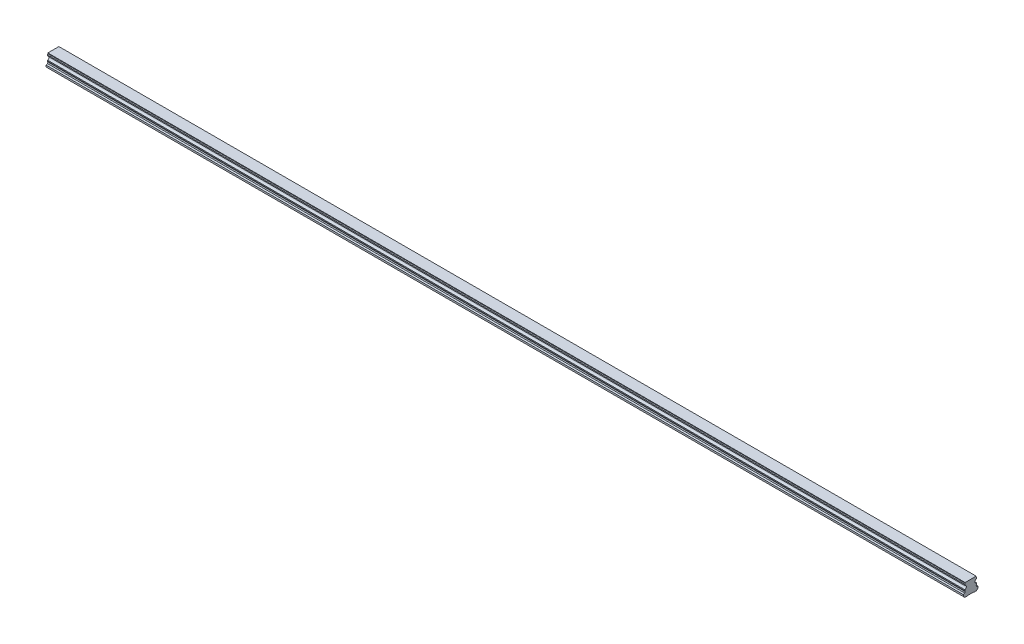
ISO-10303-21;
HEADER;
FILE_DESCRIPTION(('STEP AP214'),'2;1');
FILE_NAME('part.step','',(''),(''),'','','');
FILE_SCHEMA(('AUTOMOTIVE_DESIGN { 1 0 10303 214 1 1 1 1 }'));
ENDSEC;
DATA;
#1=APPLICATION_CONTEXT('core data for automotive mechanical design processes');
#2=APPLICATION_PROTOCOL_DEFINITION('international standard','automotive_design',2000,#1);
#3=PRODUCT_CONTEXT('',#1,'mechanical');
#4=PRODUCT('Part','Part','',(#3));
#5=PRODUCT_RELATED_PRODUCT_CATEGORY('part','',(#4));
#6=PRODUCT_DEFINITION_FORMATION('','',#4);
#7=PRODUCT_DEFINITION_CONTEXT('part definition',#1,'design');
#8=PRODUCT_DEFINITION('design','',#6,#7);
#9=PRODUCT_DEFINITION_SHAPE('','',#8);
#10=(LENGTH_UNIT() NAMED_UNIT(*) SI_UNIT(.MILLI.,.METRE.));
#11=(NAMED_UNIT(*) PLANE_ANGLE_UNIT() SI_UNIT($,.RADIAN.));
#12=(NAMED_UNIT(*) SI_UNIT($,.STERADIAN.) SOLID_ANGLE_UNIT());
#13=UNCERTAINTY_MEASURE_WITH_UNIT(LENGTH_MEASURE(1.E-05),#10,'distance_accuracy_value','');
#14=(GEOMETRIC_REPRESENTATION_CONTEXT(3) GLOBAL_UNCERTAINTY_ASSIGNED_CONTEXT((#13)) GLOBAL_UNIT_ASSIGNED_CONTEXT((#10,
#11,#12)) REPRESENTATION_CONTEXT('',''));
#15=CARTESIAN_POINT('',(0.,0.,0.));
#16=DIRECTION('',(0.,0.,1.));
#17=DIRECTION('',(1.,0.,0.));
#18=AXIS2_PLACEMENT_3D('',#15,#16,#17);
#19=CARTESIAN_POINT('',(1530.,0.499999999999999,0.));
#20=DIRECTION('',(0.,-1.,0.));
#21=DIRECTION('',(0.,0.,-1.));
#22=AXIS2_PLACEMENT_3D('',#19,#20,#21);
#23=CONICAL_SURFACE('',#22,3.5,0.785398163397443);
#24=CARTESIAN_POINT('',(1530.,1.00000000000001,0.));
#25=DIRECTION('',(0.,1.,0.));
#26=DIRECTION('',(0.,0.,1.));
#27=AXIS2_PLACEMENT_3D('',#24,#25,#26);
#28=CIRCLE('',#27,3.);
#29=CARTESIAN_POINT('',(1530.,1.00000000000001,3.));
#30=VERTEX_POINT('',#29);
#31=EDGE_CURVE('E11',#30,#30,#28,.F.);
#32=ORIENTED_EDGE('',*,*,#31,.F.);
#33=EDGE_LOOP('',(#32));
#34=FACE_BOUND('',#33,.T.);
#35=CARTESIAN_POINT('',(1530.,0.499999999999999,0.));
#36=DIRECTION('',(0.,1.,0.));
#37=DIRECTION('',(0.,0.,1.));
#38=AXIS2_PLACEMENT_3D('',#35,#36,#37);
#39=CIRCLE('',#38,3.5);
#40=CARTESIAN_POINT('',(1530.,0.5,3.5));
#41=VERTEX_POINT('',#40);
#42=EDGE_CURVE('E710',#41,#41,#39,.T.);
#43=ORIENTED_EDGE('',*,*,#42,.F.);
#44=EDGE_LOOP('',(#43));
#45=FACE_BOUND('',#44,.T.);
#46=ADVANCED_FACE('F39',(#34,#45),#23,.F.);
#47=CARTESIAN_POINT('',(1530.,12.,0.));
#48=DIRECTION('',(0.,-1.,0.));
#49=DIRECTION('',(0.,0.,-1.));
#50=AXIS2_PLACEMENT_3D('',#47,#48,#49);
#51=CYLINDRICAL_SURFACE('',#50,3.);
#52=ORIENTED_EDGE('',*,*,#31,.T.);
#53=EDGE_LOOP('',(#52));
#54=FACE_BOUND('',#53,.T.);
#55=CARTESIAN_POINT('',(1530.,12.,0.));
#56=DIRECTION('',(0.,-1.,0.));
#57=DIRECTION('',(0.,0.,-1.));
#58=AXIS2_PLACEMENT_3D('',#55,#56,#57);
#59=CIRCLE('',#58,3.);
#60=CARTESIAN_POINT('',(1530.,12.,-3.));
#61=VERTEX_POINT('',#60);
#62=EDGE_CURVE('E49',#61,#61,#59,.T.);
#63=ORIENTED_EDGE('',*,*,#62,.F.);
#64=EDGE_LOOP('',(#63));
#65=FACE_BOUND('',#64,.T.);
#66=ADVANCED_FACE('F995',(#54,#65),#51,.F.);
#67=CARTESIAN_POINT('',(1530.,12.,0.));
#68=DIRECTION('',(0.,-1.,0.));
#69=DIRECTION('',(0.,0.,-1.));
#70=AXIS2_PLACEMENT_3D('',#67,#68,#69);
#71=PLANE('',#70);
#72=CARTESIAN_POINT('',(1530.,12.,0.));
#73=DIRECTION('',(0.,-1.,0.));
#74=DIRECTION('',(0.,0.,-1.));
#75=AXIS2_PLACEMENT_3D('',#72,#73,#74);
#76=CIRCLE('',#75,2.5);
#77=CARTESIAN_POINT('',(1530.,12.,-2.5));
#78=VERTEX_POINT('',#77);
#79=EDGE_CURVE('E42',#78,#78,#76,.T.);
#80=ORIENTED_EDGE('',*,*,#79,.F.);
#81=EDGE_LOOP('',(#80));
#82=FACE_BOUND('',#81,.T.);
#83=ORIENTED_EDGE('',*,*,#62,.T.);
#84=EDGE_LOOP('',(#83));
#85=FACE_BOUND('',#84,.T.);
#86=ADVANCED_FACE('F1000',(#82,#85),#71,.T.);
#87=CARTESIAN_POINT('',(1470.,0.499999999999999,0.));
#88=DIRECTION('',(0.,-1.,0.));
#89=DIRECTION('',(0.,0.,-1.));
#90=AXIS2_PLACEMENT_3D('',#87,#88,#89);
#91=CONICAL_SURFACE('',#90,3.5,0.785398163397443);
#92=CARTESIAN_POINT('',(1470.,1.00000000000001,0.));
#93=DIRECTION('',(0.,1.,0.));
#94=DIRECTION('',(0.,0.,1.));
#95=AXIS2_PLACEMENT_3D('',#92,#93,#94);
#96=CIRCLE('',#95,3.);
#97=CARTESIAN_POINT('',(1470.,1.00000000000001,3.));
#98=VERTEX_POINT('',#97);
#99=EDGE_CURVE('E706',#98,#98,#96,.F.);
#100=ORIENTED_EDGE('',*,*,#99,.F.);
#101=EDGE_LOOP('',(#100));
#102=FACE_BOUND('',#101,.T.);
#103=CARTESIAN_POINT('',(1470.,0.499999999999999,0.));
#104=DIRECTION('',(0.,1.,0.));
#105=DIRECTION('',(0.,0.,1.));
#106=AXIS2_PLACEMENT_3D('',#103,#104,#105);
#107=CIRCLE('',#106,3.5);
#108=CARTESIAN_POINT('',(1470.,0.5,3.5));
#109=VERTEX_POINT('',#108);
#110=EDGE_CURVE('E698',#109,#109,#107,.T.);
#111=ORIENTED_EDGE('',*,*,#110,.F.);
#112=EDGE_LOOP('',(#111));
#113=FACE_BOUND('',#112,.T.);
#114=ADVANCED_FACE('F1351',(#102,#113),#91,.F.);
#115=CARTESIAN_POINT('',(1470.,12.,0.));
#116=DIRECTION('',(0.,-1.,0.));
#117=DIRECTION('',(0.,0.,-1.));
#118=AXIS2_PLACEMENT_3D('',#115,#116,#117);
#119=CYLINDRICAL_SURFACE('',#118,3.);
#120=ORIENTED_EDGE('',*,*,#99,.T.);
#121=EDGE_LOOP('',(#120));
#122=FACE_BOUND('',#121,.T.);
#123=CARTESIAN_POINT('',(1470.,12.,0.));
#124=DIRECTION('',(0.,-1.,0.));
#125=DIRECTION('',(0.,0.,-1.));
#126=AXIS2_PLACEMENT_3D('',#123,#124,#125);
#127=CIRCLE('',#126,3.);
#128=CARTESIAN_POINT('',(1470.,12.,-3.));
#129=VERTEX_POINT('',#128);
#130=EDGE_CURVE('E702',#129,#129,#127,.T.);
#131=ORIENTED_EDGE('',*,*,#130,.F.);
#132=EDGE_LOOP('',(#131));
#133=FACE_BOUND('',#132,.T.);
#134=ADVANCED_FACE('F1347',(#122,#133),#119,.F.);
#135=CARTESIAN_POINT('',(1470.,12.,0.));
#136=DIRECTION('',(0.,-1.,0.));
#137=DIRECTION('',(0.,0.,-1.));
#138=AXIS2_PLACEMENT_3D('',#135,#136,#137);
#139=PLANE('',#138);
#140=CARTESIAN_POINT('',(1470.,12.,0.));
#141=DIRECTION('',(0.,-1.,0.));
#142=DIRECTION('',(0.,0.,-1.));
#143=AXIS2_PLACEMENT_3D('',#140,#141,#142);
#144=CIRCLE('',#143,2.5);
#145=CARTESIAN_POINT('',(1470.,12.,-2.5));
#146=VERTEX_POINT('',#145);
#147=EDGE_CURVE('E809',#146,#146,#144,.T.);
#148=ORIENTED_EDGE('',*,*,#147,.F.);
#149=EDGE_LOOP('',(#148));
#150=FACE_BOUND('',#149,.T.);
#151=ORIENTED_EDGE('',*,*,#130,.T.);
#152=EDGE_LOOP('',(#151));
#153=FACE_BOUND('',#152,.T.);
#154=ADVANCED_FACE('F1343',(#150,#153),#139,.T.);
#155=CARTESIAN_POINT('',(1410.,0.499999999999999,0.));
#156=DIRECTION('',(0.,-1.,0.));
#157=DIRECTION('',(0.,0.,-1.));
#158=AXIS2_PLACEMENT_3D('',#155,#156,#157);
#159=CONICAL_SURFACE('',#158,3.5,0.785398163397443);
#160=CARTESIAN_POINT('',(1410.,1.00000000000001,0.));
#161=DIRECTION('',(0.,1.,0.));
#162=DIRECTION('',(0.,0.,1.));
#163=AXIS2_PLACEMENT_3D('',#160,#161,#162);
#164=CIRCLE('',#163,3.);
#165=CARTESIAN_POINT('',(1410.,1.00000000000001,3.));
#166=VERTEX_POINT('',#165);
#167=EDGE_CURVE('E694',#166,#166,#164,.F.);
#168=ORIENTED_EDGE('',*,*,#167,.F.);
#169=EDGE_LOOP('',(#168));
#170=FACE_BOUND('',#169,.T.);
#171=CARTESIAN_POINT('',(1410.,0.499999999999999,0.));
#172=DIRECTION('',(0.,1.,0.));
#173=DIRECTION('',(0.,0.,1.));
#174=AXIS2_PLACEMENT_3D('',#171,#172,#173);
#175=CIRCLE('',#174,3.5);
#176=CARTESIAN_POINT('',(1410.,0.5,3.5));
#177=VERTEX_POINT('',#176);
#178=EDGE_CURVE('E686',#177,#177,#175,.T.);
#179=ORIENTED_EDGE('',*,*,#178,.F.);
#180=EDGE_LOOP('',(#179));
#181=FACE_BOUND('',#180,.T.);
#182=ADVANCED_FACE('F1339',(#170,#181),#159,.F.);
#183=CARTESIAN_POINT('',(1410.,12.,0.));
#184=DIRECTION('',(0.,-1.,0.));
#185=DIRECTION('',(0.,0.,-1.));
#186=AXIS2_PLACEMENT_3D('',#183,#184,#185);
#187=CYLINDRICAL_SURFACE('',#186,3.);
#188=ORIENTED_EDGE('',*,*,#167,.T.);
#189=EDGE_LOOP('',(#188));
#190=FACE_BOUND('',#189,.T.);
#191=CARTESIAN_POINT('',(1410.,12.,0.));
#192=DIRECTION('',(0.,-1.,0.));
#193=DIRECTION('',(0.,0.,-1.));
#194=AXIS2_PLACEMENT_3D('',#191,#192,#193);
#195=CIRCLE('',#194,3.);
#196=CARTESIAN_POINT('',(1410.,12.,-3.));
#197=VERTEX_POINT('',#196);
#198=EDGE_CURVE('E690',#197,#197,#195,.T.);
#199=ORIENTED_EDGE('',*,*,#198,.F.);
#200=EDGE_LOOP('',(#199));
#201=FACE_BOUND('',#200,.T.);
#202=ADVANCED_FACE('F1335',(#190,#201),#187,.F.);
#203=CARTESIAN_POINT('',(1410.,12.,0.));
#204=DIRECTION('',(0.,-1.,0.));
#205=DIRECTION('',(0.,0.,-1.));
#206=AXIS2_PLACEMENT_3D('',#203,#204,#205);
#207=PLANE('',#206);
#208=CARTESIAN_POINT('',(1410.,12.,0.));
#209=DIRECTION('',(0.,-1.,0.));
#210=DIRECTION('',(0.,0.,-1.));
#211=AXIS2_PLACEMENT_3D('',#208,#209,#210);
#212=CIRCLE('',#211,2.5);
#213=CARTESIAN_POINT('',(1410.,12.,-2.5));
#214=VERTEX_POINT('',#213);
#215=EDGE_CURVE('E806',#214,#214,#212,.T.);
#216=ORIENTED_EDGE('',*,*,#215,.F.);
#217=EDGE_LOOP('',(#216));
#218=FACE_BOUND('',#217,.T.);
#219=ORIENTED_EDGE('',*,*,#198,.T.);
#220=EDGE_LOOP('',(#219));
#221=FACE_BOUND('',#220,.T.);
#222=ADVANCED_FACE('F1331',(#218,#221),#207,.T.);
#223=CARTESIAN_POINT('',(1350.,0.499999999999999,0.));
#224=DIRECTION('',(0.,-1.,0.));
#225=DIRECTION('',(0.,0.,-1.));
#226=AXIS2_PLACEMENT_3D('',#223,#224,#225);
#227=CONICAL_SURFACE('',#226,3.5,0.785398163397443);
#228=CARTESIAN_POINT('',(1350.,1.00000000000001,0.));
#229=DIRECTION('',(0.,1.,0.));
#230=DIRECTION('',(0.,0.,1.));
#231=AXIS2_PLACEMENT_3D('',#228,#229,#230);
#232=CIRCLE('',#231,3.);
#233=CARTESIAN_POINT('',(1350.,1.00000000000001,3.));
#234=VERTEX_POINT('',#233);
#235=EDGE_CURVE('E682',#234,#234,#232,.F.);
#236=ORIENTED_EDGE('',*,*,#235,.F.);
#237=EDGE_LOOP('',(#236));
#238=FACE_BOUND('',#237,.T.);
#239=CARTESIAN_POINT('',(1350.,0.499999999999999,0.));
#240=DIRECTION('',(0.,1.,0.));
#241=DIRECTION('',(0.,0.,1.));
#242=AXIS2_PLACEMENT_3D('',#239,#240,#241);
#243=CIRCLE('',#242,3.5);
#244=CARTESIAN_POINT('',(1350.,0.5,3.5));
#245=VERTEX_POINT('',#244);
#246=EDGE_CURVE('E674',#245,#245,#243,.T.);
#247=ORIENTED_EDGE('',*,*,#246,.F.);
#248=EDGE_LOOP('',(#247));
#249=FACE_BOUND('',#248,.T.);
#250=ADVANCED_FACE('F1327',(#238,#249),#227,.F.);
#251=CARTESIAN_POINT('',(1350.,12.,0.));
#252=DIRECTION('',(0.,-1.,0.));
#253=DIRECTION('',(0.,0.,-1.));
#254=AXIS2_PLACEMENT_3D('',#251,#252,#253);
#255=CYLINDRICAL_SURFACE('',#254,3.);
#256=ORIENTED_EDGE('',*,*,#235,.T.);
#257=EDGE_LOOP('',(#256));
#258=FACE_BOUND('',#257,.T.);
#259=CARTESIAN_POINT('',(1350.,12.,0.));
#260=DIRECTION('',(0.,-1.,0.));
#261=DIRECTION('',(0.,0.,-1.));
#262=AXIS2_PLACEMENT_3D('',#259,#260,#261);
#263=CIRCLE('',#262,3.);
#264=CARTESIAN_POINT('',(1350.,12.,-3.));
#265=VERTEX_POINT('',#264);
#266=EDGE_CURVE('E678',#265,#265,#263,.T.);
#267=ORIENTED_EDGE('',*,*,#266,.F.);
#268=EDGE_LOOP('',(#267));
#269=FACE_BOUND('',#268,.T.);
#270=ADVANCED_FACE('F1323',(#258,#269),#255,.F.);
#271=CARTESIAN_POINT('',(1350.,12.,0.));
#272=DIRECTION('',(0.,-1.,0.));
#273=DIRECTION('',(0.,0.,-1.));
#274=AXIS2_PLACEMENT_3D('',#271,#272,#273);
#275=PLANE('',#274);
#276=CARTESIAN_POINT('',(1350.,12.,0.));
#277=DIRECTION('',(0.,-1.,0.));
#278=DIRECTION('',(0.,0.,-1.));
#279=AXIS2_PLACEMENT_3D('',#276,#277,#278);
#280=CIRCLE('',#279,2.5);
#281=CARTESIAN_POINT('',(1350.,12.,-2.5));
#282=VERTEX_POINT('',#281);
#283=EDGE_CURVE('E802',#282,#282,#280,.T.);
#284=ORIENTED_EDGE('',*,*,#283,.F.);
#285=EDGE_LOOP('',(#284));
#286=FACE_BOUND('',#285,.T.);
#287=ORIENTED_EDGE('',*,*,#266,.T.);
#288=EDGE_LOOP('',(#287));
#289=FACE_BOUND('',#288,.T.);
#290=ADVANCED_FACE('F1319',(#286,#289),#275,.T.);
#291=CARTESIAN_POINT('',(1290.,0.499999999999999,0.));
#292=DIRECTION('',(0.,-1.,0.));
#293=DIRECTION('',(0.,0.,-1.));
#294=AXIS2_PLACEMENT_3D('',#291,#292,#293);
#295=CONICAL_SURFACE('',#294,3.5,0.785398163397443);
#296=CARTESIAN_POINT('',(1290.,1.00000000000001,0.));
#297=DIRECTION('',(0.,1.,0.));
#298=DIRECTION('',(0.,0.,1.));
#299=AXIS2_PLACEMENT_3D('',#296,#297,#298);
#300=CIRCLE('',#299,3.);
#301=CARTESIAN_POINT('',(1290.,1.00000000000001,3.));
#302=VERTEX_POINT('',#301);
#303=EDGE_CURVE('E670',#302,#302,#300,.F.);
#304=ORIENTED_EDGE('',*,*,#303,.F.);
#305=EDGE_LOOP('',(#304));
#306=FACE_BOUND('',#305,.T.);
#307=CARTESIAN_POINT('',(1290.,0.499999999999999,0.));
#308=DIRECTION('',(0.,1.,0.));
#309=DIRECTION('',(0.,0.,1.));
#310=AXIS2_PLACEMENT_3D('',#307,#308,#309);
#311=CIRCLE('',#310,3.5);
#312=CARTESIAN_POINT('',(1290.,0.5,3.5));
#313=VERTEX_POINT('',#312);
#314=EDGE_CURVE('E662',#313,#313,#311,.T.);
#315=ORIENTED_EDGE('',*,*,#314,.F.);
#316=EDGE_LOOP('',(#315));
#317=FACE_BOUND('',#316,.T.);
#318=ADVANCED_FACE('F1315',(#306,#317),#295,.F.);
#319=CARTESIAN_POINT('',(1290.,12.,0.));
#320=DIRECTION('',(0.,-1.,0.));
#321=DIRECTION('',(0.,0.,-1.));
#322=AXIS2_PLACEMENT_3D('',#319,#320,#321);
#323=CYLINDRICAL_SURFACE('',#322,3.);
#324=ORIENTED_EDGE('',*,*,#303,.T.);
#325=EDGE_LOOP('',(#324));
#326=FACE_BOUND('',#325,.T.);
#327=CARTESIAN_POINT('',(1290.,12.,0.));
#328=DIRECTION('',(0.,-1.,0.));
#329=DIRECTION('',(0.,0.,-1.));
#330=AXIS2_PLACEMENT_3D('',#327,#328,#329);
#331=CIRCLE('',#330,3.);
#332=CARTESIAN_POINT('',(1290.,12.,-3.));
#333=VERTEX_POINT('',#332);
#334=EDGE_CURVE('E666',#333,#333,#331,.T.);
#335=ORIENTED_EDGE('',*,*,#334,.F.);
#336=EDGE_LOOP('',(#335));
#337=FACE_BOUND('',#336,.T.);
#338=ADVANCED_FACE('F1311',(#326,#337),#323,.F.);
#339=CARTESIAN_POINT('',(1290.,12.,0.));
#340=DIRECTION('',(0.,-1.,0.));
#341=DIRECTION('',(0.,0.,-1.));
#342=AXIS2_PLACEMENT_3D('',#339,#340,#341);
#343=PLANE('',#342);
#344=CARTESIAN_POINT('',(1290.,12.,0.));
#345=DIRECTION('',(0.,-1.,0.));
#346=DIRECTION('',(0.,0.,-1.));
#347=AXIS2_PLACEMENT_3D('',#344,#345,#346);
#348=CIRCLE('',#347,2.5);
#349=CARTESIAN_POINT('',(1290.,12.,-2.5));
#350=VERTEX_POINT('',#349);
#351=EDGE_CURVE('E798',#350,#350,#348,.T.);
#352=ORIENTED_EDGE('',*,*,#351,.F.);
#353=EDGE_LOOP('',(#352));
#354=FACE_BOUND('',#353,.T.);
#355=ORIENTED_EDGE('',*,*,#334,.T.);
#356=EDGE_LOOP('',(#355));
#357=FACE_BOUND('',#356,.T.);
#358=ADVANCED_FACE('F1307',(#354,#357),#343,.T.);
#359=CARTESIAN_POINT('',(1230.,0.499999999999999,0.));
#360=DIRECTION('',(0.,-1.,0.));
#361=DIRECTION('',(0.,0.,-1.));
#362=AXIS2_PLACEMENT_3D('',#359,#360,#361);
#363=CONICAL_SURFACE('',#362,3.5,0.785398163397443);
#364=CARTESIAN_POINT('',(1230.,1.00000000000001,0.));
#365=DIRECTION('',(0.,1.,0.));
#366=DIRECTION('',(0.,0.,1.));
#367=AXIS2_PLACEMENT_3D('',#364,#365,#366);
#368=CIRCLE('',#367,3.);
#369=CARTESIAN_POINT('',(1230.,1.00000000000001,3.));
#370=VERTEX_POINT('',#369);
#371=EDGE_CURVE('E658',#370,#370,#368,.F.);
#372=ORIENTED_EDGE('',*,*,#371,.F.);
#373=EDGE_LOOP('',(#372));
#374=FACE_BOUND('',#373,.T.);
#375=CARTESIAN_POINT('',(1230.,0.499999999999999,0.));
#376=DIRECTION('',(0.,1.,0.));
#377=DIRECTION('',(0.,0.,1.));
#378=AXIS2_PLACEMENT_3D('',#375,#376,#377);
#379=CIRCLE('',#378,3.5);
#380=CARTESIAN_POINT('',(1230.,0.5,3.5));
#381=VERTEX_POINT('',#380);
#382=EDGE_CURVE('E650',#381,#381,#379,.T.);
#383=ORIENTED_EDGE('',*,*,#382,.F.);
#384=EDGE_LOOP('',(#383));
#385=FACE_BOUND('',#384,.T.);
#386=ADVANCED_FACE('F1303',(#374,#385),#363,.F.);
#387=CARTESIAN_POINT('',(1230.,12.,0.));
#388=DIRECTION('',(0.,-1.,0.));
#389=DIRECTION('',(0.,0.,-1.));
#390=AXIS2_PLACEMENT_3D('',#387,#388,#389);
#391=CYLINDRICAL_SURFACE('',#390,3.);
#392=ORIENTED_EDGE('',*,*,#371,.T.);
#393=EDGE_LOOP('',(#392));
#394=FACE_BOUND('',#393,.T.);
#395=CARTESIAN_POINT('',(1230.,12.,0.));
#396=DIRECTION('',(0.,-1.,0.));
#397=DIRECTION('',(0.,0.,-1.));
#398=AXIS2_PLACEMENT_3D('',#395,#396,#397);
#399=CIRCLE('',#398,3.);
#400=CARTESIAN_POINT('',(1230.,12.,-3.));
#401=VERTEX_POINT('',#400);
#402=EDGE_CURVE('E654',#401,#401,#399,.T.);
#403=ORIENTED_EDGE('',*,*,#402,.F.);
#404=EDGE_LOOP('',(#403));
#405=FACE_BOUND('',#404,.T.);
#406=ADVANCED_FACE('F1299',(#394,#405),#391,.F.);
#407=CARTESIAN_POINT('',(1230.,12.,0.));
#408=DIRECTION('',(0.,-1.,0.));
#409=DIRECTION('',(0.,0.,-1.));
#410=AXIS2_PLACEMENT_3D('',#407,#408,#409);
#411=PLANE('',#410);
#412=CARTESIAN_POINT('',(1230.,12.,0.));
#413=DIRECTION('',(0.,-1.,0.));
#414=DIRECTION('',(0.,0.,-1.));
#415=AXIS2_PLACEMENT_3D('',#412,#413,#414);
#416=CIRCLE('',#415,2.5);
#417=CARTESIAN_POINT('',(1230.,12.,-2.5));
#418=VERTEX_POINT('',#417);
#419=EDGE_CURVE('E794',#418,#418,#416,.T.);
#420=ORIENTED_EDGE('',*,*,#419,.F.);
#421=EDGE_LOOP('',(#420));
#422=FACE_BOUND('',#421,.T.);
#423=ORIENTED_EDGE('',*,*,#402,.T.);
#424=EDGE_LOOP('',(#423));
#425=FACE_BOUND('',#424,.T.);
#426=ADVANCED_FACE('F1295',(#422,#425),#411,.T.);
#427=CARTESIAN_POINT('',(1170.,0.499999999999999,0.));
#428=DIRECTION('',(0.,-1.,0.));
#429=DIRECTION('',(0.,0.,-1.));
#430=AXIS2_PLACEMENT_3D('',#427,#428,#429);
#431=CONICAL_SURFACE('',#430,3.5,0.785398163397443);
#432=CARTESIAN_POINT('',(1170.,1.00000000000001,0.));
#433=DIRECTION('',(0.,1.,0.));
#434=DIRECTION('',(0.,0.,1.));
#435=AXIS2_PLACEMENT_3D('',#432,#433,#434);
#436=CIRCLE('',#435,3.);
#437=CARTESIAN_POINT('',(1170.,1.00000000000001,3.));
#438=VERTEX_POINT('',#437);
#439=EDGE_CURVE('E646',#438,#438,#436,.F.);
#440=ORIENTED_EDGE('',*,*,#439,.F.);
#441=EDGE_LOOP('',(#440));
#442=FACE_BOUND('',#441,.T.);
#443=CARTESIAN_POINT('',(1170.,0.499999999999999,0.));
#444=DIRECTION('',(0.,1.,0.));
#445=DIRECTION('',(0.,0.,1.));
#446=AXIS2_PLACEMENT_3D('',#443,#444,#445);
#447=CIRCLE('',#446,3.5);
#448=CARTESIAN_POINT('',(1170.,0.5,3.5));
#449=VERTEX_POINT('',#448);
#450=EDGE_CURVE('E638',#449,#449,#447,.T.);
#451=ORIENTED_EDGE('',*,*,#450,.F.);
#452=EDGE_LOOP('',(#451));
#453=FACE_BOUND('',#452,.T.);
#454=ADVANCED_FACE('F1291',(#442,#453),#431,.F.);
#455=CARTESIAN_POINT('',(1170.,12.,0.));
#456=DIRECTION('',(0.,-1.,0.));
#457=DIRECTION('',(0.,0.,-1.));
#458=AXIS2_PLACEMENT_3D('',#455,#456,#457);
#459=CYLINDRICAL_SURFACE('',#458,3.);
#460=ORIENTED_EDGE('',*,*,#439,.T.);
#461=EDGE_LOOP('',(#460));
#462=FACE_BOUND('',#461,.T.);
#463=CARTESIAN_POINT('',(1170.,12.,0.));
#464=DIRECTION('',(0.,-1.,0.));
#465=DIRECTION('',(0.,0.,-1.));
#466=AXIS2_PLACEMENT_3D('',#463,#464,#465);
#467=CIRCLE('',#466,3.);
#468=CARTESIAN_POINT('',(1170.,12.,-3.));
#469=VERTEX_POINT('',#468);
#470=EDGE_CURVE('E642',#469,#469,#467,.T.);
#471=ORIENTED_EDGE('',*,*,#470,.F.);
#472=EDGE_LOOP('',(#471));
#473=FACE_BOUND('',#472,.T.);
#474=ADVANCED_FACE('F1287',(#462,#473),#459,.F.);
#475=CARTESIAN_POINT('',(1170.,12.,0.));
#476=DIRECTION('',(0.,-1.,0.));
#477=DIRECTION('',(0.,0.,-1.));
#478=AXIS2_PLACEMENT_3D('',#475,#476,#477);
#479=PLANE('',#478);
#480=CARTESIAN_POINT('',(1170.,12.,0.));
#481=DIRECTION('',(0.,-1.,0.));
#482=DIRECTION('',(0.,0.,-1.));
#483=AXIS2_PLACEMENT_3D('',#480,#481,#482);
#484=CIRCLE('',#483,2.5);
#485=CARTESIAN_POINT('',(1170.,12.,-2.5));
#486=VERTEX_POINT('',#485);
#487=EDGE_CURVE('E790',#486,#486,#484,.T.);
#488=ORIENTED_EDGE('',*,*,#487,.F.);
#489=EDGE_LOOP('',(#488));
#490=FACE_BOUND('',#489,.T.);
#491=ORIENTED_EDGE('',*,*,#470,.T.);
#492=EDGE_LOOP('',(#491));
#493=FACE_BOUND('',#492,.T.);
#494=ADVANCED_FACE('F1283',(#490,#493),#479,.T.);
#495=CARTESIAN_POINT('',(1110.,0.499999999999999,0.));
#496=DIRECTION('',(0.,-1.,0.));
#497=DIRECTION('',(0.,0.,-1.));
#498=AXIS2_PLACEMENT_3D('',#495,#496,#497);
#499=CONICAL_SURFACE('',#498,3.5,0.785398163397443);
#500=CARTESIAN_POINT('',(1110.,1.00000000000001,0.));
#501=DIRECTION('',(0.,1.,0.));
#502=DIRECTION('',(0.,0.,1.));
#503=AXIS2_PLACEMENT_3D('',#500,#501,#502);
#504=CIRCLE('',#503,3.);
#505=CARTESIAN_POINT('',(1110.,1.00000000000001,3.));
#506=VERTEX_POINT('',#505);
#507=EDGE_CURVE('E634',#506,#506,#504,.F.);
#508=ORIENTED_EDGE('',*,*,#507,.F.);
#509=EDGE_LOOP('',(#508));
#510=FACE_BOUND('',#509,.T.);
#511=CARTESIAN_POINT('',(1110.,0.499999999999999,0.));
#512=DIRECTION('',(0.,1.,0.));
#513=DIRECTION('',(0.,0.,1.));
#514=AXIS2_PLACEMENT_3D('',#511,#512,#513);
#515=CIRCLE('',#514,3.5);
#516=CARTESIAN_POINT('',(1110.,0.5,3.5));
#517=VERTEX_POINT('',#516);
#518=EDGE_CURVE('E626',#517,#517,#515,.T.);
#519=ORIENTED_EDGE('',*,*,#518,.F.);
#520=EDGE_LOOP('',(#519));
#521=FACE_BOUND('',#520,.T.);
#522=ADVANCED_FACE('F1279',(#510,#521),#499,.F.);
#523=CARTESIAN_POINT('',(1110.,12.,0.));
#524=DIRECTION('',(0.,-1.,0.));
#525=DIRECTION('',(0.,0.,-1.));
#526=AXIS2_PLACEMENT_3D('',#523,#524,#525);
#527=CYLINDRICAL_SURFACE('',#526,3.);
#528=ORIENTED_EDGE('',*,*,#507,.T.);
#529=EDGE_LOOP('',(#528));
#530=FACE_BOUND('',#529,.T.);
#531=CARTESIAN_POINT('',(1110.,12.,0.));
#532=DIRECTION('',(0.,-1.,0.));
#533=DIRECTION('',(0.,0.,-1.));
#534=AXIS2_PLACEMENT_3D('',#531,#532,#533);
#535=CIRCLE('',#534,3.);
#536=CARTESIAN_POINT('',(1110.,12.,-3.));
#537=VERTEX_POINT('',#536);
#538=EDGE_CURVE('E630',#537,#537,#535,.T.);
#539=ORIENTED_EDGE('',*,*,#538,.F.);
#540=EDGE_LOOP('',(#539));
#541=FACE_BOUND('',#540,.T.);
#542=ADVANCED_FACE('F1275',(#530,#541),#527,.F.);
#543=CARTESIAN_POINT('',(1110.,12.,0.));
#544=DIRECTION('',(0.,-1.,0.));
#545=DIRECTION('',(0.,0.,-1.));
#546=AXIS2_PLACEMENT_3D('',#543,#544,#545);
#547=PLANE('',#546);
#548=CARTESIAN_POINT('',(1110.,12.,0.));
#549=DIRECTION('',(0.,-1.,0.));
#550=DIRECTION('',(0.,0.,-1.));
#551=AXIS2_PLACEMENT_3D('',#548,#549,#550);
#552=CIRCLE('',#551,2.5);
#553=CARTESIAN_POINT('',(1110.,12.,-2.5));
#554=VERTEX_POINT('',#553);
#555=EDGE_CURVE('E786',#554,#554,#552,.T.);
#556=ORIENTED_EDGE('',*,*,#555,.F.);
#557=EDGE_LOOP('',(#556));
#558=FACE_BOUND('',#557,.T.);
#559=ORIENTED_EDGE('',*,*,#538,.T.);
#560=EDGE_LOOP('',(#559));
#561=FACE_BOUND('',#560,.T.);
#562=ADVANCED_FACE('F1271',(#558,#561),#547,.T.);
#563=CARTESIAN_POINT('',(1050.,0.499999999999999,0.));
#564=DIRECTION('',(0.,-1.,0.));
#565=DIRECTION('',(0.,0.,-1.));
#566=AXIS2_PLACEMENT_3D('',#563,#564,#565);
#567=CONICAL_SURFACE('',#566,3.5,0.785398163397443);
#568=CARTESIAN_POINT('',(1050.,1.00000000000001,0.));
#569=DIRECTION('',(0.,1.,0.));
#570=DIRECTION('',(0.,0.,1.));
#571=AXIS2_PLACEMENT_3D('',#568,#569,#570);
#572=CIRCLE('',#571,3.);
#573=CARTESIAN_POINT('',(1050.,1.00000000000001,3.));
#574=VERTEX_POINT('',#573);
#575=EDGE_CURVE('E622',#574,#574,#572,.F.);
#576=ORIENTED_EDGE('',*,*,#575,.F.);
#577=EDGE_LOOP('',(#576));
#578=FACE_BOUND('',#577,.T.);
#579=CARTESIAN_POINT('',(1050.,0.499999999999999,0.));
#580=DIRECTION('',(0.,1.,0.));
#581=DIRECTION('',(0.,0.,1.));
#582=AXIS2_PLACEMENT_3D('',#579,#580,#581);
#583=CIRCLE('',#582,3.5);
#584=CARTESIAN_POINT('',(1050.,0.5,3.5));
#585=VERTEX_POINT('',#584);
#586=EDGE_CURVE('E614',#585,#585,#583,.T.);
#587=ORIENTED_EDGE('',*,*,#586,.F.);
#588=EDGE_LOOP('',(#587));
#589=FACE_BOUND('',#588,.T.);
#590=ADVANCED_FACE('F1267',(#578,#589),#567,.F.);
#591=CARTESIAN_POINT('',(1050.,12.,0.));
#592=DIRECTION('',(0.,-1.,0.));
#593=DIRECTION('',(0.,0.,-1.));
#594=AXIS2_PLACEMENT_3D('',#591,#592,#593);
#595=CYLINDRICAL_SURFACE('',#594,3.);
#596=ORIENTED_EDGE('',*,*,#575,.T.);
#597=EDGE_LOOP('',(#596));
#598=FACE_BOUND('',#597,.T.);
#599=CARTESIAN_POINT('',(1050.,12.,0.));
#600=DIRECTION('',(0.,-1.,0.));
#601=DIRECTION('',(0.,0.,-1.));
#602=AXIS2_PLACEMENT_3D('',#599,#600,#601);
#603=CIRCLE('',#602,3.);
#604=CARTESIAN_POINT('',(1050.,12.,-3.));
#605=VERTEX_POINT('',#604);
#606=EDGE_CURVE('E618',#605,#605,#603,.T.);
#607=ORIENTED_EDGE('',*,*,#606,.F.);
#608=EDGE_LOOP('',(#607));
#609=FACE_BOUND('',#608,.T.);
#610=ADVANCED_FACE('F1263',(#598,#609),#595,.F.);
#611=CARTESIAN_POINT('',(1050.,12.,0.));
#612=DIRECTION('',(0.,-1.,0.));
#613=DIRECTION('',(0.,0.,-1.));
#614=AXIS2_PLACEMENT_3D('',#611,#612,#613);
#615=PLANE('',#614);
#616=CARTESIAN_POINT('',(1050.,12.,0.));
#617=DIRECTION('',(0.,-1.,0.));
#618=DIRECTION('',(0.,0.,-1.));
#619=AXIS2_PLACEMENT_3D('',#616,#617,#618);
#620=CIRCLE('',#619,2.5);
#621=CARTESIAN_POINT('',(1050.,12.,-2.5));
#622=VERTEX_POINT('',#621);
#623=EDGE_CURVE('E782',#622,#622,#620,.T.);
#624=ORIENTED_EDGE('',*,*,#623,.F.);
#625=EDGE_LOOP('',(#624));
#626=FACE_BOUND('',#625,.T.);
#627=ORIENTED_EDGE('',*,*,#606,.T.);
#628=EDGE_LOOP('',(#627));
#629=FACE_BOUND('',#628,.T.);
#630=ADVANCED_FACE('F1259',(#626,#629),#615,.T.);
#631=CARTESIAN_POINT('',(990.,0.499999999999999,0.));
#632=DIRECTION('',(0.,-1.,0.));
#633=DIRECTION('',(0.,0.,-1.));
#634=AXIS2_PLACEMENT_3D('',#631,#632,#633);
#635=CONICAL_SURFACE('',#634,3.5,0.785398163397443);
#636=CARTESIAN_POINT('',(990.,1.00000000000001,0.));
#637=DIRECTION('',(0.,1.,0.));
#638=DIRECTION('',(0.,0.,1.));
#639=AXIS2_PLACEMENT_3D('',#636,#637,#638);
#640=CIRCLE('',#639,3.);
#641=CARTESIAN_POINT('',(990.,1.00000000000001,3.));
#642=VERTEX_POINT('',#641);
#643=EDGE_CURVE('E610',#642,#642,#640,.F.);
#644=ORIENTED_EDGE('',*,*,#643,.F.);
#645=EDGE_LOOP('',(#644));
#646=FACE_BOUND('',#645,.T.);
#647=CARTESIAN_POINT('',(990.,0.499999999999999,0.));
#648=DIRECTION('',(0.,1.,0.));
#649=DIRECTION('',(0.,0.,1.));
#650=AXIS2_PLACEMENT_3D('',#647,#648,#649);
#651=CIRCLE('',#650,3.5);
#652=CARTESIAN_POINT('',(990.,0.5,3.5));
#653=VERTEX_POINT('',#652);
#654=EDGE_CURVE('E602',#653,#653,#651,.T.);
#655=ORIENTED_EDGE('',*,*,#654,.F.);
#656=EDGE_LOOP('',(#655));
#657=FACE_BOUND('',#656,.T.);
#658=ADVANCED_FACE('F1255',(#646,#657),#635,.F.);
#659=CARTESIAN_POINT('',(990.,12.,0.));
#660=DIRECTION('',(0.,-1.,0.));
#661=DIRECTION('',(0.,0.,-1.));
#662=AXIS2_PLACEMENT_3D('',#659,#660,#661);
#663=CYLINDRICAL_SURFACE('',#662,3.);
#664=ORIENTED_EDGE('',*,*,#643,.T.);
#665=EDGE_LOOP('',(#664));
#666=FACE_BOUND('',#665,.T.);
#667=CARTESIAN_POINT('',(990.,12.,0.));
#668=DIRECTION('',(0.,-1.,0.));
#669=DIRECTION('',(0.,0.,-1.));
#670=AXIS2_PLACEMENT_3D('',#667,#668,#669);
#671=CIRCLE('',#670,3.);
#672=CARTESIAN_POINT('',(990.,12.,-3.));
#673=VERTEX_POINT('',#672);
#674=EDGE_CURVE('E606',#673,#673,#671,.T.);
#675=ORIENTED_EDGE('',*,*,#674,.F.);
#676=EDGE_LOOP('',(#675));
#677=FACE_BOUND('',#676,.T.);
#678=ADVANCED_FACE('F1251',(#666,#677),#663,.F.);
#679=CARTESIAN_POINT('',(990.,12.,0.));
#680=DIRECTION('',(0.,-1.,0.));
#681=DIRECTION('',(0.,0.,-1.));
#682=AXIS2_PLACEMENT_3D('',#679,#680,#681);
#683=PLANE('',#682);
#684=CARTESIAN_POINT('',(990.,12.,0.));
#685=DIRECTION('',(0.,-1.,0.));
#686=DIRECTION('',(0.,0.,-1.));
#687=AXIS2_PLACEMENT_3D('',#684,#685,#686);
#688=CIRCLE('',#687,2.5);
#689=CARTESIAN_POINT('',(990.,12.,-2.5));
#690=VERTEX_POINT('',#689);
#691=EDGE_CURVE('E778',#690,#690,#688,.T.);
#692=ORIENTED_EDGE('',*,*,#691,.F.);
#693=EDGE_LOOP('',(#692));
#694=FACE_BOUND('',#693,.T.);
#695=ORIENTED_EDGE('',*,*,#674,.T.);
#696=EDGE_LOOP('',(#695));
#697=FACE_BOUND('',#696,.T.);
#698=ADVANCED_FACE('F1247',(#694,#697),#683,.T.);
#699=CARTESIAN_POINT('',(930.,0.499999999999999,0.));
#700=DIRECTION('',(0.,-1.,0.));
#701=DIRECTION('',(0.,0.,-1.));
#702=AXIS2_PLACEMENT_3D('',#699,#700,#701);
#703=CONICAL_SURFACE('',#702,3.5,0.785398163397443);
#704=CARTESIAN_POINT('',(930.,1.00000000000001,0.));
#705=DIRECTION('',(0.,1.,0.));
#706=DIRECTION('',(0.,0.,1.));
#707=AXIS2_PLACEMENT_3D('',#704,#705,#706);
#708=CIRCLE('',#707,3.);
#709=CARTESIAN_POINT('',(930.,1.00000000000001,3.));
#710=VERTEX_POINT('',#709);
#711=EDGE_CURVE('E598',#710,#710,#708,.F.);
#712=ORIENTED_EDGE('',*,*,#711,.F.);
#713=EDGE_LOOP('',(#712));
#714=FACE_BOUND('',#713,.T.);
#715=CARTESIAN_POINT('',(930.,0.499999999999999,0.));
#716=DIRECTION('',(0.,1.,0.));
#717=DIRECTION('',(0.,0.,1.));
#718=AXIS2_PLACEMENT_3D('',#715,#716,#717);
#719=CIRCLE('',#718,3.5);
#720=CARTESIAN_POINT('',(930.,0.5,3.5));
#721=VERTEX_POINT('',#720);
#722=EDGE_CURVE('E590',#721,#721,#719,.T.);
#723=ORIENTED_EDGE('',*,*,#722,.F.);
#724=EDGE_LOOP('',(#723));
#725=FACE_BOUND('',#724,.T.);
#726=ADVANCED_FACE('F1243',(#714,#725),#703,.F.);
#727=CARTESIAN_POINT('',(930.,12.,0.));
#728=DIRECTION('',(0.,-1.,0.));
#729=DIRECTION('',(0.,0.,-1.));
#730=AXIS2_PLACEMENT_3D('',#727,#728,#729);
#731=CYLINDRICAL_SURFACE('',#730,3.);
#732=ORIENTED_EDGE('',*,*,#711,.T.);
#733=EDGE_LOOP('',(#732));
#734=FACE_BOUND('',#733,.T.);
#735=CARTESIAN_POINT('',(930.,12.,0.));
#736=DIRECTION('',(0.,-1.,0.));
#737=DIRECTION('',(0.,0.,-1.));
#738=AXIS2_PLACEMENT_3D('',#735,#736,#737);
#739=CIRCLE('',#738,3.);
#740=CARTESIAN_POINT('',(930.,12.,-3.));
#741=VERTEX_POINT('',#740);
#742=EDGE_CURVE('E594',#741,#741,#739,.T.);
#743=ORIENTED_EDGE('',*,*,#742,.F.);
#744=EDGE_LOOP('',(#743));
#745=FACE_BOUND('',#744,.T.);
#746=ADVANCED_FACE('F1239',(#734,#745),#731,.F.);
#747=CARTESIAN_POINT('',(930.,12.,0.));
#748=DIRECTION('',(0.,-1.,0.));
#749=DIRECTION('',(0.,0.,-1.));
#750=AXIS2_PLACEMENT_3D('',#747,#748,#749);
#751=PLANE('',#750);
#752=CARTESIAN_POINT('',(930.,12.,0.));
#753=DIRECTION('',(0.,-1.,0.));
#754=DIRECTION('',(0.,0.,-1.));
#755=AXIS2_PLACEMENT_3D('',#752,#753,#754);
#756=CIRCLE('',#755,2.5);
#757=CARTESIAN_POINT('',(930.,12.,-2.5));
#758=VERTEX_POINT('',#757);
#759=EDGE_CURVE('E774',#758,#758,#756,.T.);
#760=ORIENTED_EDGE('',*,*,#759,.F.);
#761=EDGE_LOOP('',(#760));
#762=FACE_BOUND('',#761,.T.);
#763=ORIENTED_EDGE('',*,*,#742,.T.);
#764=EDGE_LOOP('',(#763));
#765=FACE_BOUND('',#764,.T.);
#766=ADVANCED_FACE('F1235',(#762,#765),#751,.T.);
#767=CARTESIAN_POINT('',(870.,0.499999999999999,0.));
#768=DIRECTION('',(0.,-1.,0.));
#769=DIRECTION('',(0.,0.,-1.));
#770=AXIS2_PLACEMENT_3D('',#767,#768,#769);
#771=CONICAL_SURFACE('',#770,3.5,0.785398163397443);
#772=CARTESIAN_POINT('',(870.,1.00000000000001,0.));
#773=DIRECTION('',(0.,1.,0.));
#774=DIRECTION('',(0.,0.,1.));
#775=AXIS2_PLACEMENT_3D('',#772,#773,#774);
#776=CIRCLE('',#775,3.);
#777=CARTESIAN_POINT('',(870.,1.00000000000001,3.));
#778=VERTEX_POINT('',#777);
#779=EDGE_CURVE('E586',#778,#778,#776,.F.);
#780=ORIENTED_EDGE('',*,*,#779,.F.);
#781=EDGE_LOOP('',(#780));
#782=FACE_BOUND('',#781,.T.);
#783=CARTESIAN_POINT('',(870.,0.499999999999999,0.));
#784=DIRECTION('',(0.,1.,0.));
#785=DIRECTION('',(0.,0.,1.));
#786=AXIS2_PLACEMENT_3D('',#783,#784,#785);
#787=CIRCLE('',#786,3.5);
#788=CARTESIAN_POINT('',(870.,0.5,3.5));
#789=VERTEX_POINT('',#788);
#790=EDGE_CURVE('E578',#789,#789,#787,.T.);
#791=ORIENTED_EDGE('',*,*,#790,.F.);
#792=EDGE_LOOP('',(#791));
#793=FACE_BOUND('',#792,.T.);
#794=ADVANCED_FACE('F1231',(#782,#793),#771,.F.);
#795=CARTESIAN_POINT('',(870.,12.,0.));
#796=DIRECTION('',(0.,-1.,0.));
#797=DIRECTION('',(0.,0.,-1.));
#798=AXIS2_PLACEMENT_3D('',#795,#796,#797);
#799=CYLINDRICAL_SURFACE('',#798,3.);
#800=ORIENTED_EDGE('',*,*,#779,.T.);
#801=EDGE_LOOP('',(#800));
#802=FACE_BOUND('',#801,.T.);
#803=CARTESIAN_POINT('',(870.,12.,0.));
#804=DIRECTION('',(0.,-1.,0.));
#805=DIRECTION('',(0.,0.,-1.));
#806=AXIS2_PLACEMENT_3D('',#803,#804,#805);
#807=CIRCLE('',#806,3.);
#808=CARTESIAN_POINT('',(870.,12.,-3.));
#809=VERTEX_POINT('',#808);
#810=EDGE_CURVE('E582',#809,#809,#807,.T.);
#811=ORIENTED_EDGE('',*,*,#810,.F.);
#812=EDGE_LOOP('',(#811));
#813=FACE_BOUND('',#812,.T.);
#814=ADVANCED_FACE('F1227',(#802,#813),#799,.F.);
#815=CARTESIAN_POINT('',(870.,12.,0.));
#816=DIRECTION('',(0.,-1.,0.));
#817=DIRECTION('',(0.,0.,-1.));
#818=AXIS2_PLACEMENT_3D('',#815,#816,#817);
#819=PLANE('',#818);
#820=CARTESIAN_POINT('',(870.,12.,0.));
#821=DIRECTION('',(0.,-1.,0.));
#822=DIRECTION('',(0.,0.,-1.));
#823=AXIS2_PLACEMENT_3D('',#820,#821,#822);
#824=CIRCLE('',#823,2.5);
#825=CARTESIAN_POINT('',(870.,12.,-2.5));
#826=VERTEX_POINT('',#825);
#827=EDGE_CURVE('E770',#826,#826,#824,.T.);
#828=ORIENTED_EDGE('',*,*,#827,.F.);
#829=EDGE_LOOP('',(#828));
#830=FACE_BOUND('',#829,.T.);
#831=ORIENTED_EDGE('',*,*,#810,.T.);
#832=EDGE_LOOP('',(#831));
#833=FACE_BOUND('',#832,.T.);
#834=ADVANCED_FACE('F1223',(#830,#833),#819,.T.);
#835=CARTESIAN_POINT('',(810.,0.499999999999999,0.));
#836=DIRECTION('',(0.,-1.,0.));
#837=DIRECTION('',(0.,0.,-1.));
#838=AXIS2_PLACEMENT_3D('',#835,#836,#837);
#839=CONICAL_SURFACE('',#838,3.5,0.785398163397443);
#840=CARTESIAN_POINT('',(810.,1.00000000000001,0.));
#841=DIRECTION('',(0.,1.,0.));
#842=DIRECTION('',(0.,0.,1.));
#843=AXIS2_PLACEMENT_3D('',#840,#841,#842);
#844=CIRCLE('',#843,3.);
#845=CARTESIAN_POINT('',(810.,1.00000000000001,3.));
#846=VERTEX_POINT('',#845);
#847=EDGE_CURVE('E574',#846,#846,#844,.F.);
#848=ORIENTED_EDGE('',*,*,#847,.F.);
#849=EDGE_LOOP('',(#848));
#850=FACE_BOUND('',#849,.T.);
#851=CARTESIAN_POINT('',(810.,0.499999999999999,0.));
#852=DIRECTION('',(0.,1.,0.));
#853=DIRECTION('',(0.,0.,1.));
#854=AXIS2_PLACEMENT_3D('',#851,#852,#853);
#855=CIRCLE('',#854,3.5);
#856=CARTESIAN_POINT('',(810.,0.5,3.5));
#857=VERTEX_POINT('',#856);
#858=EDGE_CURVE('E566',#857,#857,#855,.T.);
#859=ORIENTED_EDGE('',*,*,#858,.F.);
#860=EDGE_LOOP('',(#859));
#861=FACE_BOUND('',#860,.T.);
#862=ADVANCED_FACE('F1219',(#850,#861),#839,.F.);
#863=CARTESIAN_POINT('',(810.,12.,0.));
#864=DIRECTION('',(0.,-1.,0.));
#865=DIRECTION('',(0.,0.,-1.));
#866=AXIS2_PLACEMENT_3D('',#863,#864,#865);
#867=CYLINDRICAL_SURFACE('',#866,3.);
#868=ORIENTED_EDGE('',*,*,#847,.T.);
#869=EDGE_LOOP('',(#868));
#870=FACE_BOUND('',#869,.T.);
#871=CARTESIAN_POINT('',(810.,12.,0.));
#872=DIRECTION('',(0.,-1.,0.));
#873=DIRECTION('',(0.,0.,-1.));
#874=AXIS2_PLACEMENT_3D('',#871,#872,#873);
#875=CIRCLE('',#874,3.);
#876=CARTESIAN_POINT('',(810.,12.,-3.));
#877=VERTEX_POINT('',#876);
#878=EDGE_CURVE('E570',#877,#877,#875,.T.);
#879=ORIENTED_EDGE('',*,*,#878,.F.);
#880=EDGE_LOOP('',(#879));
#881=FACE_BOUND('',#880,.T.);
#882=ADVANCED_FACE('F1215',(#870,#881),#867,.F.);
#883=CARTESIAN_POINT('',(810.,12.,0.));
#884=DIRECTION('',(0.,-1.,0.));
#885=DIRECTION('',(0.,0.,-1.));
#886=AXIS2_PLACEMENT_3D('',#883,#884,#885);
#887=PLANE('',#886);
#888=CARTESIAN_POINT('',(810.,12.,0.));
#889=DIRECTION('',(0.,-1.,0.));
#890=DIRECTION('',(0.,0.,-1.));
#891=AXIS2_PLACEMENT_3D('',#888,#889,#890);
#892=CIRCLE('',#891,2.5);
#893=CARTESIAN_POINT('',(810.,12.,-2.5));
#894=VERTEX_POINT('',#893);
#895=EDGE_CURVE('E766',#894,#894,#892,.T.);
#896=ORIENTED_EDGE('',*,*,#895,.F.);
#897=EDGE_LOOP('',(#896));
#898=FACE_BOUND('',#897,.T.);
#899=ORIENTED_EDGE('',*,*,#878,.T.);
#900=EDGE_LOOP('',(#899));
#901=FACE_BOUND('',#900,.T.);
#902=ADVANCED_FACE('F1211',(#898,#901),#887,.T.);
#903=CARTESIAN_POINT('',(750.,0.499999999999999,0.));
#904=DIRECTION('',(0.,-1.,0.));
#905=DIRECTION('',(0.,0.,-1.));
#906=AXIS2_PLACEMENT_3D('',#903,#904,#905);
#907=CONICAL_SURFACE('',#906,3.5,0.785398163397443);
#908=CARTESIAN_POINT('',(750.,1.00000000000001,0.));
#909=DIRECTION('',(0.,1.,0.));
#910=DIRECTION('',(0.,0.,1.));
#911=AXIS2_PLACEMENT_3D('',#908,#909,#910);
#912=CIRCLE('',#911,3.);
#913=CARTESIAN_POINT('',(750.,1.00000000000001,3.));
#914=VERTEX_POINT('',#913);
#915=EDGE_CURVE('E562',#914,#914,#912,.F.);
#916=ORIENTED_EDGE('',*,*,#915,.F.);
#917=EDGE_LOOP('',(#916));
#918=FACE_BOUND('',#917,.T.);
#919=CARTESIAN_POINT('',(750.,0.499999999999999,0.));
#920=DIRECTION('',(0.,1.,0.));
#921=DIRECTION('',(0.,0.,1.));
#922=AXIS2_PLACEMENT_3D('',#919,#920,#921);
#923=CIRCLE('',#922,3.5);
#924=CARTESIAN_POINT('',(750.,0.5,3.5));
#925=VERTEX_POINT('',#924);
#926=EDGE_CURVE('E554',#925,#925,#923,.T.);
#927=ORIENTED_EDGE('',*,*,#926,.F.);
#928=EDGE_LOOP('',(#927));
#929=FACE_BOUND('',#928,.T.);
#930=ADVANCED_FACE('F1207',(#918,#929),#907,.F.);
#931=CARTESIAN_POINT('',(750.,12.,0.));
#932=DIRECTION('',(0.,-1.,0.));
#933=DIRECTION('',(0.,0.,-1.));
#934=AXIS2_PLACEMENT_3D('',#931,#932,#933);
#935=CYLINDRICAL_SURFACE('',#934,3.);
#936=ORIENTED_EDGE('',*,*,#915,.T.);
#937=EDGE_LOOP('',(#936));
#938=FACE_BOUND('',#937,.T.);
#939=CARTESIAN_POINT('',(750.,12.,0.));
#940=DIRECTION('',(0.,-1.,0.));
#941=DIRECTION('',(0.,0.,-1.));
#942=AXIS2_PLACEMENT_3D('',#939,#940,#941);
#943=CIRCLE('',#942,3.);
#944=CARTESIAN_POINT('',(750.,12.,-3.));
#945=VERTEX_POINT('',#944);
#946=EDGE_CURVE('E558',#945,#945,#943,.T.);
#947=ORIENTED_EDGE('',*,*,#946,.F.);
#948=EDGE_LOOP('',(#947));
#949=FACE_BOUND('',#948,.T.);
#950=ADVANCED_FACE('F1203',(#938,#949),#935,.F.);
#951=CARTESIAN_POINT('',(750.,12.,0.));
#952=DIRECTION('',(0.,-1.,0.));
#953=DIRECTION('',(0.,0.,-1.));
#954=AXIS2_PLACEMENT_3D('',#951,#952,#953);
#955=PLANE('',#954);
#956=CARTESIAN_POINT('',(750.,12.,0.));
#957=DIRECTION('',(0.,-1.,0.));
#958=DIRECTION('',(0.,0.,-1.));
#959=AXIS2_PLACEMENT_3D('',#956,#957,#958);
#960=CIRCLE('',#959,2.5);
#961=CARTESIAN_POINT('',(750.,12.,-2.5));
#962=VERTEX_POINT('',#961);
#963=EDGE_CURVE('E762',#962,#962,#960,.T.);
#964=ORIENTED_EDGE('',*,*,#963,.F.);
#965=EDGE_LOOP('',(#964));
#966=FACE_BOUND('',#965,.T.);
#967=ORIENTED_EDGE('',*,*,#946,.T.);
#968=EDGE_LOOP('',(#967));
#969=FACE_BOUND('',#968,.T.);
#970=ADVANCED_FACE('F1199',(#966,#969),#955,.T.);
#971=CARTESIAN_POINT('',(690.,0.499999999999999,0.));
#972=DIRECTION('',(0.,-1.,0.));
#973=DIRECTION('',(0.,0.,-1.));
#974=AXIS2_PLACEMENT_3D('',#971,#972,#973);
#975=CONICAL_SURFACE('',#974,3.5,0.785398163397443);
#976=CARTESIAN_POINT('',(690.,1.00000000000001,0.));
#977=DIRECTION('',(0.,1.,0.));
#978=DIRECTION('',(0.,0.,1.));
#979=AXIS2_PLACEMENT_3D('',#976,#977,#978);
#980=CIRCLE('',#979,3.);
#981=CARTESIAN_POINT('',(690.,1.00000000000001,3.));
#982=VERTEX_POINT('',#981);
#983=EDGE_CURVE('E550',#982,#982,#980,.F.);
#984=ORIENTED_EDGE('',*,*,#983,.F.);
#985=EDGE_LOOP('',(#984));
#986=FACE_BOUND('',#985,.T.);
#987=CARTESIAN_POINT('',(690.,0.499999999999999,0.));
#988=DIRECTION('',(0.,1.,0.));
#989=DIRECTION('',(0.,0.,1.));
#990=AXIS2_PLACEMENT_3D('',#987,#988,#989);
#991=CIRCLE('',#990,3.5);
#992=CARTESIAN_POINT('',(690.,0.5,3.5));
#993=VERTEX_POINT('',#992);
#994=EDGE_CURVE('E542',#993,#993,#991,.T.);
#995=ORIENTED_EDGE('',*,*,#994,.F.);
#996=EDGE_LOOP('',(#995));
#997=FACE_BOUND('',#996,.T.);
#998=ADVANCED_FACE('F1195',(#986,#997),#975,.F.);
#999=CARTESIAN_POINT('',(690.,12.,0.));
#1000=DIRECTION('',(0.,-1.,0.));
#1001=DIRECTION('',(0.,0.,-1.));
#1002=AXIS2_PLACEMENT_3D('',#999,#1000,#1001);
#1003=CYLINDRICAL_SURFACE('',#1002,3.);
#1004=ORIENTED_EDGE('',*,*,#983,.T.);
#1005=EDGE_LOOP('',(#1004));
#1006=FACE_BOUND('',#1005,.T.);
#1007=CARTESIAN_POINT('',(690.,12.,0.));
#1008=DIRECTION('',(0.,-1.,0.));
#1009=DIRECTION('',(0.,0.,-1.));
#1010=AXIS2_PLACEMENT_3D('',#1007,#1008,#1009);
#1011=CIRCLE('',#1010,3.);
#1012=CARTESIAN_POINT('',(690.,12.,-3.));
#1013=VERTEX_POINT('',#1012);
#1014=EDGE_CURVE('E546',#1013,#1013,#1011,.T.);
#1015=ORIENTED_EDGE('',*,*,#1014,.F.);
#1016=EDGE_LOOP('',(#1015));
#1017=FACE_BOUND('',#1016,.T.);
#1018=ADVANCED_FACE('F1191',(#1006,#1017),#1003,.F.);
#1019=CARTESIAN_POINT('',(690.,12.,0.));
#1020=DIRECTION('',(0.,-1.,0.));
#1021=DIRECTION('',(0.,0.,-1.));
#1022=AXIS2_PLACEMENT_3D('',#1019,#1020,#1021);
#1023=PLANE('',#1022);
#1024=CARTESIAN_POINT('',(690.,12.,0.));
#1025=DIRECTION('',(0.,-1.,0.));
#1026=DIRECTION('',(0.,0.,-1.));
#1027=AXIS2_PLACEMENT_3D('',#1024,#1025,#1026);
#1028=CIRCLE('',#1027,2.5);
#1029=CARTESIAN_POINT('',(690.,12.,-2.5));
#1030=VERTEX_POINT('',#1029);
#1031=EDGE_CURVE('E758',#1030,#1030,#1028,.T.);
#1032=ORIENTED_EDGE('',*,*,#1031,.F.);
#1033=EDGE_LOOP('',(#1032));
#1034=FACE_BOUND('',#1033,.T.);
#1035=ORIENTED_EDGE('',*,*,#1014,.T.);
#1036=EDGE_LOOP('',(#1035));
#1037=FACE_BOUND('',#1036,.T.);
#1038=ADVANCED_FACE('F1187',(#1034,#1037),#1023,.T.);
#1039=CARTESIAN_POINT('',(630.,0.499999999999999,0.));
#1040=DIRECTION('',(0.,-1.,0.));
#1041=DIRECTION('',(0.,0.,-1.));
#1042=AXIS2_PLACEMENT_3D('',#1039,#1040,#1041);
#1043=CONICAL_SURFACE('',#1042,3.5,0.785398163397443);
#1044=CARTESIAN_POINT('',(630.,1.00000000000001,0.));
#1045=DIRECTION('',(0.,1.,0.));
#1046=DIRECTION('',(0.,0.,1.));
#1047=AXIS2_PLACEMENT_3D('',#1044,#1045,#1046);
#1048=CIRCLE('',#1047,3.);
#1049=CARTESIAN_POINT('',(630.,1.00000000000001,3.));
#1050=VERTEX_POINT('',#1049);
#1051=EDGE_CURVE('E538',#1050,#1050,#1048,.F.);
#1052=ORIENTED_EDGE('',*,*,#1051,.F.);
#1053=EDGE_LOOP('',(#1052));
#1054=FACE_BOUND('',#1053,.T.);
#1055=CARTESIAN_POINT('',(630.,0.499999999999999,0.));
#1056=DIRECTION('',(0.,1.,0.));
#1057=DIRECTION('',(0.,0.,1.));
#1058=AXIS2_PLACEMENT_3D('',#1055,#1056,#1057);
#1059=CIRCLE('',#1058,3.5);
#1060=CARTESIAN_POINT('',(630.,0.5,3.5));
#1061=VERTEX_POINT('',#1060);
#1062=EDGE_CURVE('E530',#1061,#1061,#1059,.T.);
#1063=ORIENTED_EDGE('',*,*,#1062,.F.);
#1064=EDGE_LOOP('',(#1063));
#1065=FACE_BOUND('',#1064,.T.);
#1066=ADVANCED_FACE('F1183',(#1054,#1065),#1043,.F.);
#1067=CARTESIAN_POINT('',(630.,12.,0.));
#1068=DIRECTION('',(0.,-1.,0.));
#1069=DIRECTION('',(0.,0.,-1.));
#1070=AXIS2_PLACEMENT_3D('',#1067,#1068,#1069);
#1071=CYLINDRICAL_SURFACE('',#1070,3.);
#1072=ORIENTED_EDGE('',*,*,#1051,.T.);
#1073=EDGE_LOOP('',(#1072));
#1074=FACE_BOUND('',#1073,.T.);
#1075=CARTESIAN_POINT('',(630.,12.,0.));
#1076=DIRECTION('',(0.,-1.,0.));
#1077=DIRECTION('',(0.,0.,-1.));
#1078=AXIS2_PLACEMENT_3D('',#1075,#1076,#1077);
#1079=CIRCLE('',#1078,3.);
#1080=CARTESIAN_POINT('',(630.,12.,-3.));
#1081=VERTEX_POINT('',#1080);
#1082=EDGE_CURVE('E534',#1081,#1081,#1079,.T.);
#1083=ORIENTED_EDGE('',*,*,#1082,.F.);
#1084=EDGE_LOOP('',(#1083));
#1085=FACE_BOUND('',#1084,.T.);
#1086=ADVANCED_FACE('F1179',(#1074,#1085),#1071,.F.);
#1087=CARTESIAN_POINT('',(630.,12.,0.));
#1088=DIRECTION('',(0.,-1.,0.));
#1089=DIRECTION('',(0.,0.,-1.));
#1090=AXIS2_PLACEMENT_3D('',#1087,#1088,#1089);
#1091=PLANE('',#1090);
#1092=CARTESIAN_POINT('',(630.,12.,0.));
#1093=DIRECTION('',(0.,-1.,0.));
#1094=DIRECTION('',(0.,0.,-1.));
#1095=AXIS2_PLACEMENT_3D('',#1092,#1093,#1094);
#1096=CIRCLE('',#1095,2.5);
#1097=CARTESIAN_POINT('',(630.,12.,-2.5));
#1098=VERTEX_POINT('',#1097);
#1099=EDGE_CURVE('E754',#1098,#1098,#1096,.T.);
#1100=ORIENTED_EDGE('',*,*,#1099,.F.);
#1101=EDGE_LOOP('',(#1100));
#1102=FACE_BOUND('',#1101,.T.);
#1103=ORIENTED_EDGE('',*,*,#1082,.T.);
#1104=EDGE_LOOP('',(#1103));
#1105=FACE_BOUND('',#1104,.T.);
#1106=ADVANCED_FACE('F1175',(#1102,#1105),#1091,.T.);
#1107=CARTESIAN_POINT('',(570.,0.499999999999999,0.));
#1108=DIRECTION('',(0.,-1.,0.));
#1109=DIRECTION('',(0.,0.,-1.));
#1110=AXIS2_PLACEMENT_3D('',#1107,#1108,#1109);
#1111=CONICAL_SURFACE('',#1110,3.5,0.785398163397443);
#1112=CARTESIAN_POINT('',(570.,1.00000000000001,0.));
#1113=DIRECTION('',(0.,1.,0.));
#1114=DIRECTION('',(0.,0.,1.));
#1115=AXIS2_PLACEMENT_3D('',#1112,#1113,#1114);
#1116=CIRCLE('',#1115,3.);
#1117=CARTESIAN_POINT('',(570.,1.00000000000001,3.));
#1118=VERTEX_POINT('',#1117);
#1119=EDGE_CURVE('E526',#1118,#1118,#1116,.F.);
#1120=ORIENTED_EDGE('',*,*,#1119,.F.);
#1121=EDGE_LOOP('',(#1120));
#1122=FACE_BOUND('',#1121,.T.);
#1123=CARTESIAN_POINT('',(570.,0.499999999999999,0.));
#1124=DIRECTION('',(0.,1.,0.));
#1125=DIRECTION('',(0.,0.,1.));
#1126=AXIS2_PLACEMENT_3D('',#1123,#1124,#1125);
#1127=CIRCLE('',#1126,3.5);
#1128=CARTESIAN_POINT('',(570.,0.5,3.5));
#1129=VERTEX_POINT('',#1128);
#1130=EDGE_CURVE('E518',#1129,#1129,#1127,.T.);
#1131=ORIENTED_EDGE('',*,*,#1130,.F.);
#1132=EDGE_LOOP('',(#1131));
#1133=FACE_BOUND('',#1132,.T.);
#1134=ADVANCED_FACE('F1171',(#1122,#1133),#1111,.F.);
#1135=CARTESIAN_POINT('',(570.,12.,0.));
#1136=DIRECTION('',(0.,-1.,0.));
#1137=DIRECTION('',(0.,0.,-1.));
#1138=AXIS2_PLACEMENT_3D('',#1135,#1136,#1137);
#1139=CYLINDRICAL_SURFACE('',#1138,3.);
#1140=ORIENTED_EDGE('',*,*,#1119,.T.);
#1141=EDGE_LOOP('',(#1140));
#1142=FACE_BOUND('',#1141,.T.);
#1143=CARTESIAN_POINT('',(570.,12.,0.));
#1144=DIRECTION('',(0.,-1.,0.));
#1145=DIRECTION('',(0.,0.,-1.));
#1146=AXIS2_PLACEMENT_3D('',#1143,#1144,#1145);
#1147=CIRCLE('',#1146,3.);
#1148=CARTESIAN_POINT('',(570.,12.,-3.));
#1149=VERTEX_POINT('',#1148);
#1150=EDGE_CURVE('E522',#1149,#1149,#1147,.T.);
#1151=ORIENTED_EDGE('',*,*,#1150,.F.);
#1152=EDGE_LOOP('',(#1151));
#1153=FACE_BOUND('',#1152,.T.);
#1154=ADVANCED_FACE('F1167',(#1142,#1153),#1139,.F.);
#1155=CARTESIAN_POINT('',(570.,12.,0.));
#1156=DIRECTION('',(0.,-1.,0.));
#1157=DIRECTION('',(0.,0.,-1.));
#1158=AXIS2_PLACEMENT_3D('',#1155,#1156,#1157);
#1159=PLANE('',#1158);
#1160=CARTESIAN_POINT('',(570.,12.,0.));
#1161=DIRECTION('',(0.,-1.,0.));
#1162=DIRECTION('',(0.,0.,-1.));
#1163=AXIS2_PLACEMENT_3D('',#1160,#1161,#1162);
#1164=CIRCLE('',#1163,2.5);
#1165=CARTESIAN_POINT('',(570.,12.,-2.5));
#1166=VERTEX_POINT('',#1165);
#1167=EDGE_CURVE('E750',#1166,#1166,#1164,.T.);
#1168=ORIENTED_EDGE('',*,*,#1167,.F.);
#1169=EDGE_LOOP('',(#1168));
#1170=FACE_BOUND('',#1169,.T.);
#1171=ORIENTED_EDGE('',*,*,#1150,.T.);
#1172=EDGE_LOOP('',(#1171));
#1173=FACE_BOUND('',#1172,.T.);
#1174=ADVANCED_FACE('F1163',(#1170,#1173),#1159,.T.);
#1175=CARTESIAN_POINT('',(510.,0.499999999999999,0.));
#1176=DIRECTION('',(0.,-1.,0.));
#1177=DIRECTION('',(0.,0.,-1.));
#1178=AXIS2_PLACEMENT_3D('',#1175,#1176,#1177);
#1179=CONICAL_SURFACE('',#1178,3.5,0.785398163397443);
#1180=CARTESIAN_POINT('',(510.,1.00000000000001,0.));
#1181=DIRECTION('',(0.,1.,0.));
#1182=DIRECTION('',(0.,0.,1.));
#1183=AXIS2_PLACEMENT_3D('',#1180,#1181,#1182);
#1184=CIRCLE('',#1183,3.);
#1185=CARTESIAN_POINT('',(510.,1.00000000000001,3.));
#1186=VERTEX_POINT('',#1185);
#1187=EDGE_CURVE('E514',#1186,#1186,#1184,.F.);
#1188=ORIENTED_EDGE('',*,*,#1187,.F.);
#1189=EDGE_LOOP('',(#1188));
#1190=FACE_BOUND('',#1189,.T.);
#1191=CARTESIAN_POINT('',(510.,0.499999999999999,0.));
#1192=DIRECTION('',(0.,1.,0.));
#1193=DIRECTION('',(0.,0.,1.));
#1194=AXIS2_PLACEMENT_3D('',#1191,#1192,#1193);
#1195=CIRCLE('',#1194,3.5);
#1196=CARTESIAN_POINT('',(510.,0.5,3.5));
#1197=VERTEX_POINT('',#1196);
#1198=EDGE_CURVE('E506',#1197,#1197,#1195,.T.);
#1199=ORIENTED_EDGE('',*,*,#1198,.F.);
#1200=EDGE_LOOP('',(#1199));
#1201=FACE_BOUND('',#1200,.T.);
#1202=ADVANCED_FACE('F1159',(#1190,#1201),#1179,.F.);
#1203=CARTESIAN_POINT('',(510.,12.,0.));
#1204=DIRECTION('',(0.,-1.,0.));
#1205=DIRECTION('',(0.,0.,-1.));
#1206=AXIS2_PLACEMENT_3D('',#1203,#1204,#1205);
#1207=CYLINDRICAL_SURFACE('',#1206,3.);
#1208=ORIENTED_EDGE('',*,*,#1187,.T.);
#1209=EDGE_LOOP('',(#1208));
#1210=FACE_BOUND('',#1209,.T.);
#1211=CARTESIAN_POINT('',(510.,12.,0.));
#1212=DIRECTION('',(0.,-1.,0.));
#1213=DIRECTION('',(0.,0.,-1.));
#1214=AXIS2_PLACEMENT_3D('',#1211,#1212,#1213);
#1215=CIRCLE('',#1214,3.);
#1216=CARTESIAN_POINT('',(510.,12.,-3.));
#1217=VERTEX_POINT('',#1216);
#1218=EDGE_CURVE('E510',#1217,#1217,#1215,.T.);
#1219=ORIENTED_EDGE('',*,*,#1218,.F.);
#1220=EDGE_LOOP('',(#1219));
#1221=FACE_BOUND('',#1220,.T.);
#1222=ADVANCED_FACE('F1155',(#1210,#1221),#1207,.F.);
#1223=CARTESIAN_POINT('',(510.,12.,0.));
#1224=DIRECTION('',(0.,-1.,0.));
#1225=DIRECTION('',(0.,0.,-1.));
#1226=AXIS2_PLACEMENT_3D('',#1223,#1224,#1225);
#1227=PLANE('',#1226);
#1228=CARTESIAN_POINT('',(510.,12.,0.));
#1229=DIRECTION('',(0.,-1.,0.));
#1230=DIRECTION('',(0.,0.,-1.));
#1231=AXIS2_PLACEMENT_3D('',#1228,#1229,#1230);
#1232=CIRCLE('',#1231,2.5);
#1233=CARTESIAN_POINT('',(510.,12.,-2.5));
#1234=VERTEX_POINT('',#1233);
#1235=EDGE_CURVE('E746',#1234,#1234,#1232,.T.);
#1236=ORIENTED_EDGE('',*,*,#1235,.F.);
#1237=EDGE_LOOP('',(#1236));
#1238=FACE_BOUND('',#1237,.T.);
#1239=ORIENTED_EDGE('',*,*,#1218,.T.);
#1240=EDGE_LOOP('',(#1239));
#1241=FACE_BOUND('',#1240,.T.);
#1242=ADVANCED_FACE('F1151',(#1238,#1241),#1227,.T.);
#1243=CARTESIAN_POINT('',(450.,0.499999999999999,0.));
#1244=DIRECTION('',(0.,-1.,0.));
#1245=DIRECTION('',(0.,0.,-1.));
#1246=AXIS2_PLACEMENT_3D('',#1243,#1244,#1245);
#1247=CONICAL_SURFACE('',#1246,3.5,0.785398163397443);
#1248=CARTESIAN_POINT('',(450.,1.00000000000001,0.));
#1249=DIRECTION('',(0.,1.,0.));
#1250=DIRECTION('',(0.,0.,1.));
#1251=AXIS2_PLACEMENT_3D('',#1248,#1249,#1250);
#1252=CIRCLE('',#1251,3.);
#1253=CARTESIAN_POINT('',(450.,1.00000000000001,3.));
#1254=VERTEX_POINT('',#1253);
#1255=EDGE_CURVE('E502',#1254,#1254,#1252,.F.);
#1256=ORIENTED_EDGE('',*,*,#1255,.F.);
#1257=EDGE_LOOP('',(#1256));
#1258=FACE_BOUND('',#1257,.T.);
#1259=CARTESIAN_POINT('',(450.,0.499999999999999,0.));
#1260=DIRECTION('',(0.,1.,0.));
#1261=DIRECTION('',(0.,0.,1.));
#1262=AXIS2_PLACEMENT_3D('',#1259,#1260,#1261);
#1263=CIRCLE('',#1262,3.5);
#1264=CARTESIAN_POINT('',(450.,0.5,3.5));
#1265=VERTEX_POINT('',#1264);
#1266=EDGE_CURVE('E494',#1265,#1265,#1263,.T.);
#1267=ORIENTED_EDGE('',*,*,#1266,.F.);
#1268=EDGE_LOOP('',(#1267));
#1269=FACE_BOUND('',#1268,.T.);
#1270=ADVANCED_FACE('F1147',(#1258,#1269),#1247,.F.);
#1271=CARTESIAN_POINT('',(450.,12.,0.));
#1272=DIRECTION('',(0.,-1.,0.));
#1273=DIRECTION('',(0.,0.,-1.));
#1274=AXIS2_PLACEMENT_3D('',#1271,#1272,#1273);
#1275=CYLINDRICAL_SURFACE('',#1274,3.);
#1276=ORIENTED_EDGE('',*,*,#1255,.T.);
#1277=EDGE_LOOP('',(#1276));
#1278=FACE_BOUND('',#1277,.T.);
#1279=CARTESIAN_POINT('',(450.,12.,0.));
#1280=DIRECTION('',(0.,-1.,0.));
#1281=DIRECTION('',(0.,0.,-1.));
#1282=AXIS2_PLACEMENT_3D('',#1279,#1280,#1281);
#1283=CIRCLE('',#1282,3.);
#1284=CARTESIAN_POINT('',(450.,12.,-3.));
#1285=VERTEX_POINT('',#1284);
#1286=EDGE_CURVE('E498',#1285,#1285,#1283,.T.);
#1287=ORIENTED_EDGE('',*,*,#1286,.F.);
#1288=EDGE_LOOP('',(#1287));
#1289=FACE_BOUND('',#1288,.T.);
#1290=ADVANCED_FACE('F1143',(#1278,#1289),#1275,.F.);
#1291=CARTESIAN_POINT('',(450.,12.,0.));
#1292=DIRECTION('',(0.,-1.,0.));
#1293=DIRECTION('',(0.,0.,-1.));
#1294=AXIS2_PLACEMENT_3D('',#1291,#1292,#1293);
#1295=PLANE('',#1294);
#1296=CARTESIAN_POINT('',(450.,12.,0.));
#1297=DIRECTION('',(0.,-1.,0.));
#1298=DIRECTION('',(0.,0.,-1.));
#1299=AXIS2_PLACEMENT_3D('',#1296,#1297,#1298);
#1300=CIRCLE('',#1299,2.5);
#1301=CARTESIAN_POINT('',(450.,12.,-2.5));
#1302=VERTEX_POINT('',#1301);
#1303=EDGE_CURVE('E742',#1302,#1302,#1300,.T.);
#1304=ORIENTED_EDGE('',*,*,#1303,.F.);
#1305=EDGE_LOOP('',(#1304));
#1306=FACE_BOUND('',#1305,.T.);
#1307=ORIENTED_EDGE('',*,*,#1286,.T.);
#1308=EDGE_LOOP('',(#1307));
#1309=FACE_BOUND('',#1308,.T.);
#1310=ADVANCED_FACE('F1139',(#1306,#1309),#1295,.T.);
#1311=CARTESIAN_POINT('',(390.,0.499999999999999,0.));
#1312=DIRECTION('',(0.,-1.,0.));
#1313=DIRECTION('',(0.,0.,-1.));
#1314=AXIS2_PLACEMENT_3D('',#1311,#1312,#1313);
#1315=CONICAL_SURFACE('',#1314,3.5,0.785398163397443);
#1316=CARTESIAN_POINT('',(390.,1.00000000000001,0.));
#1317=DIRECTION('',(0.,1.,0.));
#1318=DIRECTION('',(0.,0.,1.));
#1319=AXIS2_PLACEMENT_3D('',#1316,#1317,#1318);
#1320=CIRCLE('',#1319,3.);
#1321=CARTESIAN_POINT('',(390.,1.00000000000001,3.));
#1322=VERTEX_POINT('',#1321);
#1323=EDGE_CURVE('E490',#1322,#1322,#1320,.F.);
#1324=ORIENTED_EDGE('',*,*,#1323,.F.);
#1325=EDGE_LOOP('',(#1324));
#1326=FACE_BOUND('',#1325,.T.);
#1327=CARTESIAN_POINT('',(390.,0.499999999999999,0.));
#1328=DIRECTION('',(0.,1.,0.));
#1329=DIRECTION('',(0.,0.,1.));
#1330=AXIS2_PLACEMENT_3D('',#1327,#1328,#1329);
#1331=CIRCLE('',#1330,3.5);
#1332=CARTESIAN_POINT('',(390.,0.5,3.5));
#1333=VERTEX_POINT('',#1332);
#1334=EDGE_CURVE('E482',#1333,#1333,#1331,.T.);
#1335=ORIENTED_EDGE('',*,*,#1334,.F.);
#1336=EDGE_LOOP('',(#1335));
#1337=FACE_BOUND('',#1336,.T.);
#1338=ADVANCED_FACE('F1135',(#1326,#1337),#1315,.F.);
#1339=CARTESIAN_POINT('',(390.,12.,0.));
#1340=DIRECTION('',(0.,-1.,0.));
#1341=DIRECTION('',(0.,0.,-1.));
#1342=AXIS2_PLACEMENT_3D('',#1339,#1340,#1341);
#1343=CYLINDRICAL_SURFACE('',#1342,3.);
#1344=ORIENTED_EDGE('',*,*,#1323,.T.);
#1345=EDGE_LOOP('',(#1344));
#1346=FACE_BOUND('',#1345,.T.);
#1347=CARTESIAN_POINT('',(390.,12.,0.));
#1348=DIRECTION('',(0.,-1.,0.));
#1349=DIRECTION('',(0.,0.,-1.));
#1350=AXIS2_PLACEMENT_3D('',#1347,#1348,#1349);
#1351=CIRCLE('',#1350,3.);
#1352=CARTESIAN_POINT('',(390.,12.,-3.));
#1353=VERTEX_POINT('',#1352);
#1354=EDGE_CURVE('E486',#1353,#1353,#1351,.T.);
#1355=ORIENTED_EDGE('',*,*,#1354,.F.);
#1356=EDGE_LOOP('',(#1355));
#1357=FACE_BOUND('',#1356,.T.);
#1358=ADVANCED_FACE('F1131',(#1346,#1357),#1343,.F.);
#1359=CARTESIAN_POINT('',(390.,12.,0.));
#1360=DIRECTION('',(0.,-1.,0.));
#1361=DIRECTION('',(0.,0.,-1.));
#1362=AXIS2_PLACEMENT_3D('',#1359,#1360,#1361);
#1363=PLANE('',#1362);
#1364=CARTESIAN_POINT('',(390.,12.,0.));
#1365=DIRECTION('',(0.,-1.,0.));
#1366=DIRECTION('',(0.,0.,-1.));
#1367=AXIS2_PLACEMENT_3D('',#1364,#1365,#1366);
#1368=CIRCLE('',#1367,2.5);
#1369=CARTESIAN_POINT('',(390.,12.,-2.5));
#1370=VERTEX_POINT('',#1369);
#1371=EDGE_CURVE('E738',#1370,#1370,#1368,.T.);
#1372=ORIENTED_EDGE('',*,*,#1371,.F.);
#1373=EDGE_LOOP('',(#1372));
#1374=FACE_BOUND('',#1373,.T.);
#1375=ORIENTED_EDGE('',*,*,#1354,.T.);
#1376=EDGE_LOOP('',(#1375));
#1377=FACE_BOUND('',#1376,.T.);
#1378=ADVANCED_FACE('F1127',(#1374,#1377),#1363,.T.);
#1379=CARTESIAN_POINT('',(330.,0.499999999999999,0.));
#1380=DIRECTION('',(0.,-1.,0.));
#1381=DIRECTION('',(0.,0.,-1.));
#1382=AXIS2_PLACEMENT_3D('',#1379,#1380,#1381);
#1383=CONICAL_SURFACE('',#1382,3.5,0.785398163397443);
#1384=CARTESIAN_POINT('',(330.,1.00000000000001,0.));
#1385=DIRECTION('',(0.,1.,0.));
#1386=DIRECTION('',(0.,0.,1.));
#1387=AXIS2_PLACEMENT_3D('',#1384,#1385,#1386);
#1388=CIRCLE('',#1387,3.);
#1389=CARTESIAN_POINT('',(330.,1.00000000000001,3.));
#1390=VERTEX_POINT('',#1389);
#1391=EDGE_CURVE('E478',#1390,#1390,#1388,.F.);
#1392=ORIENTED_EDGE('',*,*,#1391,.F.);
#1393=EDGE_LOOP('',(#1392));
#1394=FACE_BOUND('',#1393,.T.);
#1395=CARTESIAN_POINT('',(330.,0.499999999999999,0.));
#1396=DIRECTION('',(0.,1.,0.));
#1397=DIRECTION('',(0.,0.,1.));
#1398=AXIS2_PLACEMENT_3D('',#1395,#1396,#1397);
#1399=CIRCLE('',#1398,3.5);
#1400=CARTESIAN_POINT('',(330.,0.5,3.5));
#1401=VERTEX_POINT('',#1400);
#1402=EDGE_CURVE('E470',#1401,#1401,#1399,.T.);
#1403=ORIENTED_EDGE('',*,*,#1402,.F.);
#1404=EDGE_LOOP('',(#1403));
#1405=FACE_BOUND('',#1404,.T.);
#1406=ADVANCED_FACE('F1123',(#1394,#1405),#1383,.F.);
#1407=CARTESIAN_POINT('',(330.,12.,0.));
#1408=DIRECTION('',(0.,-1.,0.));
#1409=DIRECTION('',(0.,0.,-1.));
#1410=AXIS2_PLACEMENT_3D('',#1407,#1408,#1409);
#1411=CYLINDRICAL_SURFACE('',#1410,3.);
#1412=ORIENTED_EDGE('',*,*,#1391,.T.);
#1413=EDGE_LOOP('',(#1412));
#1414=FACE_BOUND('',#1413,.T.);
#1415=CARTESIAN_POINT('',(330.,12.,0.));
#1416=DIRECTION('',(0.,-1.,0.));
#1417=DIRECTION('',(0.,0.,-1.));
#1418=AXIS2_PLACEMENT_3D('',#1415,#1416,#1417);
#1419=CIRCLE('',#1418,3.);
#1420=CARTESIAN_POINT('',(330.,12.,-3.));
#1421=VERTEX_POINT('',#1420);
#1422=EDGE_CURVE('E474',#1421,#1421,#1419,.T.);
#1423=ORIENTED_EDGE('',*,*,#1422,.F.);
#1424=EDGE_LOOP('',(#1423));
#1425=FACE_BOUND('',#1424,.T.);
#1426=ADVANCED_FACE('F1119',(#1414,#1425),#1411,.F.);
#1427=CARTESIAN_POINT('',(330.,12.,0.));
#1428=DIRECTION('',(0.,-1.,0.));
#1429=DIRECTION('',(0.,0.,-1.));
#1430=AXIS2_PLACEMENT_3D('',#1427,#1428,#1429);
#1431=PLANE('',#1430);
#1432=CARTESIAN_POINT('',(330.,12.,0.));
#1433=DIRECTION('',(0.,-1.,0.));
#1434=DIRECTION('',(0.,0.,-1.));
#1435=AXIS2_PLACEMENT_3D('',#1432,#1433,#1434);
#1436=CIRCLE('',#1435,2.5);
#1437=CARTESIAN_POINT('',(330.,12.,-2.5));
#1438=VERTEX_POINT('',#1437);
#1439=EDGE_CURVE('E734',#1438,#1438,#1436,.T.);
#1440=ORIENTED_EDGE('',*,*,#1439,.F.);
#1441=EDGE_LOOP('',(#1440));
#1442=FACE_BOUND('',#1441,.T.);
#1443=ORIENTED_EDGE('',*,*,#1422,.T.);
#1444=EDGE_LOOP('',(#1443));
#1445=FACE_BOUND('',#1444,.T.);
#1446=ADVANCED_FACE('F1115',(#1442,#1445),#1431,.T.);
#1447=CARTESIAN_POINT('',(270.,0.499999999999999,0.));
#1448=DIRECTION('',(0.,-1.,0.));
#1449=DIRECTION('',(0.,0.,-1.));
#1450=AXIS2_PLACEMENT_3D('',#1447,#1448,#1449);
#1451=CONICAL_SURFACE('',#1450,3.5,0.785398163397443);
#1452=CARTESIAN_POINT('',(270.,1.00000000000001,0.));
#1453=DIRECTION('',(0.,1.,0.));
#1454=DIRECTION('',(0.,0.,1.));
#1455=AXIS2_PLACEMENT_3D('',#1452,#1453,#1454);
#1456=CIRCLE('',#1455,3.);
#1457=CARTESIAN_POINT('',(270.,1.00000000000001,3.));
#1458=VERTEX_POINT('',#1457);
#1459=EDGE_CURVE('E466',#1458,#1458,#1456,.F.);
#1460=ORIENTED_EDGE('',*,*,#1459,.F.);
#1461=EDGE_LOOP('',(#1460));
#1462=FACE_BOUND('',#1461,.T.);
#1463=CARTESIAN_POINT('',(270.,0.499999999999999,0.));
#1464=DIRECTION('',(0.,1.,0.));
#1465=DIRECTION('',(0.,0.,1.));
#1466=AXIS2_PLACEMENT_3D('',#1463,#1464,#1465);
#1467=CIRCLE('',#1466,3.5);
#1468=CARTESIAN_POINT('',(270.,0.5,3.5));
#1469=VERTEX_POINT('',#1468);
#1470=EDGE_CURVE('E458',#1469,#1469,#1467,.T.);
#1471=ORIENTED_EDGE('',*,*,#1470,.F.);
#1472=EDGE_LOOP('',(#1471));
#1473=FACE_BOUND('',#1472,.T.);
#1474=ADVANCED_FACE('F1111',(#1462,#1473),#1451,.F.);
#1475=CARTESIAN_POINT('',(270.,12.,0.));
#1476=DIRECTION('',(0.,-1.,0.));
#1477=DIRECTION('',(0.,0.,-1.));
#1478=AXIS2_PLACEMENT_3D('',#1475,#1476,#1477);
#1479=CYLINDRICAL_SURFACE('',#1478,3.);
#1480=ORIENTED_EDGE('',*,*,#1459,.T.);
#1481=EDGE_LOOP('',(#1480));
#1482=FACE_BOUND('',#1481,.T.);
#1483=CARTESIAN_POINT('',(270.,12.,0.));
#1484=DIRECTION('',(0.,-1.,0.));
#1485=DIRECTION('',(0.,0.,-1.));
#1486=AXIS2_PLACEMENT_3D('',#1483,#1484,#1485);
#1487=CIRCLE('',#1486,3.);
#1488=CARTESIAN_POINT('',(270.,12.,-3.));
#1489=VERTEX_POINT('',#1488);
#1490=EDGE_CURVE('E462',#1489,#1489,#1487,.T.);
#1491=ORIENTED_EDGE('',*,*,#1490,.F.);
#1492=EDGE_LOOP('',(#1491));
#1493=FACE_BOUND('',#1492,.T.);
#1494=ADVANCED_FACE('F1107',(#1482,#1493),#1479,.F.);
#1495=CARTESIAN_POINT('',(270.,12.,0.));
#1496=DIRECTION('',(0.,-1.,0.));
#1497=DIRECTION('',(0.,0.,-1.));
#1498=AXIS2_PLACEMENT_3D('',#1495,#1496,#1497);
#1499=PLANE('',#1498);
#1500=CARTESIAN_POINT('',(270.,12.,0.));
#1501=DIRECTION('',(0.,-1.,0.));
#1502=DIRECTION('',(0.,0.,-1.));
#1503=AXIS2_PLACEMENT_3D('',#1500,#1501,#1502);
#1504=CIRCLE('',#1503,2.5);
#1505=CARTESIAN_POINT('',(270.,12.,-2.5));
#1506=VERTEX_POINT('',#1505);
#1507=EDGE_CURVE('E730',#1506,#1506,#1504,.T.);
#1508=ORIENTED_EDGE('',*,*,#1507,.F.);
#1509=EDGE_LOOP('',(#1508));
#1510=FACE_BOUND('',#1509,.T.);
#1511=ORIENTED_EDGE('',*,*,#1490,.T.);
#1512=EDGE_LOOP('',(#1511));
#1513=FACE_BOUND('',#1512,.T.);
#1514=ADVANCED_FACE('F1103',(#1510,#1513),#1499,.T.);
#1515=CARTESIAN_POINT('',(210.,0.499999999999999,0.));
#1516=DIRECTION('',(0.,-1.,0.));
#1517=DIRECTION('',(0.,0.,-1.));
#1518=AXIS2_PLACEMENT_3D('',#1515,#1516,#1517);
#1519=CONICAL_SURFACE('',#1518,3.5,0.785398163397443);
#1520=CARTESIAN_POINT('',(210.,1.00000000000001,0.));
#1521=DIRECTION('',(0.,1.,0.));
#1522=DIRECTION('',(0.,0.,1.));
#1523=AXIS2_PLACEMENT_3D('',#1520,#1521,#1522);
#1524=CIRCLE('',#1523,3.);
#1525=CARTESIAN_POINT('',(210.,1.00000000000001,3.));
#1526=VERTEX_POINT('',#1525);
#1527=EDGE_CURVE('E454',#1526,#1526,#1524,.F.);
#1528=ORIENTED_EDGE('',*,*,#1527,.F.);
#1529=EDGE_LOOP('',(#1528));
#1530=FACE_BOUND('',#1529,.T.);
#1531=CARTESIAN_POINT('',(210.,0.499999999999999,0.));
#1532=DIRECTION('',(0.,1.,0.));
#1533=DIRECTION('',(0.,0.,1.));
#1534=AXIS2_PLACEMENT_3D('',#1531,#1532,#1533);
#1535=CIRCLE('',#1534,3.5);
#1536=CARTESIAN_POINT('',(210.,0.5,3.5));
#1537=VERTEX_POINT('',#1536);
#1538=EDGE_CURVE('E446',#1537,#1537,#1535,.T.);
#1539=ORIENTED_EDGE('',*,*,#1538,.F.);
#1540=EDGE_LOOP('',(#1539));
#1541=FACE_BOUND('',#1540,.T.);
#1542=ADVANCED_FACE('F1099',(#1530,#1541),#1519,.F.);
#1543=CARTESIAN_POINT('',(210.,12.,0.));
#1544=DIRECTION('',(0.,-1.,0.));
#1545=DIRECTION('',(0.,0.,-1.));
#1546=AXIS2_PLACEMENT_3D('',#1543,#1544,#1545);
#1547=CYLINDRICAL_SURFACE('',#1546,3.);
#1548=ORIENTED_EDGE('',*,*,#1527,.T.);
#1549=EDGE_LOOP('',(#1548));
#1550=FACE_BOUND('',#1549,.T.);
#1551=CARTESIAN_POINT('',(210.,12.,0.));
#1552=DIRECTION('',(0.,-1.,0.));
#1553=DIRECTION('',(0.,0.,-1.));
#1554=AXIS2_PLACEMENT_3D('',#1551,#1552,#1553);
#1555=CIRCLE('',#1554,3.);
#1556=CARTESIAN_POINT('',(210.,12.,-3.));
#1557=VERTEX_POINT('',#1556);
#1558=EDGE_CURVE('E450',#1557,#1557,#1555,.T.);
#1559=ORIENTED_EDGE('',*,*,#1558,.F.);
#1560=EDGE_LOOP('',(#1559));
#1561=FACE_BOUND('',#1560,.T.);
#1562=ADVANCED_FACE('F1095',(#1550,#1561),#1547,.F.);
#1563=CARTESIAN_POINT('',(210.,12.,0.));
#1564=DIRECTION('',(0.,-1.,0.));
#1565=DIRECTION('',(0.,0.,-1.));
#1566=AXIS2_PLACEMENT_3D('',#1563,#1564,#1565);
#1567=PLANE('',#1566);
#1568=CARTESIAN_POINT('',(210.,12.,0.));
#1569=DIRECTION('',(0.,-1.,0.));
#1570=DIRECTION('',(0.,0.,-1.));
#1571=AXIS2_PLACEMENT_3D('',#1568,#1569,#1570);
#1572=CIRCLE('',#1571,2.5);
#1573=CARTESIAN_POINT('',(210.,12.,-2.5));
#1574=VERTEX_POINT('',#1573);
#1575=EDGE_CURVE('E726',#1574,#1574,#1572,.T.);
#1576=ORIENTED_EDGE('',*,*,#1575,.F.);
#1577=EDGE_LOOP('',(#1576));
#1578=FACE_BOUND('',#1577,.T.);
#1579=ORIENTED_EDGE('',*,*,#1558,.T.);
#1580=EDGE_LOOP('',(#1579));
#1581=FACE_BOUND('',#1580,.T.);
#1582=ADVANCED_FACE('F1091',(#1578,#1581),#1567,.T.);
#1583=CARTESIAN_POINT('',(150.,0.499999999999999,0.));
#1584=DIRECTION('',(0.,-1.,0.));
#1585=DIRECTION('',(0.,0.,-1.));
#1586=AXIS2_PLACEMENT_3D('',#1583,#1584,#1585);
#1587=CONICAL_SURFACE('',#1586,3.5,0.785398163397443);
#1588=CARTESIAN_POINT('',(150.,1.00000000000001,0.));
#1589=DIRECTION('',(0.,1.,0.));
#1590=DIRECTION('',(0.,0.,1.));
#1591=AXIS2_PLACEMENT_3D('',#1588,#1589,#1590);
#1592=CIRCLE('',#1591,3.);
#1593=CARTESIAN_POINT('',(150.,1.00000000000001,3.));
#1594=VERTEX_POINT('',#1593);
#1595=EDGE_CURVE('E442',#1594,#1594,#1592,.F.);
#1596=ORIENTED_EDGE('',*,*,#1595,.F.);
#1597=EDGE_LOOP('',(#1596));
#1598=FACE_BOUND('',#1597,.T.);
#1599=CARTESIAN_POINT('',(150.,0.499999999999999,0.));
#1600=DIRECTION('',(0.,1.,0.));
#1601=DIRECTION('',(0.,0.,1.));
#1602=AXIS2_PLACEMENT_3D('',#1599,#1600,#1601);
#1603=CIRCLE('',#1602,3.5);
#1604=CARTESIAN_POINT('',(150.,0.5,3.5));
#1605=VERTEX_POINT('',#1604);
#1606=EDGE_CURVE('E434',#1605,#1605,#1603,.T.);
#1607=ORIENTED_EDGE('',*,*,#1606,.F.);
#1608=EDGE_LOOP('',(#1607));
#1609=FACE_BOUND('',#1608,.T.);
#1610=ADVANCED_FACE('F1087',(#1598,#1609),#1587,.F.);
#1611=CARTESIAN_POINT('',(150.,12.,0.));
#1612=DIRECTION('',(0.,-1.,0.));
#1613=DIRECTION('',(0.,0.,-1.));
#1614=AXIS2_PLACEMENT_3D('',#1611,#1612,#1613);
#1615=CYLINDRICAL_SURFACE('',#1614,3.);
#1616=ORIENTED_EDGE('',*,*,#1595,.T.);
#1617=EDGE_LOOP('',(#1616));
#1618=FACE_BOUND('',#1617,.T.);
#1619=CARTESIAN_POINT('',(150.,12.,0.));
#1620=DIRECTION('',(0.,-1.,0.));
#1621=DIRECTION('',(0.,0.,-1.));
#1622=AXIS2_PLACEMENT_3D('',#1619,#1620,#1621);
#1623=CIRCLE('',#1622,3.);
#1624=CARTESIAN_POINT('',(150.,12.,-3.));
#1625=VERTEX_POINT('',#1624);
#1626=EDGE_CURVE('E438',#1625,#1625,#1623,.T.);
#1627=ORIENTED_EDGE('',*,*,#1626,.F.);
#1628=EDGE_LOOP('',(#1627));
#1629=FACE_BOUND('',#1628,.T.);
#1630=ADVANCED_FACE('F1083',(#1618,#1629),#1615,.F.);
#1631=CARTESIAN_POINT('',(150.,12.,0.));
#1632=DIRECTION('',(0.,-1.,0.));
#1633=DIRECTION('',(0.,0.,-1.));
#1634=AXIS2_PLACEMENT_3D('',#1631,#1632,#1633);
#1635=PLANE('',#1634);
#1636=CARTESIAN_POINT('',(150.,12.,0.));
#1637=DIRECTION('',(0.,-1.,0.));
#1638=DIRECTION('',(0.,0.,-1.));
#1639=AXIS2_PLACEMENT_3D('',#1636,#1637,#1638);
#1640=CIRCLE('',#1639,2.5);
#1641=CARTESIAN_POINT('',(150.,12.,-2.5));
#1642=VERTEX_POINT('',#1641);
#1643=EDGE_CURVE('E721',#1642,#1642,#1640,.T.);
#1644=ORIENTED_EDGE('',*,*,#1643,.F.);
#1645=EDGE_LOOP('',(#1644));
#1646=FACE_BOUND('',#1645,.T.);
#1647=ORIENTED_EDGE('',*,*,#1626,.T.);
#1648=EDGE_LOOP('',(#1647));
#1649=FACE_BOUND('',#1648,.T.);
#1650=ADVANCED_FACE('F1073',(#1646,#1649),#1635,.T.);
#1651=CARTESIAN_POINT('',(1560.,21.8,-9.375));
#1652=DIRECTION('',(0.,0.,1.));
#1653=DIRECTION('',(0.,-1.,0.));
#1654=AXIS2_PLACEMENT_3D('',#1651,#1652,#1653);
#1655=PLANE('',#1654);
#1656=DIRECTION('',(0.,1.,0.));
#1657=VECTOR('',#1656,1.);
#1658=CARTESIAN_POINT('',(0.,21.8,-9.375));
#1659=LINE('',#1658,#1657);
#1660=CARTESIAN_POINT('',(0.,20.756,-9.375));
#1661=VERTEX_POINT('',#1660);
#1662=CARTESIAN_POINT('',(0.,21.8,-9.375));
#1663=VERTEX_POINT('',#1662);
#1664=EDGE_CURVE('E256',#1661,#1663,#1659,.T.);
#1665=ORIENTED_EDGE('',*,*,#1664,.T.);
#1666=DIRECTION('',(-1.,0.,0.));
#1667=VECTOR('',#1666,1.);
#1668=CARTESIAN_POINT('',(1560.,21.8,-9.375));
#1669=LINE('',#1668,#1667);
#1670=CARTESIAN_POINT('',(1560.,21.8,-9.375));
#1671=VERTEX_POINT('',#1670);
#1672=EDGE_CURVE('E423',#1671,#1663,#1669,.T.);
#1673=ORIENTED_EDGE('',*,*,#1672,.F.);
#1674=DIRECTION('',(0.,1.,0.));
#1675=VECTOR('',#1674,1.);
#1676=CARTESIAN_POINT('',(1560.,21.8,-9.375));
#1677=LINE('',#1676,#1675);
#1678=CARTESIAN_POINT('',(1560.,20.756,-9.375));
#1679=VERTEX_POINT('',#1678);
#1680=EDGE_CURVE('E333',#1679,#1671,#1677,.T.);
#1681=ORIENTED_EDGE('',*,*,#1680,.F.);
#1682=DIRECTION('',(-1.,0.,0.));
#1683=VECTOR('',#1682,1.);
#1684=CARTESIAN_POINT('',(1560.,20.756,-9.375));
#1685=LINE('',#1684,#1683);
#1686=EDGE_CURVE('E252',#1679,#1661,#1685,.T.);
#1687=ORIENTED_EDGE('',*,*,#1686,.T.);
#1688=EDGE_LOOP('',(#1665,#1673,#1681,#1687));
#1689=FACE_BOUND('',#1688,.T.);
#1690=ADVANCED_FACE('F1070',(#1689),#1655,.F.);
#1691=CARTESIAN_POINT('',(1560.,21.8,-9.375));
#1692=DIRECTION('',(0.,-1.,0.));
#1693=DIRECTION('',(0.,0.,-1.));
#1694=AXIS2_PLACEMENT_3D('',#1691,#1692,#1693);
#1695=PLANE('',#1694);
#1696=DIRECTION('',(0.,0.,1.));
#1697=VECTOR('',#1696,1.);
#1698=CARTESIAN_POINT('',(0.,21.8,-9.375));
#1699=LINE('',#1698,#1697);
#1700=CARTESIAN_POINT('',(0.,21.8,9.375));
#1701=VERTEX_POINT('',#1700);
#1702=EDGE_CURVE('E260',#1663,#1701,#1699,.T.);
#1703=ORIENTED_EDGE('',*,*,#1702,.T.);
#1704=DIRECTION('',(-1.,0.,0.));
#1705=VECTOR('',#1704,1.);
#1706=CARTESIAN_POINT('',(1560.,21.8,9.375));
#1707=LINE('',#1706,#1705);
#1708=CARTESIAN_POINT('',(1560.,21.8,9.375));
#1709=VERTEX_POINT('',#1708);
#1710=EDGE_CURVE('E419',#1709,#1701,#1707,.T.);
#1711=ORIENTED_EDGE('',*,*,#1710,.F.);
#1712=DIRECTION('',(0.,0.,1.));
#1713=VECTOR('',#1712,1.);
#1714=CARTESIAN_POINT('',(1560.,21.8,-9.375));
#1715=LINE('',#1714,#1713);
#1716=EDGE_CURVE('E157',#1671,#1709,#1715,.T.);
#1717=ORIENTED_EDGE('',*,*,#1716,.F.);
#1718=ORIENTED_EDGE('',*,*,#1672,.T.);
#1719=EDGE_LOOP('',(#1703,#1711,#1717,#1718));
#1720=FACE_BOUND('',#1719,.T.);
#1721=ADVANCED_FACE('F1066',(#1720),#1695,.F.);
#1722=CARTESIAN_POINT('',(1560.,21.8,9.375));
#1723=DIRECTION('',(0.,0.,-1.));
#1724=DIRECTION('',(0.,1.,0.));
#1725=AXIS2_PLACEMENT_3D('',#1722,#1723,#1724);
#1726=PLANE('',#1725);
#1727=DIRECTION('',(0.,-1.,0.));
#1728=VECTOR('',#1727,1.);
#1729=CARTESIAN_POINT('',(0.,21.8,9.375));
#1730=LINE('',#1729,#1728);
#1731=CARTESIAN_POINT('',(0.,20.756,9.37499999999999));
#1732=VERTEX_POINT('',#1731);
#1733=EDGE_CURVE('E264',#1701,#1732,#1730,.T.);
#1734=ORIENTED_EDGE('',*,*,#1733,.T.);
#1735=DIRECTION('',(-1.,0.,0.));
#1736=VECTOR('',#1735,1.);
#1737=CARTESIAN_POINT('',(1560.,20.756,9.37499999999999));
#1738=LINE('',#1737,#1736);
#1739=CARTESIAN_POINT('',(1560.,20.756,9.37499999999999));
#1740=VERTEX_POINT('',#1739);
#1741=EDGE_CURVE('E415',#1740,#1732,#1738,.T.);
#1742=ORIENTED_EDGE('',*,*,#1741,.F.);
#1743=DIRECTION('',(0.,-1.,0.));
#1744=VECTOR('',#1743,1.);
#1745=CARTESIAN_POINT('',(1560.,21.8,9.375));
#1746=LINE('',#1745,#1744);
#1747=EDGE_CURVE('E852',#1709,#1740,#1746,.T.);
#1748=ORIENTED_EDGE('',*,*,#1747,.F.);
#1749=ORIENTED_EDGE('',*,*,#1710,.T.);
#1750=EDGE_LOOP('',(#1734,#1742,#1748,#1749));
#1751=FACE_BOUND('',#1750,.T.);
#1752=ADVANCED_FACE('F1062',(#1751),#1726,.F.);
#1753=CARTESIAN_POINT('',(1560.,20.756,9.37499999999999));
#1754=DIRECTION('',(0.,-0.422618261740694,-0.906307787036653));
#1755=DIRECTION('',(0.,0.906307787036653,-0.422618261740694));
#1756=AXIS2_PLACEMENT_3D('',#1753,#1754,#1755);
#1757=PLANE('',#1756);
#1758=DIRECTION('',(0.,-0.906307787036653,0.422618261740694));
#1759=VECTOR('',#1758,1.);
#1760=CARTESIAN_POINT('',(0.,20.756,9.37499999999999));
#1761=LINE('',#1760,#1759);
#1762=CARTESIAN_POINT('',(0.,19.4156831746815,10.));
#1763=VERTEX_POINT('',#1762);
#1764=EDGE_CURVE('E267',#1732,#1763,#1761,.T.);
#1765=ORIENTED_EDGE('',*,*,#1764,.T.);
#1766=DIRECTION('',(-1.,0.,0.));
#1767=VECTOR('',#1766,1.);
#1768=CARTESIAN_POINT('',(1560.,19.4156831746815,10.));
#1769=LINE('',#1768,#1767);
#1770=CARTESIAN_POINT('',(1560.,19.4156831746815,10.));
#1771=VERTEX_POINT('',#1770);
#1772=EDGE_CURVE('E411',#1771,#1763,#1769,.T.);
#1773=ORIENTED_EDGE('',*,*,#1772,.F.);
#1774=DIRECTION('',(0.,-0.906307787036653,0.422618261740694));
#1775=VECTOR('',#1774,1.);
#1776=CARTESIAN_POINT('',(1560.,20.756,9.37499999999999));
#1777=LINE('',#1776,#1775);
#1778=EDGE_CURVE('E855',#1740,#1771,#1777,.T.);
#1779=ORIENTED_EDGE('',*,*,#1778,.F.);
#1780=ORIENTED_EDGE('',*,*,#1741,.T.);
#1781=EDGE_LOOP('',(#1765,#1773,#1779,#1780));
#1782=FACE_BOUND('',#1781,.T.);
#1783=ADVANCED_FACE('F1058',(#1782),#1757,.F.);
#1784=CARTESIAN_POINT('',(1560.,19.4156831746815,10.));
#1785=DIRECTION('',(0.,0.,-1.));
#1786=DIRECTION('',(-1.,0.,0.));
#1787=AXIS2_PLACEMENT_3D('',#1784,#1785,#1786);
#1788=PLANE('',#1787);
#1789=DIRECTION('',(0.,-1.,0.));
#1790=VECTOR('',#1789,1.);
#1791=CARTESIAN_POINT('',(0.,19.4156831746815,10.));
#1792=LINE('',#1791,#1790);
#1793=CARTESIAN_POINT('',(0.,17.6854497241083,10.));
#1794=VERTEX_POINT('',#1793);
#1795=EDGE_CURVE('E270',#1763,#1794,#1792,.T.);
#1796=ORIENTED_EDGE('',*,*,#1795,.T.);
#1797=DIRECTION('',(-1.,0.,0.));
#1798=VECTOR('',#1797,1.);
#1799=CARTESIAN_POINT('',(1560.,17.6854497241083,10.));
#1800=LINE('',#1799,#1798);
#1801=CARTESIAN_POINT('',(1560.,17.6854497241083,10.));
#1802=VERTEX_POINT('',#1801);
#1803=EDGE_CURVE('E407',#1802,#1794,#1800,.T.);
#1804=ORIENTED_EDGE('',*,*,#1803,.F.);
#1805=DIRECTION('',(0.,-1.,0.));
#1806=VECTOR('',#1805,1.);
#1807=CARTESIAN_POINT('',(1560.,19.4156831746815,10.));
#1808=LINE('',#1807,#1806);
#1809=EDGE_CURVE('E858',#1771,#1802,#1808,.T.);
#1810=ORIENTED_EDGE('',*,*,#1809,.F.);
#1811=ORIENTED_EDGE('',*,*,#1772,.T.);
#1812=EDGE_LOOP('',(#1796,#1804,#1810,#1811));
#1813=FACE_BOUND('',#1812,.T.);
#1814=ADVANCED_FACE('F1054',(#1813),#1788,.F.);
#1815=CARTESIAN_POINT('',(1560.,14.6,10.3));
#1816=DIRECTION('',(-1.,0.,0.));
#1817=DIRECTION('',(0.,0.,1.));
#1818=AXIS2_PLACEMENT_3D('',#1815,#1816,#1817);
#1819=CYLINDRICAL_SURFACE('',#1818,3.1);
#1820=CARTESIAN_POINT('',(0.,14.6,10.3));
#1821=DIRECTION('',(-1.,0.,0.));
#1822=DIRECTION('',(0.,0.,-1.));
#1823=AXIS2_PLACEMENT_3D('',#1820,#1821,#1822);
#1824=CIRCLE('',#1823,3.1);
#1825=CARTESIAN_POINT('',(0.,11.5145502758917,10.));
#1826=VERTEX_POINT('',#1825);
#1827=EDGE_CURVE('E273',#1794,#1826,#1824,.T.);
#1828=ORIENTED_EDGE('',*,*,#1827,.T.);
#1829=DIRECTION('',(-1.,0.,0.));
#1830=VECTOR('',#1829,1.);
#1831=CARTESIAN_POINT('',(1560.,11.5145502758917,10.));
#1832=LINE('',#1831,#1830);
#1833=CARTESIAN_POINT('',(1560.,11.5145502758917,10.));
#1834=VERTEX_POINT('',#1833);
#1835=EDGE_CURVE('E403',#1834,#1826,#1832,.T.);
#1836=ORIENTED_EDGE('',*,*,#1835,.F.);
#1837=CARTESIAN_POINT('',(1560.,14.6,10.3));
#1838=DIRECTION('',(-1.,0.,0.));
#1839=DIRECTION('',(0.,0.,-1.));
#1840=AXIS2_PLACEMENT_3D('',#1837,#1838,#1839);
#1841=CIRCLE('',#1840,3.1);
#1842=EDGE_CURVE('E861',#1802,#1834,#1841,.T.);
#1843=ORIENTED_EDGE('',*,*,#1842,.F.);
#1844=ORIENTED_EDGE('',*,*,#1803,.T.);
#1845=EDGE_LOOP('',(#1828,#1836,#1843,#1844));
#1846=FACE_BOUND('',#1845,.T.);
#1847=ADVANCED_FACE('F1050',(#1846),#1819,.F.);
#1848=CARTESIAN_POINT('',(1560.,9.78431682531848,10.));
#1849=DIRECTION('',(0.,0.,-1.));
#1850=DIRECTION('',(0.,1.,0.));
#1851=AXIS2_PLACEMENT_3D('',#1848,#1849,#1850);
#1852=PLANE('',#1851);
#1853=DIRECTION('',(0.,-1.,0.));
#1854=VECTOR('',#1853,1.);
#1855=CARTESIAN_POINT('',(0.,9.78431682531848,10.));
#1856=LINE('',#1855,#1854);
#1857=CARTESIAN_POINT('',(0.,9.78431682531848,10.));
#1858=VERTEX_POINT('',#1857);
#1859=EDGE_CURVE('E276',#1826,#1858,#1856,.T.);
#1860=ORIENTED_EDGE('',*,*,#1859,.T.);
#1861=DIRECTION('',(-1.,0.,0.));
#1862=VECTOR('',#1861,1.);
#1863=CARTESIAN_POINT('',(1560.,9.78431682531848,10.));
#1864=LINE('',#1863,#1862);
#1865=CARTESIAN_POINT('',(1560.,9.78431682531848,10.));
#1866=VERTEX_POINT('',#1865);
#1867=EDGE_CURVE('E399',#1866,#1858,#1864,.T.);
#1868=ORIENTED_EDGE('',*,*,#1867,.F.);
#1869=DIRECTION('',(0.,-1.,0.));
#1870=VECTOR('',#1869,1.);
#1871=CARTESIAN_POINT('',(1560.,9.78431682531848,10.));
#1872=LINE('',#1871,#1870);
#1873=EDGE_CURVE('E864',#1834,#1866,#1872,.T.);
#1874=ORIENTED_EDGE('',*,*,#1873,.F.);
#1875=ORIENTED_EDGE('',*,*,#1835,.T.);
#1876=EDGE_LOOP('',(#1860,#1868,#1874,#1875));
#1877=FACE_BOUND('',#1876,.T.);
#1878=ADVANCED_FACE('F1046',(#1877),#1852,.F.);
#1879=CARTESIAN_POINT('',(1560.,8.44400000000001,9.375));
#1880=DIRECTION('',(0.,0.4226182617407,-0.90630778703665));
#1881=DIRECTION('',(0.,0.90630778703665,0.4226182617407));
#1882=AXIS2_PLACEMENT_3D('',#1879,#1880,#1881);
#1883=PLANE('',#1882);
#1884=DIRECTION('',(0.,-0.90630778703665,-0.4226182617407));
#1885=VECTOR('',#1884,1.);
#1886=CARTESIAN_POINT('',(0.,8.44400000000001,9.375));
#1887=LINE('',#1886,#1885);
#1888=CARTESIAN_POINT('',(0.,8.44400000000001,9.375));
#1889=VERTEX_POINT('',#1888);
#1890=EDGE_CURVE('E279',#1858,#1889,#1887,.T.);
#1891=ORIENTED_EDGE('',*,*,#1890,.T.);
#1892=DIRECTION('',(-1.,0.,0.));
#1893=VECTOR('',#1892,1.);
#1894=CARTESIAN_POINT('',(1560.,8.44400000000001,9.375));
#1895=LINE('',#1894,#1893);
#1896=CARTESIAN_POINT('',(1560.,8.44400000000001,9.375));
#1897=VERTEX_POINT('',#1896);
#1898=EDGE_CURVE('E395',#1897,#1889,#1895,.T.);
#1899=ORIENTED_EDGE('',*,*,#1898,.F.);
#1900=DIRECTION('',(0.,-0.90630778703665,-0.4226182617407));
#1901=VECTOR('',#1900,1.);
#1902=CARTESIAN_POINT('',(1560.,8.44400000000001,9.375));
#1903=LINE('',#1902,#1901);
#1904=EDGE_CURVE('E867',#1866,#1897,#1903,.T.);
#1905=ORIENTED_EDGE('',*,*,#1904,.F.);
#1906=ORIENTED_EDGE('',*,*,#1867,.T.);
#1907=EDGE_LOOP('',(#1891,#1899,#1905,#1906));
#1908=FACE_BOUND('',#1907,.T.);
#1909=ADVANCED_FACE('F1042',(#1908),#1883,.F.);
#1910=CARTESIAN_POINT('',(1560.,6.4,9.92268814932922));
#1911=DIRECTION('',(0.,-0.258819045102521,-0.965925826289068));
#1912=DIRECTION('',(0.,0.965925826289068,-0.258819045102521));
#1913=AXIS2_PLACEMENT_3D('',#1910,#1911,#1912);
#1914=PLANE('',#1913);
#1915=DIRECTION('',(0.,-0.965925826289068,0.258819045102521));
#1916=VECTOR('',#1915,1.);
#1917=CARTESIAN_POINT('',(0.,6.4,9.92268814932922));
#1918=LINE('',#1917,#1916);
#1919=CARTESIAN_POINT('',(0.,6.4,9.92268814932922));
#1920=VERTEX_POINT('',#1919);
#1921=EDGE_CURVE('E282',#1889,#1920,#1918,.T.);
#1922=ORIENTED_EDGE('',*,*,#1921,.T.);
#1923=DIRECTION('',(-1.,0.,0.));
#1924=VECTOR('',#1923,1.);
#1925=CARTESIAN_POINT('',(1560.,6.4,9.92268814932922));
#1926=LINE('',#1925,#1924);
#1927=CARTESIAN_POINT('',(1560.,6.4,9.92268814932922));
#1928=VERTEX_POINT('',#1927);
#1929=EDGE_CURVE('E391',#1928,#1920,#1926,.T.);
#1930=ORIENTED_EDGE('',*,*,#1929,.F.);
#1931=DIRECTION('',(0.,-0.965925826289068,0.258819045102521));
#1932=VECTOR('',#1931,1.);
#1933=CARTESIAN_POINT('',(1560.,6.4,9.92268814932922));
#1934=LINE('',#1933,#1932);
#1935=EDGE_CURVE('E870',#1897,#1928,#1934,.T.);
#1936=ORIENTED_EDGE('',*,*,#1935,.F.);
#1937=ORIENTED_EDGE('',*,*,#1898,.T.);
#1938=EDGE_LOOP('',(#1922,#1930,#1936,#1937));
#1939=FACE_BOUND('',#1938,.T.);
#1940=ADVANCED_FACE('F1038',(#1939),#1914,.F.);
#1941=CARTESIAN_POINT('',(1560.,5.48933857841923,12.5));
#1942=DIRECTION('',(0.,-0.942872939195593,-0.333152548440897));
#1943=DIRECTION('',(0.,0.333152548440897,-0.942872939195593));
#1944=AXIS2_PLACEMENT_3D('',#1941,#1942,#1943);
#1945=PLANE('',#1944);
#1946=DIRECTION('',(0.,-0.333152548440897,0.942872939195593));
#1947=VECTOR('',#1946,1.);
#1948=CARTESIAN_POINT('',(0.,5.48933857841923,12.5));
#1949=LINE('',#1948,#1947);
#1950=CARTESIAN_POINT('',(0.,5.48933857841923,12.5));
#1951=VERTEX_POINT('',#1950);
#1952=EDGE_CURVE('E285',#1920,#1951,#1949,.T.);
#1953=ORIENTED_EDGE('',*,*,#1952,.T.);
#1954=DIRECTION('',(-1.,0.,0.));
#1955=VECTOR('',#1954,1.);
#1956=CARTESIAN_POINT('',(1560.,5.48933857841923,12.5));
#1957=LINE('',#1956,#1955);
#1958=CARTESIAN_POINT('',(1560.,5.48933857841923,12.5));
#1959=VERTEX_POINT('',#1958);
#1960=EDGE_CURVE('E387',#1959,#1951,#1957,.T.);
#1961=ORIENTED_EDGE('',*,*,#1960,.F.);
#1962=DIRECTION('',(0.,-0.333152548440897,0.942872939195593));
#1963=VECTOR('',#1962,1.);
#1964=CARTESIAN_POINT('',(1560.,5.48933857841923,12.5));
#1965=LINE('',#1964,#1963);
#1966=EDGE_CURVE('E873',#1928,#1959,#1965,.T.);
#1967=ORIENTED_EDGE('',*,*,#1966,.F.);
#1968=ORIENTED_EDGE('',*,*,#1929,.T.);
#1969=EDGE_LOOP('',(#1953,#1961,#1967,#1968));
#1970=FACE_BOUND('',#1969,.T.);
#1971=ADVANCED_FACE('F1034',(#1970),#1945,.F.);
#1972=CARTESIAN_POINT('',(1560.,2.65,12.5));
#1973=DIRECTION('',(0.,0.,-1.));
#1974=DIRECTION('',(0.,1.,0.));
#1975=AXIS2_PLACEMENT_3D('',#1972,#1973,#1974);
#1976=PLANE('',#1975);
#1977=DIRECTION('',(0.,-1.,0.));
#1978=VECTOR('',#1977,1.);
#1979=CARTESIAN_POINT('',(0.,2.65,12.5));
#1980=LINE('',#1979,#1978);
#1981=CARTESIAN_POINT('',(0.,2.65,12.5));
#1982=VERTEX_POINT('',#1981);
#1983=EDGE_CURVE('E288',#1951,#1982,#1980,.T.);
#1984=ORIENTED_EDGE('',*,*,#1983,.T.);
#1985=DIRECTION('',(-1.,0.,0.));
#1986=VECTOR('',#1985,1.);
#1987=CARTESIAN_POINT('',(1560.,2.65,12.5));
#1988=LINE('',#1987,#1986);
#1989=CARTESIAN_POINT('',(1560.,2.65,12.5));
#1990=VERTEX_POINT('',#1989);
#1991=EDGE_CURVE('E383',#1990,#1982,#1988,.T.);
#1992=ORIENTED_EDGE('',*,*,#1991,.F.);
#1993=DIRECTION('',(0.,-1.,0.));
#1994=VECTOR('',#1993,1.);
#1995=CARTESIAN_POINT('',(1560.,2.65,12.5));
#1996=LINE('',#1995,#1994);
#1997=EDGE_CURVE('E876',#1959,#1990,#1996,.T.);
#1998=ORIENTED_EDGE('',*,*,#1997,.F.);
#1999=ORIENTED_EDGE('',*,*,#1960,.T.);
#2000=EDGE_LOOP('',(#1984,#1992,#1998,#1999));
#2001=FACE_BOUND('',#2000,.T.);
#2002=ADVANCED_FACE('F1030',(#2001),#1976,.F.);
#2003=CARTESIAN_POINT('',(1560.,0.,9.85));
#2004=DIRECTION('',(0.,0.707106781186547,-0.707106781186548));
#2005=DIRECTION('',(0.,0.707106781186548,0.707106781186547));
#2006=AXIS2_PLACEMENT_3D('',#2003,#2004,#2005);
#2007=PLANE('',#2006);
#2008=DIRECTION('',(0.,-0.707106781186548,-0.707106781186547));
#2009=VECTOR('',#2008,1.);
#2010=CARTESIAN_POINT('',(0.,0.,9.85));
#2011=LINE('',#2010,#2009);
#2012=CARTESIAN_POINT('',(0.,0.,9.85));
#2013=VERTEX_POINT('',#2012);
#2014=EDGE_CURVE('E291',#1982,#2013,#2011,.T.);
#2015=ORIENTED_EDGE('',*,*,#2014,.T.);
#2016=DIRECTION('',(-1.,0.,0.));
#2017=VECTOR('',#2016,1.);
#2018=CARTESIAN_POINT('',(1560.,0.,9.85));
#2019=LINE('',#2018,#2017);
#2020=CARTESIAN_POINT('',(1560.,0.,9.85));
#2021=VERTEX_POINT('',#2020);
#2022=EDGE_CURVE('E379',#2021,#2013,#2019,.T.);
#2023=ORIENTED_EDGE('',*,*,#2022,.F.);
#2024=DIRECTION('',(0.,-0.707106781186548,-0.707106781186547));
#2025=VECTOR('',#2024,1.);
#2026=CARTESIAN_POINT('',(1560.,0.,9.85));
#2027=LINE('',#2026,#2025);
#2028=EDGE_CURVE('E879',#1990,#2021,#2027,.T.);
#2029=ORIENTED_EDGE('',*,*,#2028,.F.);
#2030=ORIENTED_EDGE('',*,*,#1991,.T.);
#2031=EDGE_LOOP('',(#2015,#2023,#2029,#2030));
#2032=FACE_BOUND('',#2031,.T.);
#2033=ADVANCED_FACE('F1026',(#2032),#2007,.F.);
#2034=CARTESIAN_POINT('',(1560.,0.,5.5));
#2035=DIRECTION('',(0.,1.,0.));
#2036=DIRECTION('',(0.,0.,1.));
#2037=AXIS2_PLACEMENT_3D('',#2034,#2035,#2036);
#2038=PLANE('',#2037);
#2039=DIRECTION('',(0.,0.,-1.));
#2040=VECTOR('',#2039,1.);
#2041=CARTESIAN_POINT('',(0.,0.,5.5));
#2042=LINE('',#2041,#2040);
#2043=CARTESIAN_POINT('',(0.,0.,5.5));
#2044=VERTEX_POINT('',#2043);
#2045=EDGE_CURVE('E294',#2013,#2044,#2042,.T.);
#2046=ORIENTED_EDGE('',*,*,#2045,.T.);
#2047=DIRECTION('',(-1.,0.,0.));
#2048=VECTOR('',#2047,1.);
#2049=CARTESIAN_POINT('',(1560.,0.,5.5));
#2050=LINE('',#2049,#2048);
#2051=CARTESIAN_POINT('',(1560.,0.,5.5));
#2052=VERTEX_POINT('',#2051);
#2053=EDGE_CURVE('E375',#2052,#2044,#2050,.T.);
#2054=ORIENTED_EDGE('',*,*,#2053,.F.);
#2055=DIRECTION('',(0.,0.,-1.));
#2056=VECTOR('',#2055,1.);
#2057=CARTESIAN_POINT('',(1560.,0.,5.5));
#2058=LINE('',#2057,#2056);
#2059=EDGE_CURVE('E882',#2021,#2052,#2058,.T.);
#2060=ORIENTED_EDGE('',*,*,#2059,.F.);
#2061=ORIENTED_EDGE('',*,*,#2022,.T.);
#2062=EDGE_LOOP('',(#2046,#2054,#2060,#2061));
#2063=FACE_BOUND('',#2062,.T.);
#2064=ADVANCED_FACE('F1018',(#2063),#2038,.F.);
#2065=CARTESIAN_POINT('',(1560.,0.5,5.));
#2066=DIRECTION('',(0.,0.707106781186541,0.707106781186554));
#2067=DIRECTION('',(0.,-0.707106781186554,0.707106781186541));
#2068=AXIS2_PLACEMENT_3D('',#2065,#2066,#2067);
#2069=PLANE('',#2068);
#2070=DIRECTION('',(0.,0.707106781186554,-0.707106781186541));
#2071=VECTOR('',#2070,1.);
#2072=CARTESIAN_POINT('',(0.,0.5,5.));
#2073=LINE('',#2072,#2071);
#2074=CARTESIAN_POINT('',(0.,0.5,5.));
#2075=VERTEX_POINT('',#2074);
#2076=EDGE_CURVE('E297',#2044,#2075,#2073,.T.);
#2077=ORIENTED_EDGE('',*,*,#2076,.T.);
#2078=DIRECTION('',(-1.,0.,0.));
#2079=VECTOR('',#2078,1.);
#2080=CARTESIAN_POINT('',(1560.,0.5,5.));
#2081=LINE('',#2080,#2079);
#2082=CARTESIAN_POINT('',(1560.,0.5,5.));
#2083=VERTEX_POINT('',#2082);
#2084=EDGE_CURVE('E371',#2083,#2075,#2081,.T.);
#2085=ORIENTED_EDGE('',*,*,#2084,.F.);
#2086=DIRECTION('',(0.,0.707106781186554,-0.707106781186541));
#2087=VECTOR('',#2086,1.);
#2088=CARTESIAN_POINT('',(1560.,0.5,5.));
#2089=LINE('',#2088,#2087);
#2090=EDGE_CURVE('E885',#2052,#2083,#2089,.T.);
#2091=ORIENTED_EDGE('',*,*,#2090,.F.);
#2092=ORIENTED_EDGE('',*,*,#2053,.T.);
#2093=EDGE_LOOP('',(#2077,#2085,#2091,#2092));
#2094=FACE_BOUND('',#2093,.T.);
#2095=ADVANCED_FACE('F1009',(#2094),#2069,.F.);
#2096=CARTESIAN_POINT('',(1560.,0.499999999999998,-5.));
#2097=DIRECTION('',(0.,1.,0.));
#2098=DIRECTION('',(0.,0.,1.));
#2099=AXIS2_PLACEMENT_3D('',#2096,#2097,#2098);
#2100=PLANE('',#2099);
#2101=CARTESIAN_POINT('',(90.,0.499999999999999,0.));
#2102=DIRECTION('',(0.,1.,0.));
#2103=DIRECTION('',(0.,0.,1.));
#2104=AXIS2_PLACEMENT_3D('',#2101,#2102,#2103);
#2105=CIRCLE('',#2104,3.5);
#2106=CARTESIAN_POINT('',(90.,0.5,3.5));
#2107=VERTEX_POINT('',#2106);
#2108=EDGE_CURVE('E817',#2107,#2107,#2105,.T.);
#2109=ORIENTED_EDGE('',*,*,#2108,.T.);
#2110=EDGE_LOOP('',(#2109));
#2111=FACE_BOUND('',#2110,.T.);
#2112=CARTESIAN_POINT('',(30.,0.499999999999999,0.));
#2113=DIRECTION('',(0.,1.,0.));
#2114=DIRECTION('',(0.,0.,1.));
#2115=AXIS2_PLACEMENT_3D('',#2112,#2113,#2114);
#2116=CIRCLE('',#2115,3.5);
#2117=CARTESIAN_POINT('',(30.,0.5,3.5));
#2118=VERTEX_POINT('',#2117);
#2119=EDGE_CURVE('E426',#2118,#2118,#2116,.T.);
#2120=ORIENTED_EDGE('',*,*,#2119,.T.);
#2121=EDGE_LOOP('',(#2120));
#2122=FACE_BOUND('',#2121,.T.);
#2123=DIRECTION('',(0.,0.,-1.));
#2124=VECTOR('',#2123,1.);
#2125=CARTESIAN_POINT('',(0.,0.499999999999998,-5.));
#2126=LINE('',#2125,#2124);
#2127=CARTESIAN_POINT('',(0.,0.499999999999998,-5.));
#2128=VERTEX_POINT('',#2127);
#2129=EDGE_CURVE('E300',#2075,#2128,#2126,.T.);
#2130=ORIENTED_EDGE('',*,*,#2129,.T.);
#2131=DIRECTION('',(-1.,0.,0.));
#2132=VECTOR('',#2131,1.);
#2133=CARTESIAN_POINT('',(1560.,0.499999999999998,-5.));
#2134=LINE('',#2133,#2132);
#2135=CARTESIAN_POINT('',(1560.,0.499999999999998,-5.));
#2136=VERTEX_POINT('',#2135);
#2137=EDGE_CURVE('E367',#2136,#2128,#2134,.T.);
#2138=ORIENTED_EDGE('',*,*,#2137,.F.);
#2139=DIRECTION('',(0.,0.,-1.));
#2140=VECTOR('',#2139,1.);
#2141=CARTESIAN_POINT('',(1560.,0.499999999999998,-5.));
#2142=LINE('',#2141,#2140);
#2143=EDGE_CURVE('E888',#2083,#2136,#2142,.T.);
#2144=ORIENTED_EDGE('',*,*,#2143,.F.);
#2145=ORIENTED_EDGE('',*,*,#2084,.T.);
#2146=EDGE_LOOP('',(#2130,#2138,#2144,#2145));
#2147=FACE_BOUND('',#2146,.T.);
#2148=ORIENTED_EDGE('',*,*,#1606,.T.);
#2149=EDGE_LOOP('',(#2148));
#2150=FACE_BOUND('',#2149,.T.);
#2151=ORIENTED_EDGE('',*,*,#1538,.T.);
#2152=EDGE_LOOP('',(#2151));
#2153=FACE_BOUND('',#2152,.T.);
#2154=ORIENTED_EDGE('',*,*,#1470,.T.);
#2155=EDGE_LOOP('',(#2154));
#2156=FACE_BOUND('',#2155,.T.);
#2157=ORIENTED_EDGE('',*,*,#1402,.T.);
#2158=EDGE_LOOP('',(#2157));
#2159=FACE_BOUND('',#2158,.T.);
#2160=ORIENTED_EDGE('',*,*,#1334,.T.);
#2161=EDGE_LOOP('',(#2160));
#2162=FACE_BOUND('',#2161,.T.);
#2163=ORIENTED_EDGE('',*,*,#1266,.T.);
#2164=EDGE_LOOP('',(#2163));
#2165=FACE_BOUND('',#2164,.T.);
#2166=ORIENTED_EDGE('',*,*,#1198,.T.);
#2167=EDGE_LOOP('',(#2166));
#2168=FACE_BOUND('',#2167,.T.);
#2169=ORIENTED_EDGE('',*,*,#1130,.T.);
#2170=EDGE_LOOP('',(#2169));
#2171=FACE_BOUND('',#2170,.T.);
#2172=ORIENTED_EDGE('',*,*,#1062,.T.);
#2173=EDGE_LOOP('',(#2172));
#2174=FACE_BOUND('',#2173,.T.);
#2175=ORIENTED_EDGE('',*,*,#994,.T.);
#2176=EDGE_LOOP('',(#2175));
#2177=FACE_BOUND('',#2176,.T.);
#2178=ORIENTED_EDGE('',*,*,#926,.T.);
#2179=EDGE_LOOP('',(#2178));
#2180=FACE_BOUND('',#2179,.T.);
#2181=ORIENTED_EDGE('',*,*,#858,.T.);
#2182=EDGE_LOOP('',(#2181));
#2183=FACE_BOUND('',#2182,.T.);
#2184=ORIENTED_EDGE('',*,*,#790,.T.);
#2185=EDGE_LOOP('',(#2184));
#2186=FACE_BOUND('',#2185,.T.);
#2187=ORIENTED_EDGE('',*,*,#722,.T.);
#2188=EDGE_LOOP('',(#2187));
#2189=FACE_BOUND('',#2188,.T.);
#2190=ORIENTED_EDGE('',*,*,#654,.T.);
#2191=EDGE_LOOP('',(#2190));
#2192=FACE_BOUND('',#2191,.T.);
#2193=ORIENTED_EDGE('',*,*,#586,.T.);
#2194=EDGE_LOOP('',(#2193));
#2195=FACE_BOUND('',#2194,.T.);
#2196=ORIENTED_EDGE('',*,*,#518,.T.);
#2197=EDGE_LOOP('',(#2196));
#2198=FACE_BOUND('',#2197,.T.);
#2199=ORIENTED_EDGE('',*,*,#450,.T.);
#2200=EDGE_LOOP('',(#2199));
#2201=FACE_BOUND('',#2200,.T.);
#2202=ORIENTED_EDGE('',*,*,#382,.T.);
#2203=EDGE_LOOP('',(#2202));
#2204=FACE_BOUND('',#2203,.T.);
#2205=ORIENTED_EDGE('',*,*,#314,.T.);
#2206=EDGE_LOOP('',(#2205));
#2207=FACE_BOUND('',#2206,.T.);
#2208=ORIENTED_EDGE('',*,*,#246,.T.);
#2209=EDGE_LOOP('',(#2208));
#2210=FACE_BOUND('',#2209,.T.);
#2211=ORIENTED_EDGE('',*,*,#178,.T.);
#2212=EDGE_LOOP('',(#2211));
#2213=FACE_BOUND('',#2212,.T.);
#2214=ORIENTED_EDGE('',*,*,#110,.T.);
#2215=EDGE_LOOP('',(#2214));
#2216=FACE_BOUND('',#2215,.T.);
#2217=ORIENTED_EDGE('',*,*,#42,.T.);
#2218=EDGE_LOOP('',(#2217));
#2219=FACE_BOUND('',#2218,.T.);
#2220=ADVANCED_FACE('F1006',(#2111,#2122,#2147,#2150,#2153,#2156,#2159,#2162,#2165,#2168,#2171,
#2174,#2177,#2180,#2183,#2186,#2189,#2192,#2195,#2198,#2201,#2204,#2207,#2210,#2213,#2216,
#2219),#2100,.F.);
#2221=CARTESIAN_POINT('',(1560.,0.,-5.5));
#2222=DIRECTION('',(0.,0.707106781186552,-0.707106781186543));
#2223=DIRECTION('',(0.,0.707106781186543,0.707106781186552));
#2224=AXIS2_PLACEMENT_3D('',#2221,#2222,#2223);
#2225=PLANE('',#2224);
#2226=DIRECTION('',(0.,-0.707106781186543,-0.707106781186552));
#2227=VECTOR('',#2226,1.);
#2228=CARTESIAN_POINT('',(0.,0.,-5.5));
#2229=LINE('',#2228,#2227);
#2230=CARTESIAN_POINT('',(0.,0.,-5.5));
#2231=VERTEX_POINT('',#2230);
#2232=EDGE_CURVE('E303',#2128,#2231,#2229,.T.);
#2233=ORIENTED_EDGE('',*,*,#2232,.T.);
#2234=DIRECTION('',(-1.,0.,0.));
#2235=VECTOR('',#2234,1.);
#2236=CARTESIAN_POINT('',(1560.,0.,-5.5));
#2237=LINE('',#2236,#2235);
#2238=CARTESIAN_POINT('',(1560.,0.,-5.5));
#2239=VERTEX_POINT('',#2238);
#2240=EDGE_CURVE('E363',#2239,#2231,#2237,.T.);
#2241=ORIENTED_EDGE('',*,*,#2240,.F.);
#2242=DIRECTION('',(0.,-0.707106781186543,-0.707106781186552));
#2243=VECTOR('',#2242,1.);
#2244=CARTESIAN_POINT('',(1560.,0.,-5.5));
#2245=LINE('',#2244,#2243);
#2246=EDGE_CURVE('E891',#2136,#2239,#2245,.T.);
#2247=ORIENTED_EDGE('',*,*,#2246,.F.);
#2248=ORIENTED_EDGE('',*,*,#2137,.T.);
#2249=EDGE_LOOP('',(#2233,#2241,#2247,#2248));
#2250=FACE_BOUND('',#2249,.T.);
#2251=ADVANCED_FACE('F1008',(#2250),#2225,.F.);
#2252=CARTESIAN_POINT('',(1560.,0.,-9.85));
#2253=DIRECTION('',(0.,1.,0.));
#2254=DIRECTION('',(0.,0.,1.));
#2255=AXIS2_PLACEMENT_3D('',#2252,#2253,#2254);
#2256=PLANE('',#2255);
#2257=DIRECTION('',(0.,0.,-1.));
#2258=VECTOR('',#2257,1.);
#2259=CARTESIAN_POINT('',(0.,0.,-9.85));
#2260=LINE('',#2259,#2258);
#2261=CARTESIAN_POINT('',(0.,0.,-9.85));
#2262=VERTEX_POINT('',#2261);
#2263=EDGE_CURVE('E306',#2231,#2262,#2260,.T.);
#2264=ORIENTED_EDGE('',*,*,#2263,.T.);
#2265=DIRECTION('',(-1.,0.,0.));
#2266=VECTOR('',#2265,1.);
#2267=CARTESIAN_POINT('',(1560.,0.,-9.85));
#2268=LINE('',#2267,#2266);
#2269=CARTESIAN_POINT('',(1560.,0.,-9.85));
#2270=VERTEX_POINT('',#2269);
#2271=EDGE_CURVE('E360',#2270,#2262,#2268,.T.);
#2272=ORIENTED_EDGE('',*,*,#2271,.F.);
#2273=DIRECTION('',(0.,0.,-1.));
#2274=VECTOR('',#2273,1.);
#2275=CARTESIAN_POINT('',(1560.,0.,-9.85));
#2276=LINE('',#2275,#2274);
#2277=EDGE_CURVE('E894',#2239,#2270,#2276,.T.);
#2278=ORIENTED_EDGE('',*,*,#2277,.F.);
#2279=ORIENTED_EDGE('',*,*,#2240,.T.);
#2280=EDGE_LOOP('',(#2264,#2272,#2278,#2279));
#2281=FACE_BOUND('',#2280,.T.);
#2282=ADVANCED_FACE('F1015',(#2281),#2256,.F.);
#2283=CARTESIAN_POINT('',(1560.,2.65,-12.5));
#2284=DIRECTION('',(0.,0.707106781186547,0.707106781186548));
#2285=DIRECTION('',(0.,-0.707106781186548,0.707106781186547));
#2286=AXIS2_PLACEMENT_3D('',#2283,#2284,#2285);
#2287=PLANE('',#2286);
#2288=DIRECTION('',(0.,0.707106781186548,-0.707106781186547));
#2289=VECTOR('',#2288,1.);
#2290=CARTESIAN_POINT('',(0.,2.65,-12.5));
#2291=LINE('',#2290,#2289);
#2292=CARTESIAN_POINT('',(0.,2.65,-12.5));
#2293=VERTEX_POINT('',#2292);
#2294=EDGE_CURVE('E309',#2262,#2293,#2291,.T.);
#2295=ORIENTED_EDGE('',*,*,#2294,.T.);
#2296=DIRECTION('',(-1.,0.,0.));
#2297=VECTOR('',#2296,1.);
#2298=CARTESIAN_POINT('',(1560.,2.65,-12.5));
#2299=LINE('',#2298,#2297);
#2300=CARTESIAN_POINT('',(1560.,2.65,-12.5));
#2301=VERTEX_POINT('',#2300);
#2302=EDGE_CURVE('E356',#2301,#2293,#2299,.T.);
#2303=ORIENTED_EDGE('',*,*,#2302,.F.);
#2304=DIRECTION('',(0.,0.707106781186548,-0.707106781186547));
#2305=VECTOR('',#2304,1.);
#2306=CARTESIAN_POINT('',(1560.,2.65,-12.5));
#2307=LINE('',#2306,#2305);
#2308=EDGE_CURVE('E897',#2270,#2301,#2307,.T.);
#2309=ORIENTED_EDGE('',*,*,#2308,.F.);
#2310=ORIENTED_EDGE('',*,*,#2271,.T.);
#2311=EDGE_LOOP('',(#2295,#2303,#2309,#2310));
#2312=FACE_BOUND('',#2311,.T.);
#2313=ADVANCED_FACE('F1630',(#2312),#2287,.F.);
#2314=CARTESIAN_POINT('',(1560.,5.48933857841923,-12.5));
#2315=DIRECTION('',(0.,0.,1.));
#2316=DIRECTION('',(0.,-1.,0.));
#2317=AXIS2_PLACEMENT_3D('',#2314,#2315,#2316);
#2318=PLANE('',#2317);
#2319=DIRECTION('',(0.,1.,0.));
#2320=VECTOR('',#2319,1.);
#2321=CARTESIAN_POINT('',(0.,5.48933857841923,-12.5));
#2322=LINE('',#2321,#2320);
#2323=CARTESIAN_POINT('',(0.,5.48933857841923,-12.5));
#2324=VERTEX_POINT('',#2323);
#2325=EDGE_CURVE('E312',#2293,#2324,#2322,.T.);
#2326=ORIENTED_EDGE('',*,*,#2325,.T.);
#2327=DIRECTION('',(-1.,0.,0.));
#2328=VECTOR('',#2327,1.);
#2329=CARTESIAN_POINT('',(1560.,5.48933857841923,-12.5));
#2330=LINE('',#2329,#2328);
#2331=CARTESIAN_POINT('',(1560.,5.48933857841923,-12.5));
#2332=VERTEX_POINT('',#2331);
#2333=EDGE_CURVE('E352',#2332,#2324,#2330,.T.);
#2334=ORIENTED_EDGE('',*,*,#2333,.F.);
#2335=DIRECTION('',(0.,1.,0.));
#2336=VECTOR('',#2335,1.);
#2337=CARTESIAN_POINT('',(1560.,5.48933857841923,-12.5));
#2338=LINE('',#2337,#2336);
#2339=EDGE_CURVE('E900',#2301,#2332,#2338,.T.);
#2340=ORIENTED_EDGE('',*,*,#2339,.F.);
#2341=ORIENTED_EDGE('',*,*,#2302,.T.);
#2342=EDGE_LOOP('',(#2326,#2334,#2340,#2341));
#2343=FACE_BOUND('',#2342,.T.);
#2344=ADVANCED_FACE('F1638',(#2343),#2318,.F.);
#2345=CARTESIAN_POINT('',(1560.,6.39999999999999,-9.92268814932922));
#2346=DIRECTION('',(0.,-0.942872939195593,0.333152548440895));
#2347=DIRECTION('',(0.,-0.333152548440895,-0.942872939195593));
#2348=AXIS2_PLACEMENT_3D('',#2345,#2346,#2347);
#2349=PLANE('',#2348);
#2350=DIRECTION('',(0.,0.333152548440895,0.942872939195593));
#2351=VECTOR('',#2350,1.);
#2352=CARTESIAN_POINT('',(0.,6.39999999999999,-9.92268814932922));
#2353=LINE('',#2352,#2351);
#2354=CARTESIAN_POINT('',(0.,6.39999999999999,-9.92268814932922));
#2355=VERTEX_POINT('',#2354);
#2356=EDGE_CURVE('E315',#2324,#2355,#2353,.T.);
#2357=ORIENTED_EDGE('',*,*,#2356,.T.);
#2358=DIRECTION('',(-1.,0.,0.));
#2359=VECTOR('',#2358,1.);
#2360=CARTESIAN_POINT('',(1560.,6.39999999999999,-9.92268814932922));
#2361=LINE('',#2360,#2359);
#2362=CARTESIAN_POINT('',(1560.,6.39999999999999,-9.92268814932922));
#2363=VERTEX_POINT('',#2362);
#2364=EDGE_CURVE('E348',#2363,#2355,#2361,.T.);
#2365=ORIENTED_EDGE('',*,*,#2364,.F.);
#2366=DIRECTION('',(0.,0.333152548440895,0.942872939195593));
#2367=VECTOR('',#2366,1.);
#2368=CARTESIAN_POINT('',(1560.,6.39999999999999,-9.92268814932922));
#2369=LINE('',#2368,#2367);
#2370=EDGE_CURVE('E903',#2332,#2363,#2369,.T.);
#2371=ORIENTED_EDGE('',*,*,#2370,.F.);
#2372=ORIENTED_EDGE('',*,*,#2333,.T.);
#2373=EDGE_LOOP('',(#2357,#2365,#2371,#2372));
#2374=FACE_BOUND('',#2373,.T.);
#2375=ADVANCED_FACE('F1647',(#2374),#2349,.F.);
#2376=CARTESIAN_POINT('',(1560.,8.44400000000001,-9.375));
#2377=DIRECTION('',(0.,-0.258819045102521,0.965925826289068));
#2378=DIRECTION('',(0.,-0.965925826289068,-0.258819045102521));
#2379=AXIS2_PLACEMENT_3D('',#2376,#2377,#2378);
#2380=PLANE('',#2379);
#2381=DIRECTION('',(0.,0.965925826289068,0.258819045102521));
#2382=VECTOR('',#2381,1.);
#2383=CARTESIAN_POINT('',(0.,8.44400000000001,-9.375));
#2384=LINE('',#2383,#2382);
#2385=CARTESIAN_POINT('',(0.,8.44400000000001,-9.375));
#2386=VERTEX_POINT('',#2385);
#2387=EDGE_CURVE('E318',#2355,#2386,#2384,.T.);
#2388=ORIENTED_EDGE('',*,*,#2387,.T.);
#2389=DIRECTION('',(-1.,0.,0.));
#2390=VECTOR('',#2389,1.);
#2391=CARTESIAN_POINT('',(1560.,8.44400000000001,-9.375));
#2392=LINE('',#2391,#2390);
#2393=CARTESIAN_POINT('',(1560.,8.44400000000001,-9.375));
#2394=VERTEX_POINT('',#2393);
#2395=EDGE_CURVE('E344',#2394,#2386,#2392,.T.);
#2396=ORIENTED_EDGE('',*,*,#2395,.F.);
#2397=DIRECTION('',(0.,0.965925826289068,0.258819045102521));
#2398=VECTOR('',#2397,1.);
#2399=CARTESIAN_POINT('',(1560.,8.44400000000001,-9.375));
#2400=LINE('',#2399,#2398);
#2401=EDGE_CURVE('E906',#2363,#2394,#2400,.T.);
#2402=ORIENTED_EDGE('',*,*,#2401,.F.);
#2403=ORIENTED_EDGE('',*,*,#2364,.T.);
#2404=EDGE_LOOP('',(#2388,#2396,#2402,#2403));
#2405=FACE_BOUND('',#2404,.T.);
#2406=ADVANCED_FACE('F1656',(#2405),#2380,.F.);
#2407=CARTESIAN_POINT('',(1560.,9.78431682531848,-10.));
#2408=DIRECTION('',(0.,0.4226182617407,0.90630778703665));
#2409=DIRECTION('',(0.,-0.90630778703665,0.4226182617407));
#2410=AXIS2_PLACEMENT_3D('',#2407,#2408,#2409);
#2411=PLANE('',#2410);
#2412=DIRECTION('',(0.,0.90630778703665,-0.4226182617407));
#2413=VECTOR('',#2412,1.);
#2414=CARTESIAN_POINT('',(0.,9.78431682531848,-10.));
#2415=LINE('',#2414,#2413);
#2416=CARTESIAN_POINT('',(0.,9.78431682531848,-10.));
#2417=VERTEX_POINT('',#2416);
#2418=EDGE_CURVE('E321',#2386,#2417,#2415,.T.);
#2419=ORIENTED_EDGE('',*,*,#2418,.T.);
#2420=DIRECTION('',(-1.,0.,0.));
#2421=VECTOR('',#2420,1.);
#2422=CARTESIAN_POINT('',(1560.,9.78431682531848,-10.));
#2423=LINE('',#2422,#2421);
#2424=CARTESIAN_POINT('',(1560.,9.78431682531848,-10.));
#2425=VERTEX_POINT('',#2424);
#2426=EDGE_CURVE('E340',#2425,#2417,#2423,.T.);
#2427=ORIENTED_EDGE('',*,*,#2426,.F.);
#2428=DIRECTION('',(0.,0.90630778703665,-0.4226182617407));
#2429=VECTOR('',#2428,1.);
#2430=CARTESIAN_POINT('',(1560.,9.78431682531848,-10.));
#2431=LINE('',#2430,#2429);
#2432=EDGE_CURVE('E909',#2394,#2425,#2431,.T.);
#2433=ORIENTED_EDGE('',*,*,#2432,.F.);
#2434=ORIENTED_EDGE('',*,*,#2395,.T.);
#2435=EDGE_LOOP('',(#2419,#2427,#2433,#2434));
#2436=FACE_BOUND('',#2435,.T.);
#2437=ADVANCED_FACE('F1665',(#2436),#2411,.F.);
#2438=CARTESIAN_POINT('',(1560.,11.5145502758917,-10.));
#2439=DIRECTION('',(0.,0.,1.));
#2440=DIRECTION('',(1.,0.,0.));
#2441=AXIS2_PLACEMENT_3D('',#2438,#2439,#2440);
#2442=PLANE('',#2441);
#2443=DIRECTION('',(0.,1.,0.));
#2444=VECTOR('',#2443,1.);
#2445=CARTESIAN_POINT('',(0.,11.5145502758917,-10.));
#2446=LINE('',#2445,#2444);
#2447=CARTESIAN_POINT('',(0.,11.5145502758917,-10.));
#2448=VERTEX_POINT('',#2447);
#2449=EDGE_CURVE('E324',#2417,#2448,#2446,.T.);
#2450=ORIENTED_EDGE('',*,*,#2449,.T.);
#2451=DIRECTION('',(-1.,0.,0.));
#2452=VECTOR('',#2451,1.);
#2453=CARTESIAN_POINT('',(1560.,11.5145502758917,-10.));
#2454=LINE('',#2453,#2452);
#2455=CARTESIAN_POINT('',(1560.,11.5145502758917,-10.));
#2456=VERTEX_POINT('',#2455);
#2457=EDGE_CURVE('E243',#2456,#2448,#2454,.T.);
#2458=ORIENTED_EDGE('',*,*,#2457,.F.);
#2459=DIRECTION('',(0.,1.,0.));
#2460=VECTOR('',#2459,1.);
#2461=CARTESIAN_POINT('',(1560.,11.5145502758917,-10.));
#2462=LINE('',#2461,#2460);
#2463=EDGE_CURVE('E232',#2425,#2456,#2462,.T.);
#2464=ORIENTED_EDGE('',*,*,#2463,.F.);
#2465=ORIENTED_EDGE('',*,*,#2426,.T.);
#2466=EDGE_LOOP('',(#2450,#2458,#2464,#2465));
#2467=FACE_BOUND('',#2466,.T.);
#2468=ADVANCED_FACE('F1674',(#2467),#2442,.F.);
#2469=CARTESIAN_POINT('',(1560.,14.6,-10.3));
#2470=DIRECTION('',(-1.,0.,0.));
#2471=DIRECTION('',(0.,0.,1.));
#2472=AXIS2_PLACEMENT_3D('',#2469,#2470,#2471);
#2473=CYLINDRICAL_SURFACE('',#2472,3.1);
#2474=CARTESIAN_POINT('',(0.,14.6,-10.3));
#2475=DIRECTION('',(-1.,0.,0.));
#2476=DIRECTION('',(0.,0.,-1.));
#2477=AXIS2_PLACEMENT_3D('',#2474,#2475,#2476);
#2478=CIRCLE('',#2477,3.1);
#2479=CARTESIAN_POINT('',(0.,17.6854497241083,-10.));
#2480=VERTEX_POINT('',#2479);
#2481=EDGE_CURVE('E241',#2448,#2480,#2478,.T.);
#2482=ORIENTED_EDGE('',*,*,#2481,.T.);
#2483=DIRECTION('',(-1.,0.,0.));
#2484=VECTOR('',#2483,1.);
#2485=CARTESIAN_POINT('',(1560.,17.6854497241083,-10.));
#2486=LINE('',#2485,#2484);
#2487=CARTESIAN_POINT('',(1560.,17.6854497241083,-10.));
#2488=VERTEX_POINT('',#2487);
#2489=EDGE_CURVE('E238',#2488,#2480,#2486,.T.);
#2490=ORIENTED_EDGE('',*,*,#2489,.F.);
#2491=CARTESIAN_POINT('',(1560.,14.6,-10.3));
#2492=DIRECTION('',(-1.,0.,0.));
#2493=DIRECTION('',(0.,0.,-1.));
#2494=AXIS2_PLACEMENT_3D('',#2491,#2492,#2493);
#2495=CIRCLE('',#2494,3.1);
#2496=EDGE_CURVE('E226',#2456,#2488,#2495,.T.);
#2497=ORIENTED_EDGE('',*,*,#2496,.F.);
#2498=ORIENTED_EDGE('',*,*,#2457,.T.);
#2499=EDGE_LOOP('',(#2482,#2490,#2497,#2498));
#2500=FACE_BOUND('',#2499,.T.);
#2501=ADVANCED_FACE('F239',(#2500),#2473,.F.);
#2502=CARTESIAN_POINT('',(1560.,19.4156831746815,-10.));
#2503=DIRECTION('',(0.,0.,1.));
#2504=DIRECTION('',(1.,0.,0.));
#2505=AXIS2_PLACEMENT_3D('',#2502,#2503,#2504);
#2506=PLANE('',#2505);
#2507=DIRECTION('',(0.,1.,0.));
#2508=VECTOR('',#2507,1.);
#2509=CARTESIAN_POINT('',(0.,19.4156831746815,-10.));
#2510=LINE('',#2509,#2508);
#2511=CARTESIAN_POINT('',(0.,19.4156831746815,-10.));
#2512=VERTEX_POINT('',#2511);
#2513=EDGE_CURVE('E142',#2480,#2512,#2510,.T.);
#2514=ORIENTED_EDGE('',*,*,#2513,.T.);
#2515=DIRECTION('',(-1.,0.,0.));
#2516=VECTOR('',#2515,1.);
#2517=CARTESIAN_POINT('',(1560.,19.4156831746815,-10.));
#2518=LINE('',#2517,#2516);
#2519=CARTESIAN_POINT('',(1560.,19.4156831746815,-10.));
#2520=VERTEX_POINT('',#2519);
#2521=EDGE_CURVE('E244',#2520,#2512,#2518,.T.);
#2522=ORIENTED_EDGE('',*,*,#2521,.F.);
#2523=DIRECTION('',(0.,1.,0.));
#2524=VECTOR('',#2523,1.);
#2525=CARTESIAN_POINT('',(1560.,19.4156831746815,-10.));
#2526=LINE('',#2525,#2524);
#2527=EDGE_CURVE('E230',#2488,#2520,#2526,.T.);
#2528=ORIENTED_EDGE('',*,*,#2527,.F.);
#2529=ORIENTED_EDGE('',*,*,#2489,.T.);
#2530=EDGE_LOOP('',(#2514,#2522,#2528,#2529));
#2531=FACE_BOUND('',#2530,.T.);
#2532=ADVANCED_FACE('F246',(#2531),#2506,.F.);
#2533=CARTESIAN_POINT('',(1560.,20.756,-9.375));
#2534=DIRECTION('',(0.,-0.422618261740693,0.906307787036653));
#2535=DIRECTION('',(0.,-0.906307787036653,-0.422618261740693));
#2536=AXIS2_PLACEMENT_3D('',#2533,#2534,#2535);
#2537=PLANE('',#2536);
#2538=DIRECTION('',(0.,0.906307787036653,0.422618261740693));
#2539=VECTOR('',#2538,1.);
#2540=CARTESIAN_POINT('',(0.,20.756,-9.375));
#2541=LINE('',#2540,#2539);
#2542=EDGE_CURVE('E148',#2512,#1661,#2541,.T.);
#2543=ORIENTED_EDGE('',*,*,#2542,.T.);
#2544=ORIENTED_EDGE('',*,*,#1686,.F.);
#2545=DIRECTION('',(0.,0.906307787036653,0.422618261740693));
#2546=VECTOR('',#2545,1.);
#2547=CARTESIAN_POINT('',(1560.,20.756,-9.375));
#2548=LINE('',#2547,#2546);
#2549=EDGE_CURVE('E58',#2520,#1679,#2548,.T.);
#2550=ORIENTED_EDGE('',*,*,#2549,.F.);
#2551=ORIENTED_EDGE('',*,*,#2521,.T.);
#2552=EDGE_LOOP('',(#2543,#2544,#2550,#2551));
#2553=FACE_BOUND('',#2552,.T.);
#2554=ADVANCED_FACE('F1698',(#2553),#2537,.F.);
#2555=CARTESIAN_POINT('',(1560.,14.6,-10.3));
#2556=DIRECTION('',(1.,0.,0.));
#2557=DIRECTION('',(0.,0.,-1.));
#2558=AXIS2_PLACEMENT_3D('',#2555,#2556,#2557);
#2559=PLANE('',#2558);
#2560=ORIENTED_EDGE('',*,*,#1680,.T.);
#2561=ORIENTED_EDGE('',*,*,#1716,.T.);
#2562=ORIENTED_EDGE('',*,*,#1747,.T.);
#2563=ORIENTED_EDGE('',*,*,#1778,.T.);
#2564=ORIENTED_EDGE('',*,*,#1809,.T.);
#2565=ORIENTED_EDGE('',*,*,#1842,.T.);
#2566=ORIENTED_EDGE('',*,*,#1873,.T.);
#2567=ORIENTED_EDGE('',*,*,#1904,.T.);
#2568=ORIENTED_EDGE('',*,*,#1935,.T.);
#2569=ORIENTED_EDGE('',*,*,#1966,.T.);
#2570=ORIENTED_EDGE('',*,*,#1997,.T.);
#2571=ORIENTED_EDGE('',*,*,#2028,.T.);
#2572=ORIENTED_EDGE('',*,*,#2059,.T.);
#2573=ORIENTED_EDGE('',*,*,#2090,.T.);
#2574=ORIENTED_EDGE('',*,*,#2143,.T.);
#2575=ORIENTED_EDGE('',*,*,#2246,.T.);
#2576=ORIENTED_EDGE('',*,*,#2277,.T.);
#2577=ORIENTED_EDGE('',*,*,#2308,.T.);
#2578=ORIENTED_EDGE('',*,*,#2339,.T.);
#2579=ORIENTED_EDGE('',*,*,#2370,.T.);
#2580=ORIENTED_EDGE('',*,*,#2401,.T.);
#2581=ORIENTED_EDGE('',*,*,#2432,.T.);
#2582=ORIENTED_EDGE('',*,*,#2463,.T.);
#2583=ORIENTED_EDGE('',*,*,#2496,.T.);
#2584=ORIENTED_EDGE('',*,*,#2527,.T.);
#2585=ORIENTED_EDGE('',*,*,#2549,.T.);
#2586=EDGE_LOOP('',(#2560,#2561,#2562,#2563,#2564,#2565,#2566,#2567,#2568,#2569,#2570,#2571,
#2572,#2573,#2574,#2575,#2576,#2577,#2578,#2579,#2580,#2581,#2582,#2583,#2584,#2585));
#2587=FACE_BOUND('',#2586,.T.);
#2588=ADVANCED_FACE('F228',(#2587),#2559,.T.);
#2589=CARTESIAN_POINT('',(0.,14.6,-10.3));
#2590=DIRECTION('',(1.,0.,0.));
#2591=DIRECTION('',(0.,0.,-1.));
#2592=AXIS2_PLACEMENT_3D('',#2589,#2590,#2591);
#2593=PLANE('',#2592);
#2594=ORIENTED_EDGE('',*,*,#1664,.F.);
#2595=ORIENTED_EDGE('',*,*,#2542,.F.);
#2596=ORIENTED_EDGE('',*,*,#2513,.F.);
#2597=ORIENTED_EDGE('',*,*,#2481,.F.);
#2598=ORIENTED_EDGE('',*,*,#2449,.F.);
#2599=ORIENTED_EDGE('',*,*,#2418,.F.);
#2600=ORIENTED_EDGE('',*,*,#2387,.F.);
#2601=ORIENTED_EDGE('',*,*,#2356,.F.);
#2602=ORIENTED_EDGE('',*,*,#2325,.F.);
#2603=ORIENTED_EDGE('',*,*,#2294,.F.);
#2604=ORIENTED_EDGE('',*,*,#2263,.F.);
#2605=ORIENTED_EDGE('',*,*,#2232,.F.);
#2606=ORIENTED_EDGE('',*,*,#2129,.F.);
#2607=ORIENTED_EDGE('',*,*,#2076,.F.);
#2608=ORIENTED_EDGE('',*,*,#2045,.F.);
#2609=ORIENTED_EDGE('',*,*,#2014,.F.);
#2610=ORIENTED_EDGE('',*,*,#1983,.F.);
#2611=ORIENTED_EDGE('',*,*,#1952,.F.);
#2612=ORIENTED_EDGE('',*,*,#1921,.F.);
#2613=ORIENTED_EDGE('',*,*,#1890,.F.);
#2614=ORIENTED_EDGE('',*,*,#1859,.F.);
#2615=ORIENTED_EDGE('',*,*,#1827,.F.);
#2616=ORIENTED_EDGE('',*,*,#1795,.F.);
#2617=ORIENTED_EDGE('',*,*,#1764,.F.);
#2618=ORIENTED_EDGE('',*,*,#1733,.F.);
#2619=ORIENTED_EDGE('',*,*,#1702,.F.);
#2620=EDGE_LOOP('',(#2594,#2595,#2596,#2597,#2598,#2599,#2600,#2601,#2602,#2603,#2604,#2605,
#2606,#2607,#2608,#2609,#2610,#2611,#2612,#2613,#2614,#2615,#2616,#2617,#2618,#2619));
#2621=FACE_BOUND('',#2620,.T.);
#2622=ADVANCED_FACE('F1713',(#2621),#2593,.F.);
#2623=CARTESIAN_POINT('',(30.,12.,0.));
#2624=DIRECTION('',(0.,-1.,0.));
#2625=DIRECTION('',(0.,0.,-1.));
#2626=AXIS2_PLACEMENT_3D('',#2623,#2624,#2625);
#2627=CYLINDRICAL_SURFACE('',#2626,3.);
#2628=CARTESIAN_POINT('',(30.,1.00000000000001,0.));
#2629=DIRECTION('',(0.,1.,0.));
#2630=DIRECTION('',(0.,0.,1.));
#2631=AXIS2_PLACEMENT_3D('',#2628,#2629,#2630);
#2632=CIRCLE('',#2631,3.);
#2633=CARTESIAN_POINT('',(30.,1.00000000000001,3.));
#2634=VERTEX_POINT('',#2633);
#2635=EDGE_CURVE('E430',#2634,#2634,#2632,.F.);
#2636=ORIENTED_EDGE('',*,*,#2635,.T.);
#2637=EDGE_LOOP('',(#2636));
#2638=FACE_BOUND('',#2637,.T.);
#2639=CARTESIAN_POINT('',(30.,12.,0.));
#2640=DIRECTION('',(0.,-1.,0.));
#2641=DIRECTION('',(0.,0.,-1.));
#2642=AXIS2_PLACEMENT_3D('',#2639,#2640,#2641);
#2643=CIRCLE('',#2642,3.);
#2644=CARTESIAN_POINT('',(30.,12.,-3.));
#2645=VERTEX_POINT('',#2644);
#2646=EDGE_CURVE('E261',#2645,#2645,#2643,.T.);
#2647=ORIENTED_EDGE('',*,*,#2646,.F.);
#2648=EDGE_LOOP('',(#2647));
#2649=FACE_BOUND('',#2648,.T.);
#2650=ADVANCED_FACE('F1721',(#2638,#2649),#2627,.F.);
#2651=CARTESIAN_POINT('',(30.,12.,0.));
#2652=DIRECTION('',(0.,-1.,0.));
#2653=DIRECTION('',(0.,0.,-1.));
#2654=AXIS2_PLACEMENT_3D('',#2651,#2652,#2653);
#2655=PLANE('',#2654);
#2656=CARTESIAN_POINT('',(30.,12.,0.));
#2657=DIRECTION('',(0.,-1.,0.));
#2658=DIRECTION('',(0.,0.,-1.));
#2659=AXIS2_PLACEMENT_3D('',#2656,#2657,#2658);
#2660=CIRCLE('',#2659,2.5);
#2661=CARTESIAN_POINT('',(30.,12.,-2.5));
#2662=VERTEX_POINT('',#2661);
#2663=EDGE_CURVE('E841',#2662,#2662,#2660,.T.);
#2664=ORIENTED_EDGE('',*,*,#2663,.F.);
#2665=EDGE_LOOP('',(#2664));
#2666=FACE_BOUND('',#2665,.T.);
#2667=ORIENTED_EDGE('',*,*,#2646,.T.);
#2668=EDGE_LOOP('',(#2667));
#2669=FACE_BOUND('',#2668,.T.);
#2670=ADVANCED_FACE('F1731',(#2666,#2669),#2655,.T.);
#2671=CARTESIAN_POINT('',(30.,15.,0.));
#2672=DIRECTION('',(0.,-1.,0.));
#2673=DIRECTION('',(0.,0.,-1.));
#2674=AXIS2_PLACEMENT_3D('',#2671,#2672,#2673);
#2675=CYLINDRICAL_SURFACE('',#2674,2.5);
#2676=ORIENTED_EDGE('',*,*,#2663,.T.);
#2677=EDGE_LOOP('',(#2676));
#2678=FACE_BOUND('',#2677,.T.);
#2679=CARTESIAN_POINT('',(30.,15.,0.));
#2680=DIRECTION('',(0.,-1.,0.));
#2681=DIRECTION('',(0.,0.,-1.));
#2682=AXIS2_PLACEMENT_3D('',#2679,#2680,#2681);
#2683=CIRCLE('',#2682,2.5);
#2684=CARTESIAN_POINT('',(30.,15.,-2.5));
#2685=VERTEX_POINT('',#2684);
#2686=EDGE_CURVE('E837',#2685,#2685,#2683,.T.);
#2687=ORIENTED_EDGE('',*,*,#2686,.F.);
#2688=EDGE_LOOP('',(#2687));
#2689=FACE_BOUND('',#2688,.T.);
#2690=ADVANCED_FACE('F1741',(#2678,#2689),#2675,.F.);
#2691=CARTESIAN_POINT('',(30.,15.,0.));
#2692=DIRECTION('',(0.,-1.,0.));
#2693=DIRECTION('',(0.,0.,-1.));
#2694=AXIS2_PLACEMENT_3D('',#2691,#2692,#2693);
#2695=CONICAL_SURFACE('',#2694,2.5,1.0471975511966);
#2696=CARTESIAN_POINT('',(30.,16.4433756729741,0.));
#2697=VERTEX_POINT('',#2696);
#2698=VERTEX_LOOP('',#2697);
#2699=FACE_BOUND('',#2698,.T.);
#2700=ORIENTED_EDGE('',*,*,#2686,.T.);
#2701=EDGE_LOOP('',(#2700));
#2702=FACE_BOUND('',#2701,.T.);
#2703=ADVANCED_FACE('F1079',(#2699,#2702),#2695,.F.);
#2704=CARTESIAN_POINT('',(30.,0.499999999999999,0.));
#2705=DIRECTION('',(0.,-1.,0.));
#2706=DIRECTION('',(0.,0.,-1.));
#2707=AXIS2_PLACEMENT_3D('',#2704,#2705,#2706);
#2708=CONICAL_SURFACE('',#2707,3.5,0.785398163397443);
#2709=ORIENTED_EDGE('',*,*,#2635,.F.);
#2710=EDGE_LOOP('',(#2709));
#2711=FACE_BOUND('',#2710,.T.);
#2712=ORIENTED_EDGE('',*,*,#2119,.F.);
#2713=EDGE_LOOP('',(#2712));
#2714=FACE_BOUND('',#2713,.T.);
#2715=ADVANCED_FACE('F1075',(#2711,#2714),#2708,.F.);
#2716=CARTESIAN_POINT('',(90.,12.,0.));
#2717=DIRECTION('',(0.,-1.,0.));
#2718=DIRECTION('',(0.,0.,-1.));
#2719=AXIS2_PLACEMENT_3D('',#2716,#2717,#2718);
#2720=PLANE('',#2719);
#2721=CARTESIAN_POINT('',(90.,12.,0.));
#2722=DIRECTION('',(0.,-1.,0.));
#2723=DIRECTION('',(0.,0.,-1.));
#2724=AXIS2_PLACEMENT_3D('',#2721,#2722,#2723);
#2725=CIRCLE('',#2724,2.5);
#2726=CARTESIAN_POINT('',(90.,12.,-2.5));
#2727=VERTEX_POINT('',#2726);
#2728=EDGE_CURVE('E717',#2727,#2727,#2725,.T.);
#2729=ORIENTED_EDGE('',*,*,#2728,.F.);
#2730=EDGE_LOOP('',(#2729));
#2731=FACE_BOUND('',#2730,.T.);
#2732=CARTESIAN_POINT('',(90.,12.,0.));
#2733=DIRECTION('',(0.,-1.,0.));
#2734=DIRECTION('',(0.,0.,-1.));
#2735=AXIS2_PLACEMENT_3D('',#2732,#2733,#2734);
#2736=CIRCLE('',#2735,3.);
#2737=CARTESIAN_POINT('',(90.,12.,-3.));
#2738=VERTEX_POINT('',#2737);
#2739=EDGE_CURVE('E828',#2738,#2738,#2736,.T.);
#2740=ORIENTED_EDGE('',*,*,#2739,.T.);
#2741=EDGE_LOOP('',(#2740));
#2742=FACE_BOUND('',#2741,.T.);
#2743=ADVANCED_FACE('F1078',(#2731,#2742),#2720,.T.);
#2744=CARTESIAN_POINT('',(90.,12.,0.));
#2745=DIRECTION('',(0.,-1.,0.));
#2746=DIRECTION('',(0.,0.,-1.));
#2747=AXIS2_PLACEMENT_3D('',#2744,#2745,#2746);
#2748=CYLINDRICAL_SURFACE('',#2747,3.);
#2749=CARTESIAN_POINT('',(90.,1.00000000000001,0.));
#2750=DIRECTION('',(0.,1.,0.));
#2751=DIRECTION('',(0.,0.,1.));
#2752=AXIS2_PLACEMENT_3D('',#2749,#2750,#2751);
#2753=CIRCLE('',#2752,3.);
#2754=CARTESIAN_POINT('',(90.,1.00000000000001,3.));
#2755=VERTEX_POINT('',#2754);
#2756=EDGE_CURVE('E822',#2755,#2755,#2753,.F.);
#2757=ORIENTED_EDGE('',*,*,#2756,.T.);
#2758=EDGE_LOOP('',(#2757));
#2759=FACE_BOUND('',#2758,.T.);
#2760=ORIENTED_EDGE('',*,*,#2739,.F.);
#2761=EDGE_LOOP('',(#2760));
#2762=FACE_BOUND('',#2761,.T.);
#2763=ADVANCED_FACE('F1769',(#2759,#2762),#2748,.F.);
#2764=CARTESIAN_POINT('',(90.,0.499999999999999,0.));
#2765=DIRECTION('',(0.,-1.,0.));
#2766=DIRECTION('',(0.,0.,-1.));
#2767=AXIS2_PLACEMENT_3D('',#2764,#2765,#2766);
#2768=CONICAL_SURFACE('',#2767,3.5,0.785398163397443);
#2769=ORIENTED_EDGE('',*,*,#2756,.F.);
#2770=EDGE_LOOP('',(#2769));
#2771=FACE_BOUND('',#2770,.T.);
#2772=ORIENTED_EDGE('',*,*,#2108,.F.);
#2773=EDGE_LOOP('',(#2772));
#2774=FACE_BOUND('',#2773,.T.);
#2775=ADVANCED_FACE('F1778',(#2771,#2774),#2768,.F.);
#2776=CARTESIAN_POINT('',(90.,15.,0.));
#2777=DIRECTION('',(0.,-1.,0.));
#2778=DIRECTION('',(0.,0.,-1.));
#2779=AXIS2_PLACEMENT_3D('',#2776,#2777,#2778);
#2780=CYLINDRICAL_SURFACE('',#2779,2.5);
#2781=ORIENTED_EDGE('',*,*,#2728,.T.);
#2782=EDGE_LOOP('',(#2781));
#2783=FACE_BOUND('',#2782,.T.);
#2784=CARTESIAN_POINT('',(90.,15.,0.));
#2785=DIRECTION('',(0.,-1.,0.));
#2786=DIRECTION('',(0.,0.,-1.));
#2787=AXIS2_PLACEMENT_3D('',#2784,#2785,#2786);
#2788=CIRCLE('',#2787,2.5);
#2789=CARTESIAN_POINT('',(90.,15.,-2.5));
#2790=VERTEX_POINT('',#2789);
#2791=EDGE_CURVE('E722',#2790,#2790,#2788,.T.);
#2792=ORIENTED_EDGE('',*,*,#2791,.F.);
#2793=EDGE_LOOP('',(#2792));
#2794=FACE_BOUND('',#2793,.T.);
#2795=ADVANCED_FACE('F1787',(#2783,#2794),#2780,.F.);
#2796=CARTESIAN_POINT('',(150.,15.,0.));
#2797=DIRECTION('',(0.,-1.,0.));
#2798=DIRECTION('',(0.,0.,-1.));
#2799=AXIS2_PLACEMENT_3D('',#2796,#2797,#2798);
#2800=CYLINDRICAL_SURFACE('',#2799,2.5);
#2801=ORIENTED_EDGE('',*,*,#1643,.T.);
#2802=EDGE_LOOP('',(#2801));
#2803=FACE_BOUND('',#2802,.T.);
#2804=CARTESIAN_POINT('',(150.,15.,0.));
#2805=DIRECTION('',(0.,-1.,0.));
#2806=DIRECTION('',(0.,0.,-1.));
#2807=AXIS2_PLACEMENT_3D('',#2804,#2805,#2806);
#2808=CIRCLE('',#2807,2.5);
#2809=CARTESIAN_POINT('',(150.,15.,-2.5));
#2810=VERTEX_POINT('',#2809);
#2811=EDGE_CURVE('E913',#2810,#2810,#2808,.T.);
#2812=ORIENTED_EDGE('',*,*,#2811,.F.);
#2813=EDGE_LOOP('',(#2812));
#2814=FACE_BOUND('',#2813,.T.);
#2815=ADVANCED_FACE('F1795',(#2803,#2814),#2800,.F.);
#2816=CARTESIAN_POINT('',(210.,15.,0.));
#2817=DIRECTION('',(0.,-1.,0.));
#2818=DIRECTION('',(0.,0.,-1.));
#2819=AXIS2_PLACEMENT_3D('',#2816,#2817,#2818);
#2820=CYLINDRICAL_SURFACE('',#2819,2.5);
#2821=ORIENTED_EDGE('',*,*,#1575,.T.);
#2822=EDGE_LOOP('',(#2821));
#2823=FACE_BOUND('',#2822,.T.);
#2824=CARTESIAN_POINT('',(210.,15.,0.));
#2825=DIRECTION('',(0.,-1.,0.));
#2826=DIRECTION('',(0.,0.,-1.));
#2827=AXIS2_PLACEMENT_3D('',#2824,#2825,#2826);
#2828=CIRCLE('',#2827,2.5);
#2829=CARTESIAN_POINT('',(210.,15.,-2.5));
#2830=VERTEX_POINT('',#2829);
#2831=EDGE_CURVE('E2720',#2830,#2830,#2828,.T.);
#2832=ORIENTED_EDGE('',*,*,#2831,.F.);
#2833=EDGE_LOOP('',(#2832));
#2834=FACE_BOUND('',#2833,.T.);
#2835=ADVANCED_FACE('F1804',(#2823,#2834),#2820,.F.);
#2836=CARTESIAN_POINT('',(270.,15.,0.));
#2837=DIRECTION('',(0.,-1.,0.));
#2838=DIRECTION('',(0.,0.,-1.));
#2839=AXIS2_PLACEMENT_3D('',#2836,#2837,#2838);
#2840=CYLINDRICAL_SURFACE('',#2839,2.5);
#2841=ORIENTED_EDGE('',*,*,#1507,.T.);
#2842=EDGE_LOOP('',(#2841));
#2843=FACE_BOUND('',#2842,.T.);
#2844=CARTESIAN_POINT('',(270.,15.,0.));
#2845=DIRECTION('',(0.,-1.,0.));
#2846=DIRECTION('',(0.,0.,-1.));
#2847=AXIS2_PLACEMENT_3D('',#2844,#2845,#2846);
#2848=CIRCLE('',#2847,2.5);
#2849=CARTESIAN_POINT('',(270.,15.,-2.5));
#2850=VERTEX_POINT('',#2849);
#2851=EDGE_CURVE('E2725',#2850,#2850,#2848,.T.);
#2852=ORIENTED_EDGE('',*,*,#2851,.F.);
#2853=EDGE_LOOP('',(#2852));
#2854=FACE_BOUND('',#2853,.T.);
#2855=ADVANCED_FACE('F1813',(#2843,#2854),#2840,.F.);
#2856=CARTESIAN_POINT('',(330.,15.,0.));
#2857=DIRECTION('',(0.,-1.,0.));
#2858=DIRECTION('',(0.,0.,-1.));
#2859=AXIS2_PLACEMENT_3D('',#2856,#2857,#2858);
#2860=CYLINDRICAL_SURFACE('',#2859,2.5);
#2861=ORIENTED_EDGE('',*,*,#1439,.T.);
#2862=EDGE_LOOP('',(#2861));
#2863=FACE_BOUND('',#2862,.T.);
#2864=CARTESIAN_POINT('',(330.,15.,0.));
#2865=DIRECTION('',(0.,-1.,0.));
#2866=DIRECTION('',(0.,0.,-1.));
#2867=AXIS2_PLACEMENT_3D('',#2864,#2865,#2866);
#2868=CIRCLE('',#2867,2.5);
#2869=CARTESIAN_POINT('',(330.,15.,-2.5));
#2870=VERTEX_POINT('',#2869);
#2871=EDGE_CURVE('E923',#2870,#2870,#2868,.T.);
#2872=ORIENTED_EDGE('',*,*,#2871,.F.);
#2873=EDGE_LOOP('',(#2872));
#2874=FACE_BOUND('',#2873,.T.);
#2875=ADVANCED_FACE('F1822',(#2863,#2874),#2860,.F.);
#2876=CARTESIAN_POINT('',(390.,15.,0.));
#2877=DIRECTION('',(0.,-1.,0.));
#2878=DIRECTION('',(0.,0.,-1.));
#2879=AXIS2_PLACEMENT_3D('',#2876,#2877,#2878);
#2880=CYLINDRICAL_SURFACE('',#2879,2.5);
#2881=ORIENTED_EDGE('',*,*,#1371,.T.);
#2882=EDGE_LOOP('',(#2881));
#2883=FACE_BOUND('',#2882,.T.);
#2884=CARTESIAN_POINT('',(390.,15.,0.));
#2885=DIRECTION('',(0.,-1.,0.));
#2886=DIRECTION('',(0.,0.,-1.));
#2887=AXIS2_PLACEMENT_3D('',#2884,#2885,#2886);
#2888=CIRCLE('',#2887,2.5);
#2889=CARTESIAN_POINT('',(390.,15.,-2.5));
#2890=VERTEX_POINT('',#2889);
#2891=EDGE_CURVE('E921',#2890,#2890,#2888,.T.);
#2892=ORIENTED_EDGE('',*,*,#2891,.F.);
#2893=EDGE_LOOP('',(#2892));
#2894=FACE_BOUND('',#2893,.T.);
#2895=ADVANCED_FACE('F1831',(#2883,#2894),#2880,.F.);
#2896=CARTESIAN_POINT('',(450.,15.,0.));
#2897=DIRECTION('',(0.,-1.,0.));
#2898=DIRECTION('',(0.,0.,-1.));
#2899=AXIS2_PLACEMENT_3D('',#2896,#2897,#2898);
#2900=CYLINDRICAL_SURFACE('',#2899,2.5);
#2901=ORIENTED_EDGE('',*,*,#1303,.T.);
#2902=EDGE_LOOP('',(#2901));
#2903=FACE_BOUND('',#2902,.T.);
#2904=CARTESIAN_POINT('',(450.,15.,0.));
#2905=DIRECTION('',(0.,-1.,0.));
#2906=DIRECTION('',(0.,0.,-1.));
#2907=AXIS2_PLACEMENT_3D('',#2904,#2905,#2906);
#2908=CIRCLE('',#2907,2.5);
#2909=CARTESIAN_POINT('',(450.,15.,-2.5));
#2910=VERTEX_POINT('',#2909);
#2911=EDGE_CURVE('E924',#2910,#2910,#2908,.T.);
#2912=ORIENTED_EDGE('',*,*,#2911,.F.);
#2913=EDGE_LOOP('',(#2912));
#2914=FACE_BOUND('',#2913,.T.);
#2915=ADVANCED_FACE('F1840',(#2903,#2914),#2900,.F.);
#2916=CARTESIAN_POINT('',(510.,15.,0.));
#2917=DIRECTION('',(0.,-1.,0.));
#2918=DIRECTION('',(0.,0.,-1.));
#2919=AXIS2_PLACEMENT_3D('',#2916,#2917,#2918);
#2920=CYLINDRICAL_SURFACE('',#2919,2.5);
#2921=ORIENTED_EDGE('',*,*,#1235,.T.);
#2922=EDGE_LOOP('',(#2921));
#2923=FACE_BOUND('',#2922,.T.);
#2924=CARTESIAN_POINT('',(510.,15.,0.));
#2925=DIRECTION('',(0.,-1.,0.));
#2926=DIRECTION('',(0.,0.,-1.));
#2927=AXIS2_PLACEMENT_3D('',#2924,#2925,#2926);
#2928=CIRCLE('',#2927,2.5);
#2929=CARTESIAN_POINT('',(510.,15.,-2.5));
#2930=VERTEX_POINT('',#2929);
#2931=EDGE_CURVE('E2735',#2930,#2930,#2928,.T.);
#2932=ORIENTED_EDGE('',*,*,#2931,.F.);
#2933=EDGE_LOOP('',(#2932));
#2934=FACE_BOUND('',#2933,.T.);
#2935=ADVANCED_FACE('F1849',(#2923,#2934),#2920,.F.);
#2936=CARTESIAN_POINT('',(570.,15.,0.));
#2937=DIRECTION('',(0.,-1.,0.));
#2938=DIRECTION('',(0.,0.,-1.));
#2939=AXIS2_PLACEMENT_3D('',#2936,#2937,#2938);
#2940=CYLINDRICAL_SURFACE('',#2939,2.5);
#2941=ORIENTED_EDGE('',*,*,#1167,.T.);
#2942=EDGE_LOOP('',(#2941));
#2943=FACE_BOUND('',#2942,.T.);
#2944=CARTESIAN_POINT('',(570.,15.,0.));
#2945=DIRECTION('',(0.,-1.,0.));
#2946=DIRECTION('',(0.,0.,-1.));
#2947=AXIS2_PLACEMENT_3D('',#2944,#2945,#2946);
#2948=CIRCLE('',#2947,2.5);
#2949=CARTESIAN_POINT('',(570.,15.,-2.5));
#2950=VERTEX_POINT('',#2949);
#2951=EDGE_CURVE('E918',#2950,#2950,#2948,.T.);
#2952=ORIENTED_EDGE('',*,*,#2951,.F.);
#2953=EDGE_LOOP('',(#2952));
#2954=FACE_BOUND('',#2953,.T.);
#2955=ADVANCED_FACE('F1858',(#2943,#2954),#2940,.F.);
#2956=CARTESIAN_POINT('',(630.,15.,0.));
#2957=DIRECTION('',(0.,-1.,0.));
#2958=DIRECTION('',(0.,0.,-1.));
#2959=AXIS2_PLACEMENT_3D('',#2956,#2957,#2958);
#2960=CYLINDRICAL_SURFACE('',#2959,2.5);
#2961=ORIENTED_EDGE('',*,*,#1099,.T.);
#2962=EDGE_LOOP('',(#2961));
#2963=FACE_BOUND('',#2962,.T.);
#2964=CARTESIAN_POINT('',(630.,15.,0.));
#2965=DIRECTION('',(0.,-1.,0.));
#2966=DIRECTION('',(0.,0.,-1.));
#2967=AXIS2_PLACEMENT_3D('',#2964,#2965,#2966);
#2968=CIRCLE('',#2967,2.5);
#2969=CARTESIAN_POINT('',(630.,15.,-2.5));
#2970=VERTEX_POINT('',#2969);
#2971=EDGE_CURVE('E915',#2970,#2970,#2968,.T.);
#2972=ORIENTED_EDGE('',*,*,#2971,.F.);
#2973=EDGE_LOOP('',(#2972));
#2974=FACE_BOUND('',#2973,.T.);
#2975=ADVANCED_FACE('F1867',(#2963,#2974),#2960,.F.);
#2976=CARTESIAN_POINT('',(690.,15.,0.));
#2977=DIRECTION('',(0.,-1.,0.));
#2978=DIRECTION('',(0.,0.,-1.));
#2979=AXIS2_PLACEMENT_3D('',#2976,#2977,#2978);
#2980=CYLINDRICAL_SURFACE('',#2979,2.5);
#2981=ORIENTED_EDGE('',*,*,#1031,.T.);
#2982=EDGE_LOOP('',(#2981));
#2983=FACE_BOUND('',#2982,.T.);
#2984=CARTESIAN_POINT('',(690.,15.,0.));
#2985=DIRECTION('',(0.,-1.,0.));
#2986=DIRECTION('',(0.,0.,-1.));
#2987=AXIS2_PLACEMENT_3D('',#2984,#2985,#2986);
#2988=CIRCLE('',#2987,2.5);
#2989=CARTESIAN_POINT('',(690.,15.,-2.5));
#2990=VERTEX_POINT('',#2989);
#2991=EDGE_CURVE('E919',#2990,#2990,#2988,.T.);
#2992=ORIENTED_EDGE('',*,*,#2991,.F.);
#2993=EDGE_LOOP('',(#2992));
#2994=FACE_BOUND('',#2993,.T.);
#2995=ADVANCED_FACE('F1876',(#2983,#2994),#2980,.F.);
#2996=CARTESIAN_POINT('',(750.,15.,0.));
#2997=DIRECTION('',(0.,-1.,0.));
#2998=DIRECTION('',(0.,0.,-1.));
#2999=AXIS2_PLACEMENT_3D('',#2996,#2997,#2998);
#3000=CYLINDRICAL_SURFACE('',#2999,2.5);
#3001=ORIENTED_EDGE('',*,*,#963,.T.);
#3002=EDGE_LOOP('',(#3001));
#3003=FACE_BOUND('',#3002,.T.);
#3004=CARTESIAN_POINT('',(750.,15.,0.));
#3005=DIRECTION('',(0.,-1.,0.));
#3006=DIRECTION('',(0.,0.,-1.));
#3007=AXIS2_PLACEMENT_3D('',#3004,#3005,#3006);
#3008=CIRCLE('',#3007,2.5);
#3009=CARTESIAN_POINT('',(750.,15.,-2.5));
#3010=VERTEX_POINT('',#3009);
#3011=EDGE_CURVE('E935',#3010,#3010,#3008,.T.);
#3012=ORIENTED_EDGE('',*,*,#3011,.F.);
#3013=EDGE_LOOP('',(#3012));
#3014=FACE_BOUND('',#3013,.T.);
#3015=ADVANCED_FACE('F1885',(#3003,#3014),#3000,.F.);
#3016=CARTESIAN_POINT('',(810.,15.,0.));
#3017=DIRECTION('',(0.,-1.,0.));
#3018=DIRECTION('',(0.,0.,-1.));
#3019=AXIS2_PLACEMENT_3D('',#3016,#3017,#3018);
#3020=CYLINDRICAL_SURFACE('',#3019,2.5);
#3021=ORIENTED_EDGE('',*,*,#895,.T.);
#3022=EDGE_LOOP('',(#3021));
#3023=FACE_BOUND('',#3022,.T.);
#3024=CARTESIAN_POINT('',(810.,15.,0.));
#3025=DIRECTION('',(0.,-1.,0.));
#3026=DIRECTION('',(0.,0.,-1.));
#3027=AXIS2_PLACEMENT_3D('',#3024,#3025,#3026);
#3028=CIRCLE('',#3027,2.5);
#3029=CARTESIAN_POINT('',(810.,15.,-2.5));
#3030=VERTEX_POINT('',#3029);
#3031=EDGE_CURVE('E933',#3030,#3030,#3028,.T.);
#3032=ORIENTED_EDGE('',*,*,#3031,.F.);
#3033=EDGE_LOOP('',(#3032));
#3034=FACE_BOUND('',#3033,.T.);
#3035=ADVANCED_FACE('F1894',(#3023,#3034),#3020,.F.);
#3036=CARTESIAN_POINT('',(870.,15.,0.));
#3037=DIRECTION('',(0.,-1.,0.));
#3038=DIRECTION('',(0.,0.,-1.));
#3039=AXIS2_PLACEMENT_3D('',#3036,#3037,#3038);
#3040=CYLINDRICAL_SURFACE('',#3039,2.5);
#3041=ORIENTED_EDGE('',*,*,#827,.T.);
#3042=EDGE_LOOP('',(#3041));
#3043=FACE_BOUND('',#3042,.T.);
#3044=CARTESIAN_POINT('',(870.,15.,0.));
#3045=DIRECTION('',(0.,-1.,0.));
#3046=DIRECTION('',(0.,0.,-1.));
#3047=AXIS2_PLACEMENT_3D('',#3044,#3045,#3046);
#3048=CIRCLE('',#3047,2.5);
#3049=CARTESIAN_POINT('',(870.,15.,-2.5));
#3050=VERTEX_POINT('',#3049);
#3051=EDGE_CURVE('E936',#3050,#3050,#3048,.T.);
#3052=ORIENTED_EDGE('',*,*,#3051,.F.);
#3053=EDGE_LOOP('',(#3052));
#3054=FACE_BOUND('',#3053,.T.);
#3055=ADVANCED_FACE('F1903',(#3043,#3054),#3040,.F.);
#3056=CARTESIAN_POINT('',(930.,15.,0.));
#3057=DIRECTION('',(0.,-1.,0.));
#3058=DIRECTION('',(0.,0.,-1.));
#3059=AXIS2_PLACEMENT_3D('',#3056,#3057,#3058);
#3060=CYLINDRICAL_SURFACE('',#3059,2.5);
#3061=ORIENTED_EDGE('',*,*,#759,.T.);
#3062=EDGE_LOOP('',(#3061));
#3063=FACE_BOUND('',#3062,.T.);
#3064=CARTESIAN_POINT('',(930.,15.,0.));
#3065=DIRECTION('',(0.,-1.,0.));
#3066=DIRECTION('',(0.,0.,-1.));
#3067=AXIS2_PLACEMENT_3D('',#3064,#3065,#3066);
#3068=CIRCLE('',#3067,2.5);
#3069=CARTESIAN_POINT('',(930.,15.,-2.5));
#3070=VERTEX_POINT('',#3069);
#3071=EDGE_CURVE('E945',#3070,#3070,#3068,.T.);
#3072=ORIENTED_EDGE('',*,*,#3071,.F.);
#3073=EDGE_LOOP('',(#3072));
#3074=FACE_BOUND('',#3073,.T.);
#3075=ADVANCED_FACE('F1912',(#3063,#3074),#3060,.F.);
#3076=CARTESIAN_POINT('',(990.,15.,0.));
#3077=DIRECTION('',(0.,-1.,0.));
#3078=DIRECTION('',(0.,0.,-1.));
#3079=AXIS2_PLACEMENT_3D('',#3076,#3077,#3078);
#3080=CYLINDRICAL_SURFACE('',#3079,2.5);
#3081=ORIENTED_EDGE('',*,*,#691,.T.);
#3082=EDGE_LOOP('',(#3081));
#3083=FACE_BOUND('',#3082,.T.);
#3084=CARTESIAN_POINT('',(990.,15.,0.));
#3085=DIRECTION('',(0.,-1.,0.));
#3086=DIRECTION('',(0.,0.,-1.));
#3087=AXIS2_PLACEMENT_3D('',#3084,#3085,#3086);
#3088=CIRCLE('',#3087,2.5);
#3089=CARTESIAN_POINT('',(990.,15.,-2.5));
#3090=VERTEX_POINT('',#3089);
#3091=EDGE_CURVE('E943',#3090,#3090,#3088,.T.);
#3092=ORIENTED_EDGE('',*,*,#3091,.F.);
#3093=EDGE_LOOP('',(#3092));
#3094=FACE_BOUND('',#3093,.T.);
#3095=ADVANCED_FACE('F1921',(#3083,#3094),#3080,.F.);
#3096=CARTESIAN_POINT('',(1050.,15.,0.));
#3097=DIRECTION('',(0.,-1.,0.));
#3098=DIRECTION('',(0.,0.,-1.));
#3099=AXIS2_PLACEMENT_3D('',#3096,#3097,#3098);
#3100=CYLINDRICAL_SURFACE('',#3099,2.5);
#3101=ORIENTED_EDGE('',*,*,#623,.T.);
#3102=EDGE_LOOP('',(#3101));
#3103=FACE_BOUND('',#3102,.T.);
#3104=CARTESIAN_POINT('',(1050.,15.,0.));
#3105=DIRECTION('',(0.,-1.,0.));
#3106=DIRECTION('',(0.,0.,-1.));
#3107=AXIS2_PLACEMENT_3D('',#3104,#3105,#3106);
#3108=CIRCLE('',#3107,2.5);
#3109=CARTESIAN_POINT('',(1050.,15.,-2.5));
#3110=VERTEX_POINT('',#3109);
#3111=EDGE_CURVE('E946',#3110,#3110,#3108,.T.);
#3112=ORIENTED_EDGE('',*,*,#3111,.F.);
#3113=EDGE_LOOP('',(#3112));
#3114=FACE_BOUND('',#3113,.T.);
#3115=ADVANCED_FACE('F1930',(#3103,#3114),#3100,.F.);
#3116=CARTESIAN_POINT('',(1110.,15.,0.));
#3117=DIRECTION('',(0.,-1.,0.));
#3118=DIRECTION('',(0.,0.,-1.));
#3119=AXIS2_PLACEMENT_3D('',#3116,#3117,#3118);
#3120=CYLINDRICAL_SURFACE('',#3119,2.5);
#3121=ORIENTED_EDGE('',*,*,#555,.T.);
#3122=EDGE_LOOP('',(#3121));
#3123=FACE_BOUND('',#3122,.T.);
#3124=CARTESIAN_POINT('',(1110.,15.,0.));
#3125=DIRECTION('',(0.,-1.,0.));
#3126=DIRECTION('',(0.,0.,-1.));
#3127=AXIS2_PLACEMENT_3D('',#3124,#3125,#3126);
#3128=CIRCLE('',#3127,2.5);
#3129=CARTESIAN_POINT('',(1110.,15.,-2.5));
#3130=VERTEX_POINT('',#3129);
#3131=EDGE_CURVE('E930',#3130,#3130,#3128,.T.);
#3132=ORIENTED_EDGE('',*,*,#3131,.F.);
#3133=EDGE_LOOP('',(#3132));
#3134=FACE_BOUND('',#3133,.T.);
#3135=ADVANCED_FACE('F1939',(#3123,#3134),#3120,.F.);
#3136=CARTESIAN_POINT('',(1170.,15.,0.));
#3137=DIRECTION('',(0.,-1.,0.));
#3138=DIRECTION('',(0.,0.,-1.));
#3139=AXIS2_PLACEMENT_3D('',#3136,#3137,#3138);
#3140=CYLINDRICAL_SURFACE('',#3139,2.5);
#3141=ORIENTED_EDGE('',*,*,#487,.T.);
#3142=EDGE_LOOP('',(#3141));
#3143=FACE_BOUND('',#3142,.T.);
#3144=CARTESIAN_POINT('',(1170.,15.,0.));
#3145=DIRECTION('',(0.,-1.,0.));
#3146=DIRECTION('',(0.,0.,-1.));
#3147=AXIS2_PLACEMENT_3D('',#3144,#3145,#3146);
#3148=CIRCLE('',#3147,2.5);
#3149=CARTESIAN_POINT('',(1170.,15.,-2.5));
#3150=VERTEX_POINT('',#3149);
#3151=EDGE_CURVE('E927',#3150,#3150,#3148,.T.);
#3152=ORIENTED_EDGE('',*,*,#3151,.F.);
#3153=EDGE_LOOP('',(#3152));
#3154=FACE_BOUND('',#3153,.T.);
#3155=ADVANCED_FACE('F1948',(#3143,#3154),#3140,.F.);
#3156=CARTESIAN_POINT('',(1230.,15.,0.));
#3157=DIRECTION('',(0.,-1.,0.));
#3158=DIRECTION('',(0.,0.,-1.));
#3159=AXIS2_PLACEMENT_3D('',#3156,#3157,#3158);
#3160=CYLINDRICAL_SURFACE('',#3159,2.5);
#3161=ORIENTED_EDGE('',*,*,#419,.T.);
#3162=EDGE_LOOP('',(#3161));
#3163=FACE_BOUND('',#3162,.T.);
#3164=CARTESIAN_POINT('',(1230.,15.,0.));
#3165=DIRECTION('',(0.,-1.,0.));
#3166=DIRECTION('',(0.,0.,-1.));
#3167=AXIS2_PLACEMENT_3D('',#3164,#3165,#3166);
#3168=CIRCLE('',#3167,2.5);
#3169=CARTESIAN_POINT('',(1230.,15.,-2.5));
#3170=VERTEX_POINT('',#3169);
#3171=EDGE_CURVE('E931',#3170,#3170,#3168,.T.);
#3172=ORIENTED_EDGE('',*,*,#3171,.F.);
#3173=EDGE_LOOP('',(#3172));
#3174=FACE_BOUND('',#3173,.T.);
#3175=ADVANCED_FACE('F1957',(#3163,#3174),#3160,.F.);
#3176=CARTESIAN_POINT('',(1290.,15.,0.));
#3177=DIRECTION('',(0.,-1.,0.));
#3178=DIRECTION('',(0.,0.,-1.));
#3179=AXIS2_PLACEMENT_3D('',#3176,#3177,#3178);
#3180=CYLINDRICAL_SURFACE('',#3179,2.5);
#3181=ORIENTED_EDGE('',*,*,#351,.T.);
#3182=EDGE_LOOP('',(#3181));
#3183=FACE_BOUND('',#3182,.T.);
#3184=CARTESIAN_POINT('',(1290.,15.,0.));
#3185=DIRECTION('',(0.,-1.,0.));
#3186=DIRECTION('',(0.,0.,-1.));
#3187=AXIS2_PLACEMENT_3D('',#3184,#3185,#3186);
#3188=CIRCLE('',#3187,2.5);
#3189=CARTESIAN_POINT('',(1290.,15.,-2.5));
#3190=VERTEX_POINT('',#3189);
#3191=EDGE_CURVE('E941',#3190,#3190,#3188,.T.);
#3192=ORIENTED_EDGE('',*,*,#3191,.F.);
#3193=EDGE_LOOP('',(#3192));
#3194=FACE_BOUND('',#3193,.T.);
#3195=ADVANCED_FACE('F1966',(#3183,#3194),#3180,.F.);
#3196=CARTESIAN_POINT('',(1350.,15.,0.));
#3197=DIRECTION('',(0.,-1.,0.));
#3198=DIRECTION('',(0.,0.,-1.));
#3199=AXIS2_PLACEMENT_3D('',#3196,#3197,#3198);
#3200=CYLINDRICAL_SURFACE('',#3199,2.5);
#3201=ORIENTED_EDGE('',*,*,#283,.T.);
#3202=EDGE_LOOP('',(#3201));
#3203=FACE_BOUND('',#3202,.T.);
#3204=CARTESIAN_POINT('',(1350.,15.,0.));
#3205=DIRECTION('',(0.,-1.,0.));
#3206=DIRECTION('',(0.,0.,-1.));
#3207=AXIS2_PLACEMENT_3D('',#3204,#3205,#3206);
#3208=CIRCLE('',#3207,2.5);
#3209=CARTESIAN_POINT('',(1350.,15.,-2.5));
#3210=VERTEX_POINT('',#3209);
#3211=EDGE_CURVE('E949',#3210,#3210,#3208,.T.);
#3212=ORIENTED_EDGE('',*,*,#3211,.F.);
#3213=EDGE_LOOP('',(#3212));
#3214=FACE_BOUND('',#3213,.T.);
#3215=ADVANCED_FACE('F1975',(#3203,#3214),#3200,.F.);
#3216=CARTESIAN_POINT('',(1410.,15.,0.));
#3217=DIRECTION('',(0.,-1.,0.));
#3218=DIRECTION('',(0.,0.,-1.));
#3219=AXIS2_PLACEMENT_3D('',#3216,#3217,#3218);
#3220=CYLINDRICAL_SURFACE('',#3219,2.5);
#3221=ORIENTED_EDGE('',*,*,#215,.T.);
#3222=EDGE_LOOP('',(#3221));
#3223=FACE_BOUND('',#3222,.T.);
#3224=CARTESIAN_POINT('',(1410.,15.,0.));
#3225=DIRECTION('',(0.,-1.,0.));
#3226=DIRECTION('',(0.,0.,-1.));
#3227=AXIS2_PLACEMENT_3D('',#3224,#3225,#3226);
#3228=CIRCLE('',#3227,2.5);
#3229=CARTESIAN_POINT('',(1410.,15.,-2.5));
#3230=VERTEX_POINT('',#3229);
#3231=EDGE_CURVE('E951',#3230,#3230,#3228,.T.);
#3232=ORIENTED_EDGE('',*,*,#3231,.F.);
#3233=EDGE_LOOP('',(#3232));
#3234=FACE_BOUND('',#3233,.T.);
#3235=ADVANCED_FACE('F991',(#3223,#3234),#3220,.F.);
#3236=CARTESIAN_POINT('',(1470.,15.,0.));
#3237=DIRECTION('',(0.,-1.,0.));
#3238=DIRECTION('',(0.,0.,-1.));
#3239=AXIS2_PLACEMENT_3D('',#3236,#3237,#3238);
#3240=CYLINDRICAL_SURFACE('',#3239,2.5);
#3241=ORIENTED_EDGE('',*,*,#147,.T.);
#3242=EDGE_LOOP('',(#3241));
#3243=FACE_BOUND('',#3242,.T.);
#3244=CARTESIAN_POINT('',(1470.,15.,0.));
#3245=DIRECTION('',(0.,-1.,0.));
#3246=DIRECTION('',(0.,0.,-1.));
#3247=AXIS2_PLACEMENT_3D('',#3244,#3245,#3246);
#3248=CIRCLE('',#3247,2.5);
#3249=CARTESIAN_POINT('',(1470.,15.,-2.5));
#3250=VERTEX_POINT('',#3249);
#3251=EDGE_CURVE('E956',#3250,#3250,#3248,.T.);
#3252=ORIENTED_EDGE('',*,*,#3251,.F.);
#3253=EDGE_LOOP('',(#3252));
#3254=FACE_BOUND('',#3253,.T.);
#3255=ADVANCED_FACE('F982',(#3243,#3254),#3240,.F.);
#3256=CARTESIAN_POINT('',(1530.,15.,0.));
#3257=DIRECTION('',(0.,-1.,0.));
#3258=DIRECTION('',(0.,0.,-1.));
#3259=AXIS2_PLACEMENT_3D('',#3256,#3257,#3258);
#3260=CYLINDRICAL_SURFACE('',#3259,2.5);
#3261=ORIENTED_EDGE('',*,*,#79,.T.);
#3262=EDGE_LOOP('',(#3261));
#3263=FACE_BOUND('',#3262,.T.);
#3264=CARTESIAN_POINT('',(1530.,15.,0.));
#3265=DIRECTION('',(0.,-1.,0.));
#3266=DIRECTION('',(0.,0.,-1.));
#3267=AXIS2_PLACEMENT_3D('',#3264,#3265,#3266);
#3268=CIRCLE('',#3267,2.5);
#3269=CARTESIAN_POINT('',(1530.,15.,-2.5));
#3270=VERTEX_POINT('',#3269);
#3271=EDGE_CURVE('E831',#3270,#3270,#3268,.T.);
#3272=ORIENTED_EDGE('',*,*,#3271,.F.);
#3273=EDGE_LOOP('',(#3272));
#3274=FACE_BOUND('',#3273,.T.);
#3275=ADVANCED_FACE('F980',(#3263,#3274),#3260,.F.);
#3276=CARTESIAN_POINT('',(1530.,15.,0.));
#3277=DIRECTION('',(0.,-1.,0.));
#3278=DIRECTION('',(0.,0.,-1.));
#3279=AXIS2_PLACEMENT_3D('',#3276,#3277,#3278);
#3280=CONICAL_SURFACE('',#3279,2.5,1.0471975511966);
#3281=CARTESIAN_POINT('',(1530.,16.4433756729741,0.));
#3282=VERTEX_POINT('',#3281);
#3283=VERTEX_LOOP('',#3282);
#3284=FACE_BOUND('',#3283,.T.);
#3285=ORIENTED_EDGE('',*,*,#3271,.T.);
#3286=EDGE_LOOP('',(#3285));
#3287=FACE_BOUND('',#3286,.T.);
#3288=ADVANCED_FACE('F978',(#3284,#3287),#3280,.F.);
#3289=CARTESIAN_POINT('',(1470.,15.,0.));
#3290=DIRECTION('',(0.,-1.,0.));
#3291=DIRECTION('',(0.,0.,-1.));
#3292=AXIS2_PLACEMENT_3D('',#3289,#3290,#3291);
#3293=CONICAL_SURFACE('',#3292,2.5,1.0471975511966);
#3294=CARTESIAN_POINT('',(1470.,16.4433756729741,0.));
#3295=VERTEX_POINT('',#3294);
#3296=VERTEX_LOOP('',#3295);
#3297=FACE_BOUND('',#3296,.T.);
#3298=ORIENTED_EDGE('',*,*,#3251,.T.);
#3299=EDGE_LOOP('',(#3298));
#3300=FACE_BOUND('',#3299,.T.);
#3301=ADVANCED_FACE('F988',(#3297,#3300),#3293,.F.);
#3302=CARTESIAN_POINT('',(1410.,15.,0.));
#3303=DIRECTION('',(0.,-1.,0.));
#3304=DIRECTION('',(0.,0.,-1.));
#3305=AXIS2_PLACEMENT_3D('',#3302,#3303,#3304);
#3306=CONICAL_SURFACE('',#3305,2.5,1.0471975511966);
#3307=CARTESIAN_POINT('',(1410.,16.4433756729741,0.));
#3308=VERTEX_POINT('',#3307);
#3309=VERTEX_LOOP('',#3308);
#3310=FACE_BOUND('',#3309,.T.);
#3311=ORIENTED_EDGE('',*,*,#3231,.T.);
#3312=EDGE_LOOP('',(#3311));
#3313=FACE_BOUND('',#3312,.T.);
#3314=ADVANCED_FACE('F2013',(#3310,#3313),#3306,.F.);
#3315=CARTESIAN_POINT('',(1350.,15.,0.));
#3316=DIRECTION('',(0.,-1.,0.));
#3317=DIRECTION('',(0.,0.,-1.));
#3318=AXIS2_PLACEMENT_3D('',#3315,#3316,#3317);
#3319=CONICAL_SURFACE('',#3318,2.5,1.0471975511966);
#3320=CARTESIAN_POINT('',(1350.,16.4433756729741,0.));
#3321=VERTEX_POINT('',#3320);
#3322=VERTEX_LOOP('',#3321);
#3323=FACE_BOUND('',#3322,.T.);
#3324=ORIENTED_EDGE('',*,*,#3211,.T.);
#3325=EDGE_LOOP('',(#3324));
#3326=FACE_BOUND('',#3325,.T.);
#3327=ADVANCED_FACE('F2022',(#3323,#3326),#3319,.F.);
#3328=CARTESIAN_POINT('',(1290.,15.,0.));
#3329=DIRECTION('',(0.,-1.,0.));
#3330=DIRECTION('',(0.,0.,-1.));
#3331=AXIS2_PLACEMENT_3D('',#3328,#3329,#3330);
#3332=CONICAL_SURFACE('',#3331,2.5,1.0471975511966);
#3333=CARTESIAN_POINT('',(1290.,16.4433756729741,0.));
#3334=VERTEX_POINT('',#3333);
#3335=VERTEX_LOOP('',#3334);
#3336=FACE_BOUND('',#3335,.T.);
#3337=ORIENTED_EDGE('',*,*,#3191,.T.);
#3338=EDGE_LOOP('',(#3337));
#3339=FACE_BOUND('',#3338,.T.);
#3340=ADVANCED_FACE('F2031',(#3336,#3339),#3332,.F.);
#3341=CARTESIAN_POINT('',(1230.,15.,0.));
#3342=DIRECTION('',(0.,-1.,0.));
#3343=DIRECTION('',(0.,0.,-1.));
#3344=AXIS2_PLACEMENT_3D('',#3341,#3342,#3343);
#3345=CONICAL_SURFACE('',#3344,2.5,1.0471975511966);
#3346=CARTESIAN_POINT('',(1230.,16.4433756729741,0.));
#3347=VERTEX_POINT('',#3346);
#3348=VERTEX_LOOP('',#3347);
#3349=FACE_BOUND('',#3348,.T.);
#3350=ORIENTED_EDGE('',*,*,#3171,.T.);
#3351=EDGE_LOOP('',(#3350));
#3352=FACE_BOUND('',#3351,.T.);
#3353=ADVANCED_FACE('F2040',(#3349,#3352),#3345,.F.);
#3354=CARTESIAN_POINT('',(1170.,15.,0.));
#3355=DIRECTION('',(0.,-1.,0.));
#3356=DIRECTION('',(0.,0.,-1.));
#3357=AXIS2_PLACEMENT_3D('',#3354,#3355,#3356);
#3358=CONICAL_SURFACE('',#3357,2.5,1.0471975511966);
#3359=CARTESIAN_POINT('',(1170.,16.4433756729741,0.));
#3360=VERTEX_POINT('',#3359);
#3361=VERTEX_LOOP('',#3360);
#3362=FACE_BOUND('',#3361,.T.);
#3363=ORIENTED_EDGE('',*,*,#3151,.T.);
#3364=EDGE_LOOP('',(#3363));
#3365=FACE_BOUND('',#3364,.T.);
#3366=ADVANCED_FACE('F2049',(#3362,#3365),#3358,.F.);
#3367=CARTESIAN_POINT('',(1110.,15.,0.));
#3368=DIRECTION('',(0.,-1.,0.));
#3369=DIRECTION('',(0.,0.,-1.));
#3370=AXIS2_PLACEMENT_3D('',#3367,#3368,#3369);
#3371=CONICAL_SURFACE('',#3370,2.5,1.0471975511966);
#3372=CARTESIAN_POINT('',(1110.,16.4433756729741,0.));
#3373=VERTEX_POINT('',#3372);
#3374=VERTEX_LOOP('',#3373);
#3375=FACE_BOUND('',#3374,.T.);
#3376=ORIENTED_EDGE('',*,*,#3131,.T.);
#3377=EDGE_LOOP('',(#3376));
#3378=FACE_BOUND('',#3377,.T.);
#3379=ADVANCED_FACE('F2058',(#3375,#3378),#3371,.F.);
#3380=CARTESIAN_POINT('',(1050.,15.,0.));
#3381=DIRECTION('',(0.,-1.,0.));
#3382=DIRECTION('',(0.,0.,-1.));
#3383=AXIS2_PLACEMENT_3D('',#3380,#3381,#3382);
#3384=CONICAL_SURFACE('',#3383,2.5,1.0471975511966);
#3385=CARTESIAN_POINT('',(1050.,16.4433756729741,0.));
#3386=VERTEX_POINT('',#3385);
#3387=VERTEX_LOOP('',#3386);
#3388=FACE_BOUND('',#3387,.T.);
#3389=ORIENTED_EDGE('',*,*,#3111,.T.);
#3390=EDGE_LOOP('',(#3389));
#3391=FACE_BOUND('',#3390,.T.);
#3392=ADVANCED_FACE('F2067',(#3388,#3391),#3384,.F.);
#3393=CARTESIAN_POINT('',(990.,15.,0.));
#3394=DIRECTION('',(0.,-1.,0.));
#3395=DIRECTION('',(0.,0.,-1.));
#3396=AXIS2_PLACEMENT_3D('',#3393,#3394,#3395);
#3397=CONICAL_SURFACE('',#3396,2.5,1.0471975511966);
#3398=CARTESIAN_POINT('',(990.,16.4433756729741,0.));
#3399=VERTEX_POINT('',#3398);
#3400=VERTEX_LOOP('',#3399);
#3401=FACE_BOUND('',#3400,.T.);
#3402=ORIENTED_EDGE('',*,*,#3091,.T.);
#3403=EDGE_LOOP('',(#3402));
#3404=FACE_BOUND('',#3403,.T.);
#3405=ADVANCED_FACE('F2076',(#3401,#3404),#3397,.F.);
#3406=CARTESIAN_POINT('',(930.,15.,0.));
#3407=DIRECTION('',(0.,-1.,0.));
#3408=DIRECTION('',(0.,0.,-1.));
#3409=AXIS2_PLACEMENT_3D('',#3406,#3407,#3408);
#3410=CONICAL_SURFACE('',#3409,2.5,1.0471975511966);
#3411=CARTESIAN_POINT('',(930.,16.4433756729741,0.));
#3412=VERTEX_POINT('',#3411);
#3413=VERTEX_LOOP('',#3412);
#3414=FACE_BOUND('',#3413,.T.);
#3415=ORIENTED_EDGE('',*,*,#3071,.T.);
#3416=EDGE_LOOP('',(#3415));
#3417=FACE_BOUND('',#3416,.T.);
#3418=ADVANCED_FACE('F2085',(#3414,#3417),#3410,.F.);
#3419=CARTESIAN_POINT('',(870.,15.,0.));
#3420=DIRECTION('',(0.,-1.,0.));
#3421=DIRECTION('',(0.,0.,-1.));
#3422=AXIS2_PLACEMENT_3D('',#3419,#3420,#3421);
#3423=CONICAL_SURFACE('',#3422,2.5,1.0471975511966);
#3424=CARTESIAN_POINT('',(870.,16.4433756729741,0.));
#3425=VERTEX_POINT('',#3424);
#3426=VERTEX_LOOP('',#3425);
#3427=FACE_BOUND('',#3426,.T.);
#3428=ORIENTED_EDGE('',*,*,#3051,.T.);
#3429=EDGE_LOOP('',(#3428));
#3430=FACE_BOUND('',#3429,.T.);
#3431=ADVANCED_FACE('F2094',(#3427,#3430),#3423,.F.);
#3432=CARTESIAN_POINT('',(810.,15.,0.));
#3433=DIRECTION('',(0.,-1.,0.));
#3434=DIRECTION('',(0.,0.,-1.));
#3435=AXIS2_PLACEMENT_3D('',#3432,#3433,#3434);
#3436=CONICAL_SURFACE('',#3435,2.5,1.0471975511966);
#3437=CARTESIAN_POINT('',(810.,16.4433756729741,0.));
#3438=VERTEX_POINT('',#3437);
#3439=VERTEX_LOOP('',#3438);
#3440=FACE_BOUND('',#3439,.T.);
#3441=ORIENTED_EDGE('',*,*,#3031,.T.);
#3442=EDGE_LOOP('',(#3441));
#3443=FACE_BOUND('',#3442,.T.);
#3444=ADVANCED_FACE('F2103',(#3440,#3443),#3436,.F.);
#3445=CARTESIAN_POINT('',(750.,15.,0.));
#3446=DIRECTION('',(0.,-1.,0.));
#3447=DIRECTION('',(0.,0.,-1.));
#3448=AXIS2_PLACEMENT_3D('',#3445,#3446,#3447);
#3449=CONICAL_SURFACE('',#3448,2.5,1.0471975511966);
#3450=CARTESIAN_POINT('',(750.,16.4433756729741,0.));
#3451=VERTEX_POINT('',#3450);
#3452=VERTEX_LOOP('',#3451);
#3453=FACE_BOUND('',#3452,.T.);
#3454=ORIENTED_EDGE('',*,*,#3011,.T.);
#3455=EDGE_LOOP('',(#3454));
#3456=FACE_BOUND('',#3455,.T.);
#3457=ADVANCED_FACE('F2112',(#3453,#3456),#3449,.F.);
#3458=CARTESIAN_POINT('',(690.,15.,0.));
#3459=DIRECTION('',(0.,-1.,0.));
#3460=DIRECTION('',(0.,0.,-1.));
#3461=AXIS2_PLACEMENT_3D('',#3458,#3459,#3460);
#3462=CONICAL_SURFACE('',#3461,2.5,1.0471975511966);
#3463=CARTESIAN_POINT('',(690.,16.4433756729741,0.));
#3464=VERTEX_POINT('',#3463);
#3465=VERTEX_LOOP('',#3464);
#3466=FACE_BOUND('',#3465,.T.);
#3467=ORIENTED_EDGE('',*,*,#2991,.T.);
#3468=EDGE_LOOP('',(#3467));
#3469=FACE_BOUND('',#3468,.T.);
#3470=ADVANCED_FACE('F2121',(#3466,#3469),#3462,.F.);
#3471=CARTESIAN_POINT('',(630.,15.,0.));
#3472=DIRECTION('',(0.,-1.,0.));
#3473=DIRECTION('',(0.,0.,-1.));
#3474=AXIS2_PLACEMENT_3D('',#3471,#3472,#3473);
#3475=CONICAL_SURFACE('',#3474,2.5,1.0471975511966);
#3476=CARTESIAN_POINT('',(630.,16.4433756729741,0.));
#3477=VERTEX_POINT('',#3476);
#3478=VERTEX_LOOP('',#3477);
#3479=FACE_BOUND('',#3478,.T.);
#3480=ORIENTED_EDGE('',*,*,#2971,.T.);
#3481=EDGE_LOOP('',(#3480));
#3482=FACE_BOUND('',#3481,.T.);
#3483=ADVANCED_FACE('F2130',(#3479,#3482),#3475,.F.);
#3484=CARTESIAN_POINT('',(570.,15.,0.));
#3485=DIRECTION('',(0.,-1.,0.));
#3486=DIRECTION('',(0.,0.,-1.));
#3487=AXIS2_PLACEMENT_3D('',#3484,#3485,#3486);
#3488=CONICAL_SURFACE('',#3487,2.5,1.0471975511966);
#3489=CARTESIAN_POINT('',(570.,16.4433756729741,0.));
#3490=VERTEX_POINT('',#3489);
#3491=VERTEX_LOOP('',#3490);
#3492=FACE_BOUND('',#3491,.T.);
#3493=ORIENTED_EDGE('',*,*,#2951,.T.);
#3494=EDGE_LOOP('',(#3493));
#3495=FACE_BOUND('',#3494,.T.);
#3496=ADVANCED_FACE('F2139',(#3492,#3495),#3488,.F.);
#3497=CARTESIAN_POINT('',(510.,15.,0.));
#3498=DIRECTION('',(0.,-1.,0.));
#3499=DIRECTION('',(0.,0.,-1.));
#3500=AXIS2_PLACEMENT_3D('',#3497,#3498,#3499);
#3501=CONICAL_SURFACE('',#3500,2.5,1.0471975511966);
#3502=CARTESIAN_POINT('',(510.,16.4433756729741,0.));
#3503=VERTEX_POINT('',#3502);
#3504=VERTEX_LOOP('',#3503);
#3505=FACE_BOUND('',#3504,.T.);
#3506=ORIENTED_EDGE('',*,*,#2931,.T.);
#3507=EDGE_LOOP('',(#3506));
#3508=FACE_BOUND('',#3507,.T.);
#3509=ADVANCED_FACE('F2148',(#3505,#3508),#3501,.F.);
#3510=CARTESIAN_POINT('',(450.,15.,0.));
#3511=DIRECTION('',(0.,-1.,0.));
#3512=DIRECTION('',(0.,0.,-1.));
#3513=AXIS2_PLACEMENT_3D('',#3510,#3511,#3512);
#3514=CONICAL_SURFACE('',#3513,2.5,1.0471975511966);
#3515=CARTESIAN_POINT('',(450.,16.4433756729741,0.));
#3516=VERTEX_POINT('',#3515);
#3517=VERTEX_LOOP('',#3516);
#3518=FACE_BOUND('',#3517,.T.);
#3519=ORIENTED_EDGE('',*,*,#2911,.T.);
#3520=EDGE_LOOP('',(#3519));
#3521=FACE_BOUND('',#3520,.T.);
#3522=ADVANCED_FACE('F2157',(#3518,#3521),#3514,.F.);
#3523=CARTESIAN_POINT('',(390.,15.,0.));
#3524=DIRECTION('',(0.,-1.,0.));
#3525=DIRECTION('',(0.,0.,-1.));
#3526=AXIS2_PLACEMENT_3D('',#3523,#3524,#3525);
#3527=CONICAL_SURFACE('',#3526,2.5,1.0471975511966);
#3528=CARTESIAN_POINT('',(390.,16.4433756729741,0.));
#3529=VERTEX_POINT('',#3528);
#3530=VERTEX_LOOP('',#3529);
#3531=FACE_BOUND('',#3530,.T.);
#3532=ORIENTED_EDGE('',*,*,#2891,.T.);
#3533=EDGE_LOOP('',(#3532));
#3534=FACE_BOUND('',#3533,.T.);
#3535=ADVANCED_FACE('F2166',(#3531,#3534),#3527,.F.);
#3536=CARTESIAN_POINT('',(330.,15.,0.));
#3537=DIRECTION('',(0.,-1.,0.));
#3538=DIRECTION('',(0.,0.,-1.));
#3539=AXIS2_PLACEMENT_3D('',#3536,#3537,#3538);
#3540=CONICAL_SURFACE('',#3539,2.5,1.0471975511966);
#3541=CARTESIAN_POINT('',(330.,16.4433756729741,0.));
#3542=VERTEX_POINT('',#3541);
#3543=VERTEX_LOOP('',#3542);
#3544=FACE_BOUND('',#3543,.T.);
#3545=ORIENTED_EDGE('',*,*,#2871,.T.);
#3546=EDGE_LOOP('',(#3545));
#3547=FACE_BOUND('',#3546,.T.);
#3548=ADVANCED_FACE('F2175',(#3544,#3547),#3540,.F.);
#3549=CARTESIAN_POINT('',(270.,15.,0.));
#3550=DIRECTION('',(0.,-1.,0.));
#3551=DIRECTION('',(0.,0.,-1.));
#3552=AXIS2_PLACEMENT_3D('',#3549,#3550,#3551);
#3553=CONICAL_SURFACE('',#3552,2.5,1.0471975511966);
#3554=CARTESIAN_POINT('',(270.,16.4433756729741,0.));
#3555=VERTEX_POINT('',#3554);
#3556=VERTEX_LOOP('',#3555);
#3557=FACE_BOUND('',#3556,.T.);
#3558=ORIENTED_EDGE('',*,*,#2851,.T.);
#3559=EDGE_LOOP('',(#3558));
#3560=FACE_BOUND('',#3559,.T.);
#3561=ADVANCED_FACE('F2184',(#3557,#3560),#3553,.F.);
#3562=CARTESIAN_POINT('',(210.,15.,0.));
#3563=DIRECTION('',(0.,-1.,0.));
#3564=DIRECTION('',(0.,0.,-1.));
#3565=AXIS2_PLACEMENT_3D('',#3562,#3563,#3564);
#3566=CONICAL_SURFACE('',#3565,2.5,1.0471975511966);
#3567=CARTESIAN_POINT('',(210.,16.4433756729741,0.));
#3568=VERTEX_POINT('',#3567);
#3569=VERTEX_LOOP('',#3568);
#3570=FACE_BOUND('',#3569,.T.);
#3571=ORIENTED_EDGE('',*,*,#2831,.T.);
#3572=EDGE_LOOP('',(#3571));
#3573=FACE_BOUND('',#3572,.T.);
#3574=ADVANCED_FACE('F2193',(#3570,#3573),#3566,.F.);
#3575=CARTESIAN_POINT('',(150.,15.,0.));
#3576=DIRECTION('',(0.,-1.,0.));
#3577=DIRECTION('',(0.,0.,-1.));
#3578=AXIS2_PLACEMENT_3D('',#3575,#3576,#3577);
#3579=CONICAL_SURFACE('',#3578,2.5,1.0471975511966);
#3580=CARTESIAN_POINT('',(150.,16.4433756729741,0.));
#3581=VERTEX_POINT('',#3580);
#3582=VERTEX_LOOP('',#3581);
#3583=FACE_BOUND('',#3582,.T.);
#3584=ORIENTED_EDGE('',*,*,#2811,.T.);
#3585=EDGE_LOOP('',(#3584));
#3586=FACE_BOUND('',#3585,.T.);
#3587=ADVANCED_FACE('F2202',(#3583,#3586),#3579,.F.);
#3588=CARTESIAN_POINT('',(90.,15.,0.));
#3589=DIRECTION('',(0.,-1.,0.));
#3590=DIRECTION('',(0.,0.,-1.));
#3591=AXIS2_PLACEMENT_3D('',#3588,#3589,#3590);
#3592=CONICAL_SURFACE('',#3591,2.5,1.0471975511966);
#3593=CARTESIAN_POINT('',(90.,16.4433756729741,0.));
#3594=VERTEX_POINT('',#3593);
#3595=VERTEX_LOOP('',#3594);
#3596=FACE_BOUND('',#3595,.T.);
#3597=ORIENTED_EDGE('',*,*,#2791,.T.);
#3598=EDGE_LOOP('',(#3597));
#3599=FACE_BOUND('',#3598,.T.);
#3600=ADVANCED_FACE('F2211',(#3596,#3599),#3592,.F.);
#3601=CLOSED_SHELL('',(#46,#66,#86,#114,#134,#154,#182,#202,#222,#250,#270,#290,#318,#338,#358,
#386,#406,#426,#454,#474,#494,#522,#542,#562,#590,#610,#630,#658,#678,#698,#726,#746,#766,#794,
#814,#834,#862,#882,#902,#930,#950,#970,#998,#1018,#1038,#1066,#1086,#1106,#1134,#1154,#1174,
#1202,#1222,#1242,#1270,#1290,#1310,#1338,#1358,#1378,#1406,#1426,#1446,#1474,#1494,#1514,#1542,
#1562,#1582,#1610,#1630,#1650,#1690,#1721,#1752,#1783,#1814,#1847,#1878,#1909,#1940,#1971,#2002,
#2033,#2064,#2095,#2220,#2251,#2282,#2313,#2344,#2375,#2406,#2437,#2468,#2501,#2532,#2554,#2588,
#2622,#2650,#2670,#2690,#2703,#2715,#2743,#2763,#2775,#2795,#2815,#2835,#2855,#2875,#2895,#2915,
#2935,#2955,#2975,#2995,#3015,#3035,#3055,#3075,#3095,#3115,#3135,#3155,#3175,#3195,#3215,#3235,
#3255,#3275,#3288,#3301,#3314,#3327,#3340,#3353,#3366,#3379,#3392,#3405,#3418,#3431,#3444,#3457,
#3470,#3483,#3496,#3509,#3522,#3535,#3548,#3561,#3574,#3587,#3600));
#3602=MANIFOLD_SOLID_BREP('B2',#3601);
#3603=ADVANCED_BREP_SHAPE_REPRESENTATION('',(#18,#3602),#14);
#3604=SHAPE_DEFINITION_REPRESENTATION(#9,#3603);
ENDSEC;
END-ISO-10303-21;
